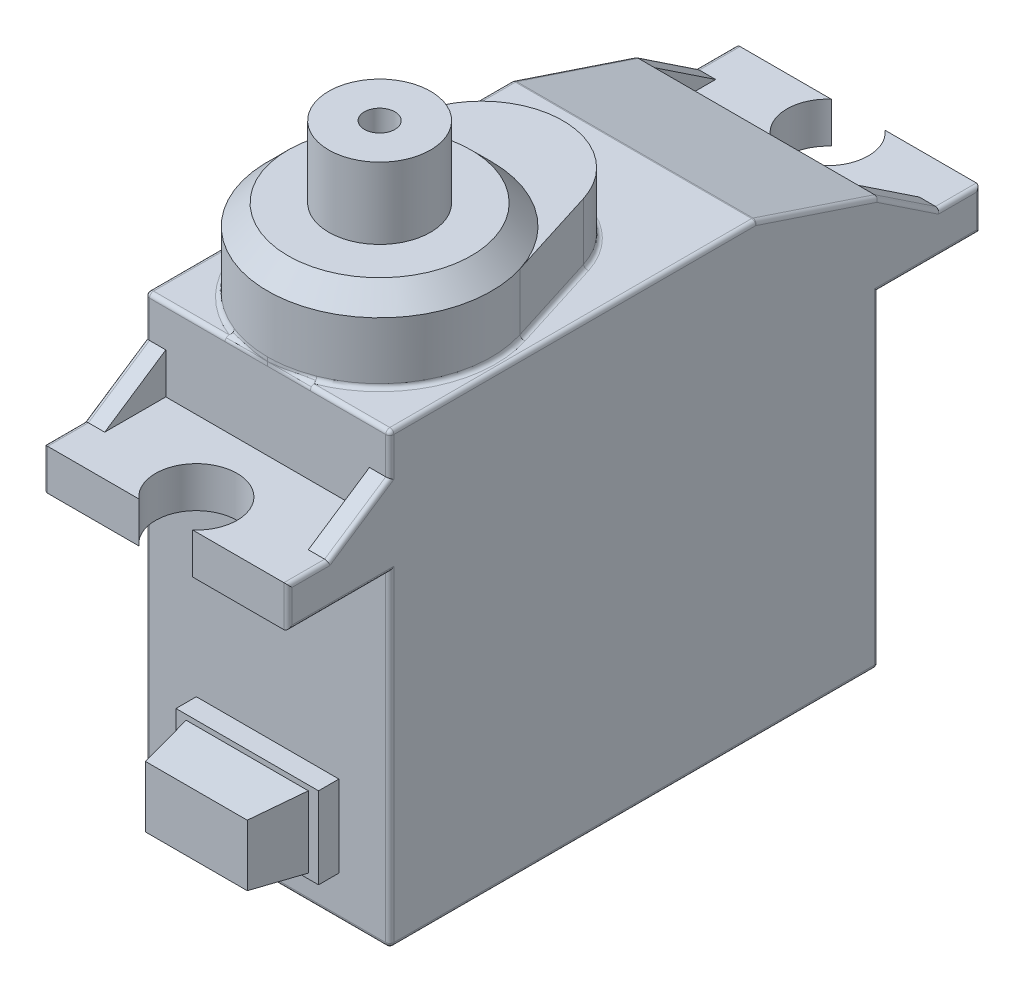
ISO-10303-21;
HEADER;
FILE_DESCRIPTION(('STEP AP214'),'2;1');
FILE_NAME('part.step','',(''),(''),'','','');
FILE_SCHEMA(('AUTOMOTIVE_DESIGN { 1 0 10303 214 1 1 1 1 }'));
ENDSEC;
DATA;
#1=APPLICATION_CONTEXT('core data for automotive mechanical design processes');
#2=APPLICATION_PROTOCOL_DEFINITION('international standard','automotive_design',2000,#1);
#3=PRODUCT_CONTEXT('',#1,'mechanical');
#4=PRODUCT('Part','Part','',(#3));
#5=PRODUCT_RELATED_PRODUCT_CATEGORY('part','',(#4));
#6=PRODUCT_DEFINITION_FORMATION('','',#4);
#7=PRODUCT_DEFINITION_CONTEXT('part definition',#1,'design');
#8=PRODUCT_DEFINITION('design','',#6,#7);
#9=PRODUCT_DEFINITION_SHAPE('','',#8);
#10=(LENGTH_UNIT() NAMED_UNIT(*) SI_UNIT(.MILLI.,.METRE.));
#11=(NAMED_UNIT(*) PLANE_ANGLE_UNIT() SI_UNIT($,.RADIAN.));
#12=(NAMED_UNIT(*) SI_UNIT($,.STERADIAN.) SOLID_ANGLE_UNIT());
#13=UNCERTAINTY_MEASURE_WITH_UNIT(LENGTH_MEASURE(1.E-05),#10,'distance_accuracy_value','');
#14=(GEOMETRIC_REPRESENTATION_CONTEXT(3) GLOBAL_UNCERTAINTY_ASSIGNED_CONTEXT((#13)) GLOBAL_UNIT_ASSIGNED_CONTEXT((#10,
#11,#12)) REPRESENTATION_CONTEXT('',''));
#15=CARTESIAN_POINT('',(0.,0.,0.));
#16=DIRECTION('',(0.,0.,1.));
#17=DIRECTION('',(1.,0.,0.));
#18=AXIS2_PLACEMENT_3D('',#15,#16,#17);
#19=CARTESIAN_POINT('',(6.,16.,12.));
#20=DIRECTION('',(0.,0.,-1.));
#21=DIRECTION('',(-1.,0.,0.));
#22=AXIS2_PLACEMENT_3D('',#19,#20,#21);
#23=PLANE('',#22);
#24=DIRECTION('',(1.,0.,0.));
#25=VECTOR('',#24,1.);
#26=CARTESIAN_POINT('',(6.,0.199999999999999,12.));
#27=LINE('',#26,#25);
#28=CARTESIAN_POINT('',(-5.8,0.199999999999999,12.));
#29=VERTEX_POINT('',#28);
#30=CARTESIAN_POINT('',(5.8,0.199999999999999,12.));
#31=VERTEX_POINT('',#30);
#32=EDGE_CURVE('E1165',#29,#31,#27,.T.);
#33=ORIENTED_EDGE('',*,*,#32,.T.);
#34=DIRECTION('',(0.,-1.,0.));
#35=VECTOR('',#34,1.);
#36=CARTESIAN_POINT('',(5.8,16.,12.));
#37=LINE('',#36,#35);
#38=CARTESIAN_POINT('',(5.8,16.,12.));
#39=VERTEX_POINT('',#38);
#40=EDGE_CURVE('E1167',#31,#39,#37,.F.);
#41=ORIENTED_EDGE('',*,*,#40,.T.);
#42=DIRECTION('',(1.,0.,0.));
#43=VECTOR('',#42,1.);
#44=CARTESIAN_POINT('',(6.,16.,12.));
#45=LINE('',#44,#43);
#46=CARTESIAN_POINT('',(-5.8,16.,12.));
#47=VERTEX_POINT('',#46);
#48=EDGE_CURVE('E1145',#47,#39,#45,.T.);
#49=ORIENTED_EDGE('',*,*,#48,.F.);
#50=DIRECTION('',(0.,-1.,0.));
#51=VECTOR('',#50,1.);
#52=CARTESIAN_POINT('',(-5.8,16.,12.));
#53=LINE('',#52,#51);
#54=EDGE_CURVE('E1163',#47,#29,#53,.T.);
#55=ORIENTED_EDGE('',*,*,#54,.T.);
#56=EDGE_LOOP('',(#33,#41,#49,#55));
#57=FACE_BOUND('',#56,.T.);
#58=DIRECTION('',(1.,0.,0.));
#59=VECTOR('',#58,1.);
#60=CARTESIAN_POINT('',(3.5,2.,12.));
#61=LINE('',#60,#59);
#62=CARTESIAN_POINT('',(-3.5,2.,12.));
#63=VERTEX_POINT('',#62);
#64=CARTESIAN_POINT('',(3.5,2.,12.));
#65=VERTEX_POINT('',#64);
#66=EDGE_CURVE('E1443',#63,#65,#61,.T.);
#67=ORIENTED_EDGE('',*,*,#66,.F.);
#68=DIRECTION('',(0.,-1.,0.));
#69=VECTOR('',#68,1.);
#70=CARTESIAN_POINT('',(-3.5,2.,12.));
#71=LINE('',#70,#69);
#72=CARTESIAN_POINT('',(-3.5,6.,12.));
#73=VERTEX_POINT('',#72);
#74=EDGE_CURVE('E2098',#73,#63,#71,.T.);
#75=ORIENTED_EDGE('',*,*,#74,.F.);
#76=DIRECTION('',(-1.,0.,0.));
#77=VECTOR('',#76,1.);
#78=CARTESIAN_POINT('',(3.5,6.,12.));
#79=LINE('',#78,#77);
#80=CARTESIAN_POINT('',(3.5,6.,12.));
#81=VERTEX_POINT('',#80);
#82=EDGE_CURVE('E2128',#81,#73,#79,.T.);
#83=ORIENTED_EDGE('',*,*,#82,.F.);
#84=DIRECTION('',(0.,1.,0.));
#85=VECTOR('',#84,1.);
#86=CARTESIAN_POINT('',(3.5,2.,12.));
#87=LINE('',#86,#85);
#88=EDGE_CURVE('E2131',#65,#81,#87,.T.);
#89=ORIENTED_EDGE('',*,*,#88,.F.);
#90=EDGE_LOOP('',(#67,#75,#83,#89));
#91=FACE_BOUND('',#90,.T.);
#92=ADVANCED_FACE('F45',(#57,#91),#23,.F.);
#93=CARTESIAN_POINT('',(0.,26.,6.5));
#94=DIRECTION('',(0.,1.,0.));
#95=DIRECTION('',(0.,0.,1.));
#96=AXIS2_PLACEMENT_3D('',#93,#94,#95);
#97=PLANE('',#96);
#98=CARTESIAN_POINT('',(0.,26.,6.5));
#99=DIRECTION('',(0.,1.,0.));
#100=DIRECTION('',(0.,0.,1.));
#101=AXIS2_PLACEMENT_3D('',#98,#99,#100);
#102=CIRCLE('',#101,4.5);
#103=CARTESIAN_POINT('',(0.,26.,11.));
#104=VERTEX_POINT('',#103);
#105=EDGE_CURVE('E1429',#104,#104,#102,.T.);
#106=ORIENTED_EDGE('',*,*,#105,.T.);
#107=EDGE_LOOP('',(#106));
#108=FACE_BOUND('',#107,.T.);
#109=CARTESIAN_POINT('',(0.,26.,6.5));
#110=DIRECTION('',(0.,1.,0.));
#111=DIRECTION('',(0.,0.,1.));
#112=AXIS2_PLACEMENT_3D('',#109,#110,#111);
#113=CIRCLE('',#112,2.5);
#114=CARTESIAN_POINT('',(0.,26.,9.));
#115=VERTEX_POINT('',#114);
#116=EDGE_CURVE('E1408',#115,#115,#113,.T.);
#117=ORIENTED_EDGE('',*,*,#116,.F.);
#118=EDGE_LOOP('',(#117));
#119=FACE_BOUND('',#118,.T.);
#120=ADVANCED_FACE('F1015',(#108,#119),#97,.T.);
#121=CARTESIAN_POINT('',(-6.,18.,-12.));
#122=DIRECTION('',(0.,1.,0.));
#123=DIRECTION('',(0.,0.,1.));
#124=AXIS2_PLACEMENT_3D('',#121,#122,#123);
#125=PLANE('',#124);
#126=DIRECTION('',(1.,0.,0.));
#127=VECTOR('',#126,1.);
#128=CARTESIAN_POINT('',(5.,18.,-15.));
#129=LINE('',#128,#127);
#130=CARTESIAN_POINT('',(5.,18.,-15.));
#131=VERTEX_POINT('',#130);
#132=CARTESIAN_POINT('',(5.8,18.,-15.));
#133=VERTEX_POINT('',#132);
#134=EDGE_CURVE('E1359',#131,#133,#129,.T.);
#135=ORIENTED_EDGE('',*,*,#134,.T.);
#136=DIRECTION('',(0.,0.,1.));
#137=VECTOR('',#136,1.);
#138=CARTESIAN_POINT('',(5.8,18.,-17.));
#139=LINE('',#138,#137);
#140=CARTESIAN_POINT('',(5.8,18.,-17.));
#141=VERTEX_POINT('',#140);
#142=EDGE_CURVE('E1136',#133,#141,#139,.F.);
#143=ORIENTED_EDGE('',*,*,#142,.T.);
#144=DIRECTION('',(1.,0.,0.));
#145=VECTOR('',#144,1.);
#146=CARTESIAN_POINT('',(-6.,18.,-17.));
#147=LINE('',#146,#145);
#148=CARTESIAN_POINT('',(1.32287565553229,18.,-17.));
#149=VERTEX_POINT('',#148);
#150=EDGE_CURVE('E1321',#149,#141,#147,.T.);
#151=ORIENTED_EDGE('',*,*,#150,.F.);
#152=CARTESIAN_POINT('',(0.,18.,-15.5));
#153=DIRECTION('',(0.,-1.,0.));
#154=DIRECTION('',(0.,0.,-1.));
#155=AXIS2_PLACEMENT_3D('',#152,#153,#154);
#156=CIRCLE('',#155,2.);
#157=CARTESIAN_POINT('',(-1.32287565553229,18.,-17.));
#158=VERTEX_POINT('',#157);
#159=EDGE_CURVE('E1319',#149,#158,#156,.T.);
#160=ORIENTED_EDGE('',*,*,#159,.T.);
#161=CARTESIAN_POINT('',(-5.8,18.,-17.));
#162=VERTEX_POINT('',#161);
#163=EDGE_CURVE('E1313',#162,#158,#147,.T.);
#164=ORIENTED_EDGE('',*,*,#163,.F.);
#165=DIRECTION('',(0.,0.,1.));
#166=VECTOR('',#165,1.);
#167=CARTESIAN_POINT('',(-5.8,18.,-15.));
#168=LINE('',#167,#166);
#169=CARTESIAN_POINT('',(-5.8,18.,-15.));
#170=VERTEX_POINT('',#169);
#171=EDGE_CURVE('E1134',#162,#170,#168,.T.);
#172=ORIENTED_EDGE('',*,*,#171,.T.);
#173=DIRECTION('',(-1.,0.,0.));
#174=VECTOR('',#173,1.);
#175=CARTESIAN_POINT('',(-5.,18.,-15.));
#176=LINE('',#175,#174);
#177=CARTESIAN_POINT('',(-5.,18.,-15.));
#178=VERTEX_POINT('',#177);
#179=EDGE_CURVE('E1371',#178,#170,#176,.T.);
#180=ORIENTED_EDGE('',*,*,#179,.F.);
#181=DIRECTION('',(0.,0.,1.));
#182=VECTOR('',#181,1.);
#183=CARTESIAN_POINT('',(-5.,18.,-12.));
#184=LINE('',#183,#182);
#185=CARTESIAN_POINT('',(-5.,18.,-12.));
#186=VERTEX_POINT('',#185);
#187=EDGE_CURVE('E1373',#178,#186,#184,.T.);
#188=ORIENTED_EDGE('',*,*,#187,.T.);
#189=DIRECTION('',(1.,0.,0.));
#190=VECTOR('',#189,1.);
#191=CARTESIAN_POINT('',(-6.,18.,-12.));
#192=LINE('',#191,#190);
#193=CARTESIAN_POINT('',(5.,18.,-12.));
#194=VERTEX_POINT('',#193);
#195=EDGE_CURVE('E1320',#186,#194,#192,.T.);
#196=ORIENTED_EDGE('',*,*,#195,.T.);
#197=DIRECTION('',(0.,0.,1.));
#198=VECTOR('',#197,1.);
#199=CARTESIAN_POINT('',(5.,18.,-12.));
#200=LINE('',#199,#198);
#201=EDGE_CURVE('E1365',#131,#194,#200,.T.);
#202=ORIENTED_EDGE('',*,*,#201,.F.);
#203=EDGE_LOOP('',(#135,#143,#151,#160,#164,#172,#180,#188,#196,#202));
#204=FACE_BOUND('',#203,.T.);
#205=ADVANCED_FACE('F1011',(#204),#125,.T.);
#206=CARTESIAN_POINT('',(-6.,16.,12.));
#207=DIRECTION('',(0.,-1.,0.));
#208=DIRECTION('',(0.,0.,-1.));
#209=AXIS2_PLACEMENT_3D('',#206,#207,#208);
#210=PLANE('',#209);
#211=DIRECTION('',(1.,0.,0.));
#212=VECTOR('',#211,1.);
#213=CARTESIAN_POINT('',(-6.,16.,-17.));
#214=LINE('',#213,#212);
#215=CARTESIAN_POINT('',(1.3228756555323,16.,-17.));
#216=VERTEX_POINT('',#215);
#217=CARTESIAN_POINT('',(5.8,16.,-17.));
#218=VERTEX_POINT('',#217);
#219=EDGE_CURVE('E1337',#216,#218,#214,.T.);
#220=ORIENTED_EDGE('',*,*,#219,.T.);
#221=DIRECTION('',(0.,0.,-1.));
#222=VECTOR('',#221,1.);
#223=CARTESIAN_POINT('',(5.8,16.,-12.));
#224=LINE('',#223,#222);
#225=CARTESIAN_POINT('',(5.8,16.,-12.));
#226=VERTEX_POINT('',#225);
#227=EDGE_CURVE('E1223',#218,#226,#224,.F.);
#228=ORIENTED_EDGE('',*,*,#227,.T.);
#229=DIRECTION('',(-1.,0.,0.));
#230=VECTOR('',#229,1.);
#231=CARTESIAN_POINT('',(6.,16.,-12.));
#232=LINE('',#231,#230);
#233=CARTESIAN_POINT('',(-5.8,16.,-12.));
#234=VERTEX_POINT('',#233);
#235=EDGE_CURVE('E1141',#226,#234,#232,.T.);
#236=ORIENTED_EDGE('',*,*,#235,.T.);
#237=DIRECTION('',(0.,0.,-1.));
#238=VECTOR('',#237,1.);
#239=CARTESIAN_POINT('',(-5.8,16.,-17.));
#240=LINE('',#239,#238);
#241=CARTESIAN_POINT('',(-5.8,16.,-17.));
#242=VERTEX_POINT('',#241);
#243=EDGE_CURVE('E1140',#234,#242,#240,.T.);
#244=ORIENTED_EDGE('',*,*,#243,.T.);
#245=CARTESIAN_POINT('',(-1.32287565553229,16.,-17.));
#246=VERTEX_POINT('',#245);
#247=EDGE_CURVE('E1151',#242,#246,#214,.T.);
#248=ORIENTED_EDGE('',*,*,#247,.T.);
#249=CARTESIAN_POINT('',(0.,16.,-15.5));
#250=DIRECTION('',(0.,-1.,0.));
#251=DIRECTION('',(0.,0.,-1.));
#252=AXIS2_PLACEMENT_3D('',#249,#250,#251);
#253=CIRCLE('',#252,2.);
#254=EDGE_CURVE('E1386',#246,#216,#253,.F.);
#255=ORIENTED_EDGE('',*,*,#254,.T.);
#256=EDGE_LOOP('',(#220,#228,#236,#244,#248,#255));
#257=FACE_BOUND('',#256,.T.);
#258=ADVANCED_FACE('F1014',(#257),#210,.T.);
#259=CARTESIAN_POINT('',(-6.,18.,-17.));
#260=DIRECTION('',(0.,0.,-1.));
#261=DIRECTION('',(-1.,0.,0.));
#262=AXIS2_PLACEMENT_3D('',#259,#260,#261);
#263=PLANE('',#262);
#264=ORIENTED_EDGE('',*,*,#247,.F.);
#265=DIRECTION('',(0.,1.,0.));
#266=VECTOR('',#265,1.);
#267=CARTESIAN_POINT('',(-5.8,18.,-17.));
#268=LINE('',#267,#266);
#269=EDGE_CURVE('E487',#242,#162,#268,.T.);
#270=ORIENTED_EDGE('',*,*,#269,.T.);
#271=ORIENTED_EDGE('',*,*,#163,.T.);
#272=DIRECTION('',(0.,1.,0.));
#273=VECTOR('',#272,1.);
#274=CARTESIAN_POINT('',(-1.32287565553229,-2.50000000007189E-05,-17.));
#275=LINE('',#274,#273);
#276=EDGE_CURVE('E1413',#158,#246,#275,.F.);
#277=ORIENTED_EDGE('',*,*,#276,.T.);
#278=EDGE_LOOP('',(#264,#270,#271,#277));
#279=FACE_BOUND('',#278,.T.);
#280=ADVANCED_FACE('F1017',(#279),#263,.T.);
#281=ORIENTED_EDGE('',*,*,#150,.T.);
#282=DIRECTION('',(0.,1.,0.));
#283=VECTOR('',#282,1.);
#284=CARTESIAN_POINT('',(5.8,16.,-17.));
#285=LINE('',#284,#283);
#286=EDGE_CURVE('E1138',#141,#218,#285,.F.);
#287=ORIENTED_EDGE('',*,*,#286,.T.);
#288=ORIENTED_EDGE('',*,*,#219,.F.);
#289=DIRECTION('',(0.,1.,0.));
#290=VECTOR('',#289,1.);
#291=CARTESIAN_POINT('',(1.3228756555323,-2.50000000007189E-05,-17.));
#292=LINE('',#291,#290);
#293=EDGE_CURVE('E1586',#216,#149,#292,.T.);
#294=ORIENTED_EDGE('',*,*,#293,.T.);
#295=EDGE_LOOP('',(#281,#287,#288,#294));
#296=FACE_BOUND('',#295,.T.);
#297=ADVANCED_FACE('F1020',(#296),#263,.T.);
#298=CARTESIAN_POINT('',(-6.,16.,17.));
#299=DIRECTION('',(0.,0.,1.));
#300=DIRECTION('',(1.,0.,0.));
#301=AXIS2_PLACEMENT_3D('',#298,#299,#300);
#302=PLANE('',#301);
#303=DIRECTION('',(1.,0.,0.));
#304=VECTOR('',#303,1.);
#305=CARTESIAN_POINT('',(-6.,16.,17.));
#306=LINE('',#305,#304);
#307=CARTESIAN_POINT('',(1.3228756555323,16.,17.));
#308=VERTEX_POINT('',#307);
#309=CARTESIAN_POINT('',(5.80000000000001,16.,17.));
#310=VERTEX_POINT('',#309);
#311=EDGE_CURVE('E1333',#308,#310,#306,.T.);
#312=ORIENTED_EDGE('',*,*,#311,.T.);
#313=DIRECTION('',(0.,-1.,0.));
#314=VECTOR('',#313,1.);
#315=CARTESIAN_POINT('',(5.8,18.,17.));
#316=LINE('',#315,#314);
#317=CARTESIAN_POINT('',(5.8,18.,17.));
#318=VERTEX_POINT('',#317);
#319=EDGE_CURVE('E1173',#310,#318,#316,.F.);
#320=ORIENTED_EDGE('',*,*,#319,.T.);
#321=DIRECTION('',(1.,0.,0.));
#322=VECTOR('',#321,1.);
#323=CARTESIAN_POINT('',(-6.,18.,17.));
#324=LINE('',#323,#322);
#325=CARTESIAN_POINT('',(1.3228756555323,18.,17.));
#326=VERTEX_POINT('',#325);
#327=EDGE_CURVE('E1330',#326,#318,#324,.T.);
#328=ORIENTED_EDGE('',*,*,#327,.F.);
#329=DIRECTION('',(0.,1.,0.));
#330=VECTOR('',#329,1.);
#331=CARTESIAN_POINT('',(1.3228756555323,-2.50000000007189E-05,17.));
#332=LINE('',#331,#330);
#333=EDGE_CURVE('E1562',#308,#326,#332,.T.);
#334=ORIENTED_EDGE('',*,*,#333,.F.);
#335=EDGE_LOOP('',(#312,#320,#328,#334));
#336=FACE_BOUND('',#335,.T.);
#337=ADVANCED_FACE('F1543',(#336),#302,.T.);
#338=CARTESIAN_POINT('',(-6.,18.,17.));
#339=DIRECTION('',(0.,1.,0.));
#340=DIRECTION('',(0.,0.,1.));
#341=AXIS2_PLACEMENT_3D('',#338,#339,#340);
#342=PLANE('',#341);
#343=ORIENTED_EDGE('',*,*,#327,.T.);
#344=DIRECTION('',(0.,0.,1.));
#345=VECTOR('',#344,1.);
#346=CARTESIAN_POINT('',(5.8,18.,15.));
#347=LINE('',#346,#345);
#348=CARTESIAN_POINT('',(5.8,18.,15.));
#349=VERTEX_POINT('',#348);
#350=EDGE_CURVE('E1177',#318,#349,#347,.F.);
#351=ORIENTED_EDGE('',*,*,#350,.T.);
#352=DIRECTION('',(1.,0.,0.));
#353=VECTOR('',#352,1.);
#354=CARTESIAN_POINT('',(5.,18.,15.));
#355=LINE('',#354,#353);
#356=CARTESIAN_POINT('',(5.,18.,15.));
#357=VERTEX_POINT('',#356);
#358=EDGE_CURVE('E1081',#357,#349,#355,.T.);
#359=ORIENTED_EDGE('',*,*,#358,.F.);
#360=DIRECTION('',(0.,0.,-1.));
#361=VECTOR('',#360,1.);
#362=CARTESIAN_POINT('',(5.,18.,12.));
#363=LINE('',#362,#361);
#364=CARTESIAN_POINT('',(5.,18.,12.));
#365=VERTEX_POINT('',#364);
#366=EDGE_CURVE('E1082',#357,#365,#363,.T.);
#367=ORIENTED_EDGE('',*,*,#366,.T.);
#368=DIRECTION('',(1.,0.,0.));
#369=VECTOR('',#368,1.);
#370=CARTESIAN_POINT('',(-6.,18.,12.));
#371=LINE('',#370,#369);
#372=CARTESIAN_POINT('',(-5.,18.,12.));
#373=VERTEX_POINT('',#372);
#374=EDGE_CURVE('E1328',#373,#365,#371,.T.);
#375=ORIENTED_EDGE('',*,*,#374,.F.);
#376=DIRECTION('',(0.,0.,-1.));
#377=VECTOR('',#376,1.);
#378=CARTESIAN_POINT('',(-5.,18.,12.));
#379=LINE('',#378,#377);
#380=CARTESIAN_POINT('',(-5.,18.,15.));
#381=VERTEX_POINT('',#380);
#382=EDGE_CURVE('E1352',#381,#373,#379,.T.);
#383=ORIENTED_EDGE('',*,*,#382,.F.);
#384=DIRECTION('',(-1.,0.,0.));
#385=VECTOR('',#384,1.);
#386=CARTESIAN_POINT('',(-5.,18.,15.));
#387=LINE('',#386,#385);
#388=CARTESIAN_POINT('',(-5.8,18.,15.));
#389=VERTEX_POINT('',#388);
#390=EDGE_CURVE('E1344',#381,#389,#387,.T.);
#391=ORIENTED_EDGE('',*,*,#390,.T.);
#392=DIRECTION('',(0.,0.,1.));
#393=VECTOR('',#392,1.);
#394=CARTESIAN_POINT('',(-5.8,18.,17.));
#395=LINE('',#394,#393);
#396=CARTESIAN_POINT('',(-5.8,18.,17.));
#397=VERTEX_POINT('',#396);
#398=EDGE_CURVE('E1175',#389,#397,#395,.T.);
#399=ORIENTED_EDGE('',*,*,#398,.T.);
#400=CARTESIAN_POINT('',(-1.32287565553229,18.,17.));
#401=VERTEX_POINT('',#400);
#402=EDGE_CURVE('E1331',#397,#401,#324,.T.);
#403=ORIENTED_EDGE('',*,*,#402,.T.);
#404=CARTESIAN_POINT('',(0.,18.,15.5));
#405=DIRECTION('',(0.,1.,0.));
#406=DIRECTION('',(0.,0.,1.));
#407=AXIS2_PLACEMENT_3D('',#404,#405,#406);
#408=CIRCLE('',#407,2.);
#409=EDGE_CURVE('E1383',#326,#401,#408,.T.);
#410=ORIENTED_EDGE('',*,*,#409,.F.);
#411=EDGE_LOOP('',(#343,#351,#359,#367,#375,#383,#391,#399,#403,#410));
#412=FACE_BOUND('',#411,.T.);
#413=ADVANCED_FACE('F994',(#412),#342,.T.);
#414=CARTESIAN_POINT('',(-6.,18.,12.));
#415=DIRECTION('',(0.,0.,1.));
#416=DIRECTION('',(1.,0.,0.));
#417=AXIS2_PLACEMENT_3D('',#414,#415,#416);
#418=PLANE('',#417);
#419=DIRECTION('',(1.,0.,0.));
#420=VECTOR('',#419,1.);
#421=CARTESIAN_POINT('',(5.,20.,12.));
#422=LINE('',#421,#420);
#423=CARTESIAN_POINT('',(5.,20.,12.));
#424=VERTEX_POINT('',#423);
#425=CARTESIAN_POINT('',(5.8,20.,12.));
#426=VERTEX_POINT('',#425);
#427=EDGE_CURVE('E1072',#424,#426,#422,.T.);
#428=ORIENTED_EDGE('',*,*,#427,.T.);
#429=DIRECTION('',(0.,-1.,0.));
#430=VECTOR('',#429,1.);
#431=CARTESIAN_POINT('',(5.8,22.,12.));
#432=LINE('',#431,#430);
#433=CARTESIAN_POINT('',(5.8,21.8,12.));
#434=VERTEX_POINT('',#433);
#435=EDGE_CURVE('E1075',#426,#434,#432,.F.);
#436=ORIENTED_EDGE('',*,*,#435,.T.);
#437=DIRECTION('',(1.,0.,0.));
#438=VECTOR('',#437,1.);
#439=CARTESIAN_POINT('',(-6.,21.8,12.));
#440=LINE('',#439,#438);
#441=CARTESIAN_POINT('',(2.097617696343,21.8,12.));
#442=VERTEX_POINT('',#441);
#443=EDGE_CURVE('E981',#434,#442,#440,.F.);
#444=ORIENTED_EDGE('',*,*,#443,.T.);
#445=CARTESIAN_POINT('',(1.8474805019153E-13,21.8,12.));
#446=CARTESIAN_POINT('',(0.174801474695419,21.8,12.));
#447=CARTESIAN_POINT('',(0.349602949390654,21.8,12.));
#448=CARTESIAN_POINT('',(0.699205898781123,21.8,12.));
#449=CARTESIAN_POINT('',(0.874007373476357,21.8,12.));
#450=CARTESIAN_POINT('',(1.39841179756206,21.8,12.));
#451=CARTESIAN_POINT('',(1.74801474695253,21.8,12.));
#452=CARTESIAN_POINT('',(2.097617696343,21.8,12.));
#453=B_SPLINE_CURVE_WITH_KNOTS('',3,(#445,#446,#447,#448,#449,#450,#451,#452),.UNSPECIFIED.,.F.,
.F.,(4,2,2,4),(0.,0.25,0.5,1.),.UNSPECIFIED.);
#454=CARTESIAN_POINT('',(1.8474805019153E-13,21.8,12.));
#455=VERTEX_POINT('',#454);
#456=EDGE_CURVE('E841',#455,#442,#453,.T.);
#457=ORIENTED_EDGE('',*,*,#456,.F.);
#458=CARTESIAN_POINT('',(-2.09761769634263,21.8,12.));
#459=CARTESIAN_POINT('',(-1.74801474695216,21.8,12.));
#460=CARTESIAN_POINT('',(-1.39841179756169,21.8,12.));
#461=CARTESIAN_POINT('',(-0.874007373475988,21.8,12.));
#462=CARTESIAN_POINT('',(-0.699205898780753,21.8,12.));
#463=CARTESIAN_POINT('',(-0.349602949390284,21.8,12.));
#464=CARTESIAN_POINT('',(-0.17480147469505,21.8,12.));
#465=CARTESIAN_POINT('',(1.8474805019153E-13,21.8,12.));
#466=B_SPLINE_CURVE_WITH_KNOTS('',3,(#458,#459,#460,#461,#462,#463,#464,#465),.UNSPECIFIED.,.F.,
.F.,(4,2,2,4),(0.,0.5,0.75,1.),.UNSPECIFIED.);
#467=CARTESIAN_POINT('',(-2.09761769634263,21.8,12.));
#468=VERTEX_POINT('',#467);
#469=EDGE_CURVE('E760',#468,#455,#466,.T.);
#470=ORIENTED_EDGE('',*,*,#469,.F.);
#471=DIRECTION('',(1.,0.,0.));
#472=VECTOR('',#471,1.);
#473=CARTESIAN_POINT('',(-6.,21.8,12.));
#474=LINE('',#473,#472);
#475=CARTESIAN_POINT('',(-5.8,21.8,12.));
#476=VERTEX_POINT('',#475);
#477=EDGE_CURVE('E962',#468,#476,#474,.F.);
#478=ORIENTED_EDGE('',*,*,#477,.T.);
#479=DIRECTION('',(0.,-1.,0.));
#480=VECTOR('',#479,1.);
#481=CARTESIAN_POINT('',(-5.8,20.,12.));
#482=LINE('',#481,#480);
#483=CARTESIAN_POINT('',(-5.8,20.,12.));
#484=VERTEX_POINT('',#483);
#485=EDGE_CURVE('E965',#476,#484,#482,.T.);
#486=ORIENTED_EDGE('',*,*,#485,.T.);
#487=DIRECTION('',(-1.,0.,0.));
#488=VECTOR('',#487,1.);
#489=CARTESIAN_POINT('',(-5.,20.,12.));
#490=LINE('',#489,#488);
#491=CARTESIAN_POINT('',(-5.,20.,12.));
#492=VERTEX_POINT('',#491);
#493=EDGE_CURVE('E1343',#492,#484,#490,.T.);
#494=ORIENTED_EDGE('',*,*,#493,.F.);
#495=DIRECTION('',(0.,1.,0.));
#496=VECTOR('',#495,1.);
#497=CARTESIAN_POINT('',(-5.,20.,12.));
#498=LINE('',#497,#496);
#499=EDGE_CURVE('E1355',#373,#492,#498,.T.);
#500=ORIENTED_EDGE('',*,*,#499,.F.);
#501=ORIENTED_EDGE('',*,*,#374,.T.);
#502=DIRECTION('',(0.,1.,0.));
#503=VECTOR('',#502,1.);
#504=CARTESIAN_POINT('',(5.,20.,12.));
#505=LINE('',#504,#503);
#506=EDGE_CURVE('E1078',#365,#424,#505,.T.);
#507=ORIENTED_EDGE('',*,*,#506,.T.);
#508=EDGE_LOOP('',(#428,#436,#444,#457,#470,#478,#486,#494,#500,#501,#507));
#509=FACE_BOUND('',#508,.T.);
#510=ADVANCED_FACE('F983',(#509),#418,.T.);
#511=CARTESIAN_POINT('',(6.,16.,-12.));
#512=DIRECTION('',(0.,0.,1.));
#513=DIRECTION('',(1.,0.,0.));
#514=AXIS2_PLACEMENT_3D('',#511,#512,#513);
#515=PLANE('',#514);
#516=ORIENTED_EDGE('',*,*,#235,.F.);
#517=DIRECTION('',(0.,-1.,0.));
#518=VECTOR('',#517,1.);
#519=CARTESIAN_POINT('',(5.8,16.,-12.));
#520=LINE('',#519,#518);
#521=CARTESIAN_POINT('',(5.8,0.199999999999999,-12.));
#522=VERTEX_POINT('',#521);
#523=EDGE_CURVE('E1161',#226,#522,#520,.T.);
#524=ORIENTED_EDGE('',*,*,#523,.T.);
#525=DIRECTION('',(-1.,0.,0.));
#526=VECTOR('',#525,1.);
#527=CARTESIAN_POINT('',(6.,0.199999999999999,-12.));
#528=LINE('',#527,#526);
#529=CARTESIAN_POINT('',(-5.8,0.199999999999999,-12.));
#530=VERTEX_POINT('',#529);
#531=EDGE_CURVE('E1228',#522,#530,#528,.T.);
#532=ORIENTED_EDGE('',*,*,#531,.T.);
#533=DIRECTION('',(0.,-1.,0.));
#534=VECTOR('',#533,1.);
#535=CARTESIAN_POINT('',(-5.8,16.,-12.));
#536=LINE('',#535,#534);
#537=EDGE_CURVE('E1224',#530,#234,#536,.F.);
#538=ORIENTED_EDGE('',*,*,#537,.T.);
#539=EDGE_LOOP('',(#516,#524,#532,#538));
#540=FACE_BOUND('',#539,.T.);
#541=ADVANCED_FACE('F993',(#540),#515,.F.);
#542=CARTESIAN_POINT('',(-6.,16.,-12.));
#543=DIRECTION('',(1.,0.,0.));
#544=DIRECTION('',(0.,0.,-1.));
#545=AXIS2_PLACEMENT_3D('',#542,#543,#544);
#546=PLANE('',#545);
#547=DIRECTION('',(0.,0.,-1.));
#548=VECTOR('',#547,1.);
#549=CARTESIAN_POINT('',(-6.,16.2,17.));
#550=LINE('',#549,#548);
#551=CARTESIAN_POINT('',(-6.,16.2,11.8));
#552=VERTEX_POINT('',#551);
#553=CARTESIAN_POINT('',(-6.,16.2,16.8));
#554=VERTEX_POINT('',#553);
#555=EDGE_CURVE('E67',#552,#554,#550,.F.);
#556=ORIENTED_EDGE('',*,*,#555,.T.);
#557=DIRECTION('',(0.,-1.,0.));
#558=VECTOR('',#557,1.);
#559=CARTESIAN_POINT('',(-6.,18.,16.8));
#560=LINE('',#559,#558);
#561=CARTESIAN_POINT('',(-6.,17.8,16.8));
#562=VERTEX_POINT('',#561);
#563=EDGE_CURVE('E482',#554,#562,#560,.F.);
#564=ORIENTED_EDGE('',*,*,#563,.T.);
#565=DIRECTION('',(0.,0.,1.));
#566=VECTOR('',#565,1.);
#567=CARTESIAN_POINT('',(-6.,17.8,15.));
#568=LINE('',#567,#566);
#569=CARTESIAN_POINT('',(-6.,17.8,14.9394448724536));
#570=VERTEX_POINT('',#569);
#571=EDGE_CURVE('E1191',#562,#570,#568,.F.);
#572=ORIENTED_EDGE('',*,*,#571,.T.);
#573=DIRECTION('',(0.,-0.554700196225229,0.832050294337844));
#574=VECTOR('',#573,1.);
#575=CARTESIAN_POINT('',(-6.,29.6797437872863,-2.88017080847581));
#576=LINE('',#575,#574);
#577=CARTESIAN_POINT('',(-6.,19.8929632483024,11.8));
#578=VERTEX_POINT('',#577);
#579=EDGE_CURVE('E1193',#570,#578,#576,.F.);
#580=ORIENTED_EDGE('',*,*,#579,.T.);
#581=DIRECTION('',(0.,-1.,0.));
#582=VECTOR('',#581,1.);
#583=CARTESIAN_POINT('',(-6.,22.,11.8));
#584=LINE('',#583,#582);
#585=CARTESIAN_POINT('',(-6.,21.8,11.8));
#586=VERTEX_POINT('',#585);
#587=EDGE_CURVE('E1195',#578,#586,#584,.F.);
#588=ORIENTED_EDGE('',*,*,#587,.T.);
#589=DIRECTION('',(0.,0.,1.));
#590=VECTOR('',#589,1.);
#591=CARTESIAN_POINT('',(-6.,21.8,-6.));
#592=LINE('',#591,#590);
#593=CARTESIAN_POINT('',(-6.,21.8,-5.96754446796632));
#594=VERTEX_POINT('',#593);
#595=EDGE_CURVE('E1197',#586,#594,#592,.F.);
#596=ORIENTED_EDGE('',*,*,#595,.T.);
#597=DIRECTION('',(0.,0.316227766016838,0.948683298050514));
#598=VECTOR('',#597,1.);
#599=CARTESIAN_POINT('',(-6.,19.8102633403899,-11.9367544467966));
#600=LINE('',#599,#598);
#601=CARTESIAN_POINT('',(-6.,19.8187330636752,-11.9113452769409));
#602=VERTEX_POINT('',#601);
#603=EDGE_CURVE('E1199',#594,#602,#600,.F.);
#604=ORIENTED_EDGE('',*,*,#603,.T.);
#605=DIRECTION('',(0.,-0.554700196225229,-0.832050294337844));
#606=VECTOR('',#605,1.);
#607=CARTESIAN_POINT('',(-6.,17.8335899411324,-14.889059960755));
#608=LINE('',#607,#606);
#609=CARTESIAN_POINT('',(-6.,17.8,-14.9394448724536));
#610=VERTEX_POINT('',#609);
#611=EDGE_CURVE('E1201',#602,#610,#608,.T.);
#612=ORIENTED_EDGE('',*,*,#611,.T.);
#613=DIRECTION('',(0.,0.,1.));
#614=VECTOR('',#613,1.);
#615=CARTESIAN_POINT('',(-6.,17.8,-17.));
#616=LINE('',#615,#614);
#617=CARTESIAN_POINT('',(-6.,17.8,-16.8));
#618=VERTEX_POINT('',#617);
#619=EDGE_CURVE('E1203',#610,#618,#616,.F.);
#620=ORIENTED_EDGE('',*,*,#619,.T.);
#621=DIRECTION('',(0.,1.,0.));
#622=VECTOR('',#621,1.);
#623=CARTESIAN_POINT('',(-6.,16.,-16.8));
#624=LINE('',#623,#622);
#625=CARTESIAN_POINT('',(-6.,16.2,-16.8));
#626=VERTEX_POINT('',#625);
#627=EDGE_CURVE('E1205',#618,#626,#624,.F.);
#628=ORIENTED_EDGE('',*,*,#627,.T.);
#629=DIRECTION('',(0.,0.,-1.));
#630=VECTOR('',#629,1.);
#631=CARTESIAN_POINT('',(-6.,16.2,-12.));
#632=LINE('',#631,#630);
#633=CARTESIAN_POINT('',(-6.,16.2,-11.8));
#634=VERTEX_POINT('',#633);
#635=EDGE_CURVE('E1207',#626,#634,#632,.F.);
#636=ORIENTED_EDGE('',*,*,#635,.T.);
#637=DIRECTION('',(0.,-1.,0.));
#638=VECTOR('',#637,1.);
#639=CARTESIAN_POINT('',(-6.,16.,-11.8));
#640=LINE('',#639,#638);
#641=CARTESIAN_POINT('',(-6.,0.199999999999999,-11.8));
#642=VERTEX_POINT('',#641);
#643=EDGE_CURVE('E453',#634,#642,#640,.T.);
#644=ORIENTED_EDGE('',*,*,#643,.T.);
#645=DIRECTION('',(0.,0.,1.));
#646=VECTOR('',#645,1.);
#647=CARTESIAN_POINT('',(-6.,0.199999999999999,-12.));
#648=LINE('',#647,#646);
#649=CARTESIAN_POINT('',(-6.,0.199999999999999,11.8));
#650=VERTEX_POINT('',#649);
#651=EDGE_CURVE('E446',#642,#650,#648,.T.);
#652=ORIENTED_EDGE('',*,*,#651,.T.);
#653=DIRECTION('',(0.,-1.,0.));
#654=VECTOR('',#653,1.);
#655=CARTESIAN_POINT('',(-6.,16.,11.8));
#656=LINE('',#655,#654);
#657=EDGE_CURVE('E450',#650,#552,#656,.F.);
#658=ORIENTED_EDGE('',*,*,#657,.T.);
#659=EDGE_LOOP('',(#556,#564,#572,#580,#588,#596,#604,#612,#620,#628,#636,#644,#652,#658));
#660=FACE_BOUND('',#659,.T.);
#661=ADVANCED_FACE('F448',(#660),#546,.F.);
#662=CARTESIAN_POINT('',(6.,16.,-12.));
#663=DIRECTION('',(-1.,0.,0.));
#664=DIRECTION('',(0.,0.,1.));
#665=AXIS2_PLACEMENT_3D('',#662,#663,#664);
#666=PLANE('',#665);
#667=DIRECTION('',(0.,-1.,0.));
#668=VECTOR('',#667,1.);
#669=CARTESIAN_POINT('',(6.,16.,16.8));
#670=LINE('',#669,#668);
#671=CARTESIAN_POINT('',(6.,17.8,16.8));
#672=VERTEX_POINT('',#671);
#673=CARTESIAN_POINT('',(6.,16.2,16.8));
#674=VERTEX_POINT('',#673);
#675=EDGE_CURVE('E1130',#672,#674,#670,.T.);
#676=ORIENTED_EDGE('',*,*,#675,.T.);
#677=DIRECTION('',(0.,0.,-1.));
#678=VECTOR('',#677,1.);
#679=CARTESIAN_POINT('',(6.,16.2,12.));
#680=LINE('',#679,#678);
#681=CARTESIAN_POINT('',(6.,16.2,11.8));
#682=VERTEX_POINT('',#681);
#683=EDGE_CURVE('E1132',#674,#682,#680,.T.);
#684=ORIENTED_EDGE('',*,*,#683,.T.);
#685=DIRECTION('',(0.,-1.,0.));
#686=VECTOR('',#685,1.);
#687=CARTESIAN_POINT('',(6.,16.,11.8));
#688=LINE('',#687,#686);
#689=CARTESIAN_POINT('',(6.,0.199999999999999,11.8));
#690=VERTEX_POINT('',#689);
#691=EDGE_CURVE('E1108',#682,#690,#688,.T.);
#692=ORIENTED_EDGE('',*,*,#691,.T.);
#693=DIRECTION('',(0.,0.,-1.));
#694=VECTOR('',#693,1.);
#695=CARTESIAN_POINT('',(6.,0.199999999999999,-12.));
#696=LINE('',#695,#694);
#697=CARTESIAN_POINT('',(6.,0.199999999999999,-11.8));
#698=VERTEX_POINT('',#697);
#699=EDGE_CURVE('E1106',#690,#698,#696,.T.);
#700=ORIENTED_EDGE('',*,*,#699,.T.);
#701=DIRECTION('',(0.,-1.,0.));
#702=VECTOR('',#701,1.);
#703=CARTESIAN_POINT('',(6.,16.,-11.8));
#704=LINE('',#703,#702);
#705=CARTESIAN_POINT('',(6.,16.2,-11.8));
#706=VERTEX_POINT('',#705);
#707=EDGE_CURVE('E1110',#698,#706,#704,.F.);
#708=ORIENTED_EDGE('',*,*,#707,.T.);
#709=DIRECTION('',(0.,0.,-1.));
#710=VECTOR('',#709,1.);
#711=CARTESIAN_POINT('',(6.,16.2,-17.));
#712=LINE('',#711,#710);
#713=CARTESIAN_POINT('',(6.,16.2,-16.8));
#714=VERTEX_POINT('',#713);
#715=EDGE_CURVE('E1112',#706,#714,#712,.T.);
#716=ORIENTED_EDGE('',*,*,#715,.T.);
#717=DIRECTION('',(0.,1.,0.));
#718=VECTOR('',#717,1.);
#719=CARTESIAN_POINT('',(6.,18.,-16.8));
#720=LINE('',#719,#718);
#721=CARTESIAN_POINT('',(6.,17.8,-16.8));
#722=VERTEX_POINT('',#721);
#723=EDGE_CURVE('E1114',#714,#722,#720,.T.);
#724=ORIENTED_EDGE('',*,*,#723,.T.);
#725=DIRECTION('',(0.,0.,1.));
#726=VECTOR('',#725,1.);
#727=CARTESIAN_POINT('',(6.,17.8,-15.));
#728=LINE('',#727,#726);
#729=CARTESIAN_POINT('',(6.,17.8,-14.9394448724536));
#730=VERTEX_POINT('',#729);
#731=EDGE_CURVE('E1116',#722,#730,#728,.T.);
#732=ORIENTED_EDGE('',*,*,#731,.T.);
#733=DIRECTION('',(0.,-0.554700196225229,-0.832050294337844));
#734=VECTOR('',#733,1.);
#735=CARTESIAN_POINT('',(6.,18.6028207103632,-13.7352138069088));
#736=LINE('',#735,#734);
#737=CARTESIAN_POINT('',(6.,19.8187330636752,-11.9113452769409));
#738=VERTEX_POINT('',#737);
#739=EDGE_CURVE('E1119',#730,#738,#736,.F.);
#740=ORIENTED_EDGE('',*,*,#739,.T.);
#741=DIRECTION('',(0.,0.316227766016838,0.948683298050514));
#742=VECTOR('',#741,1.);
#743=CARTESIAN_POINT('',(6.,21.8102633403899,-5.93675444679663));
#744=LINE('',#743,#742);
#745=CARTESIAN_POINT('',(6.,21.8,-5.96754446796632));
#746=VERTEX_POINT('',#745);
#747=EDGE_CURVE('E1121',#738,#746,#744,.T.);
#748=ORIENTED_EDGE('',*,*,#747,.T.);
#749=DIRECTION('',(0.,0.,1.));
#750=VECTOR('',#749,1.);
#751=CARTESIAN_POINT('',(6.,21.8,12.));
#752=LINE('',#751,#750);
#753=CARTESIAN_POINT('',(6.,21.8,11.8));
#754=VERTEX_POINT('',#753);
#755=EDGE_CURVE('E1123',#746,#754,#752,.T.);
#756=ORIENTED_EDGE('',*,*,#755,.T.);
#757=DIRECTION('',(0.,-1.,0.));
#758=VECTOR('',#757,1.);
#759=CARTESIAN_POINT('',(6.,20.,11.8));
#760=LINE('',#759,#758);
#761=CARTESIAN_POINT('',(6.,19.8929632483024,11.8));
#762=VERTEX_POINT('',#761);
#763=EDGE_CURVE('E1125',#754,#762,#760,.T.);
#764=ORIENTED_EDGE('',*,*,#763,.T.);
#765=DIRECTION('',(0.,-0.554700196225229,0.832050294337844));
#766=VECTOR('',#765,1.);
#767=CARTESIAN_POINT('',(6.,17.8335899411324,14.889059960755));
#768=LINE('',#767,#766);
#769=CARTESIAN_POINT('',(6.,17.8,14.9394448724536));
#770=VERTEX_POINT('',#769);
#771=EDGE_CURVE('E1089',#762,#770,#768,.T.);
#772=ORIENTED_EDGE('',*,*,#771,.T.);
#773=DIRECTION('',(0.,0.,1.));
#774=VECTOR('',#773,1.);
#775=CARTESIAN_POINT('',(6.,17.8,17.));
#776=LINE('',#775,#774);
#777=EDGE_CURVE('E1128',#770,#672,#776,.T.);
#778=ORIENTED_EDGE('',*,*,#777,.T.);
#779=EDGE_LOOP('',(#676,#684,#692,#700,#708,#716,#724,#732,#740,#748,#756,#764,#772,#778));
#780=FACE_BOUND('',#779,.T.);
#781=ADVANCED_FACE('F1026',(#780),#666,.F.);
#782=CARTESIAN_POINT('',(0.,0.,0.));
#783=DIRECTION('',(0.,1.,0.));
#784=DIRECTION('',(0.,0.,1.));
#785=AXIS2_PLACEMENT_3D('',#782,#783,#784);
#786=PLANE('',#785);
#787=DIRECTION('',(0.,0.,-1.));
#788=VECTOR('',#787,1.);
#789=CARTESIAN_POINT('',(5.8,0.,0.));
#790=LINE('',#789,#788);
#791=CARTESIAN_POINT('',(5.8,0.,-11.8));
#792=VERTEX_POINT('',#791);
#793=CARTESIAN_POINT('',(5.8,0.,11.8));
#794=VERTEX_POINT('',#793);
#795=EDGE_CURVE('E1185',#792,#794,#790,.F.);
#796=ORIENTED_EDGE('',*,*,#795,.T.);
#797=DIRECTION('',(1.,0.,0.));
#798=VECTOR('',#797,1.);
#799=CARTESIAN_POINT('',(0.,0.,11.8));
#800=LINE('',#799,#798);
#801=CARTESIAN_POINT('',(-5.8,0.,11.8));
#802=VERTEX_POINT('',#801);
#803=EDGE_CURVE('E1187',#794,#802,#800,.F.);
#804=ORIENTED_EDGE('',*,*,#803,.T.);
#805=DIRECTION('',(0.,0.,1.));
#806=VECTOR('',#805,1.);
#807=CARTESIAN_POINT('',(-5.8,0.,0.));
#808=LINE('',#807,#806);
#809=CARTESIAN_POINT('',(-5.8,0.,-11.8));
#810=VERTEX_POINT('',#809);
#811=EDGE_CURVE('E462',#802,#810,#808,.F.);
#812=ORIENTED_EDGE('',*,*,#811,.T.);
#813=DIRECTION('',(-1.,0.,0.));
#814=VECTOR('',#813,1.);
#815=CARTESIAN_POINT('',(0.,0.,-11.8));
#816=LINE('',#815,#814);
#817=EDGE_CURVE('E1183',#810,#792,#816,.F.);
#818=ORIENTED_EDGE('',*,*,#817,.T.);
#819=EDGE_LOOP('',(#796,#804,#812,#818));
#820=FACE_BOUND('',#819,.T.);
#821=ADVANCED_FACE('F1022',(#820),#786,.F.);
#822=ORIENTED_EDGE('',*,*,#48,.T.);
#823=DIRECTION('',(0.,0.,-1.));
#824=VECTOR('',#823,1.);
#825=CARTESIAN_POINT('',(5.8,16.,17.));
#826=LINE('',#825,#824);
#827=EDGE_CURVE('E1171',#39,#310,#826,.F.);
#828=ORIENTED_EDGE('',*,*,#827,.T.);
#829=ORIENTED_EDGE('',*,*,#311,.F.);
#830=CARTESIAN_POINT('',(0.,16.,15.5));
#831=DIRECTION('',(0.,-1.,0.));
#832=DIRECTION('',(0.,0.,-1.));
#833=AXIS2_PLACEMENT_3D('',#830,#831,#832);
#834=CIRCLE('',#833,2.);
#835=CARTESIAN_POINT('',(-1.32287565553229,16.,17.));
#836=VERTEX_POINT('',#835);
#837=EDGE_CURVE('E1381',#836,#308,#834,.T.);
#838=ORIENTED_EDGE('',*,*,#837,.F.);
#839=CARTESIAN_POINT('',(-5.8,16.,17.));
#840=VERTEX_POINT('',#839);
#841=EDGE_CURVE('E1146',#840,#836,#306,.T.);
#842=ORIENTED_EDGE('',*,*,#841,.F.);
#843=DIRECTION('',(0.,0.,-1.));
#844=VECTOR('',#843,1.);
#845=CARTESIAN_POINT('',(-5.8,16.,12.));
#846=LINE('',#845,#844);
#847=EDGE_CURVE('E1169',#840,#47,#846,.T.);
#848=ORIENTED_EDGE('',*,*,#847,.T.);
#849=EDGE_LOOP('',(#822,#828,#829,#838,#842,#848));
#850=FACE_BOUND('',#849,.T.);
#851=ADVANCED_FACE('F1025',(#850),#210,.T.);
#852=ORIENTED_EDGE('',*,*,#402,.F.);
#853=DIRECTION('',(0.,-1.,0.));
#854=VECTOR('',#853,1.);
#855=CARTESIAN_POINT('',(-5.8,16.,17.));
#856=LINE('',#855,#854);
#857=EDGE_CURVE('E1189',#397,#840,#856,.T.);
#858=ORIENTED_EDGE('',*,*,#857,.T.);
#859=ORIENTED_EDGE('',*,*,#841,.T.);
#860=DIRECTION('',(0.,1.,0.));
#861=VECTOR('',#860,1.);
#862=CARTESIAN_POINT('',(-1.32287565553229,-2.50000000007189E-05,17.));
#863=LINE('',#862,#861);
#864=EDGE_CURVE('E1155',#401,#836,#863,.F.);
#865=ORIENTED_EDGE('',*,*,#864,.F.);
#866=EDGE_LOOP('',(#852,#858,#859,#865));
#867=FACE_BOUND('',#866,.T.);
#868=ADVANCED_FACE('F1001',(#867),#302,.T.);
#869=CARTESIAN_POINT('',(-6.,22.,12.));
#870=DIRECTION('',(0.,1.,0.));
#871=DIRECTION('',(0.,0.,1.));
#872=AXIS2_PLACEMENT_3D('',#869,#870,#871);
#873=PLANE('',#872);
#874=CARTESIAN_POINT('',(0.,22.,6.5));
#875=DIRECTION('',(0.,1.,0.));
#876=DIRECTION('',(0.,0.,1.));
#877=AXIS2_PLACEMENT_3D('',#874,#875,#876);
#878=CIRCLE('',#877,5.7);
#879=CARTESIAN_POINT('',(5.43745344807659,22.,4.79));
#880=VERTEX_POINT('',#879);
#881=CARTESIAN_POINT('',(2.09761769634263,22.,11.7999999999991));
#882=VERTEX_POINT('',#881);
#883=EDGE_CURVE('E1474',#880,#882,#878,.F.);
#884=ORIENTED_EDGE('',*,*,#883,.T.);
#885=DIRECTION('',(1.,0.,0.));
#886=VECTOR('',#885,1.);
#887=CARTESIAN_POINT('',(-6.,22.,11.8));
#888=LINE('',#887,#886);
#889=CARTESIAN_POINT('',(5.8,22.,11.8));
#890=VERTEX_POINT('',#889);
#891=EDGE_CURVE('E730',#882,#890,#888,.T.);
#892=ORIENTED_EDGE('',*,*,#891,.T.);
#893=DIRECTION('',(0.,0.,1.));
#894=VECTOR('',#893,1.);
#895=CARTESIAN_POINT('',(5.8,22.,-6.));
#896=LINE('',#895,#894);
#897=CARTESIAN_POINT('',(5.8,22.,-5.96754446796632));
#898=VERTEX_POINT('',#897);
#899=EDGE_CURVE('E1470',#890,#898,#896,.F.);
#900=ORIENTED_EDGE('',*,*,#899,.T.);
#901=DIRECTION('',(1.,0.,0.));
#902=VECTOR('',#901,1.);
#903=CARTESIAN_POINT('',(-6.,22.,-5.96754446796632));
#904=LINE('',#903,#902);
#905=CARTESIAN_POINT('',(-5.8,22.,-5.96754446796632));
#906=VERTEX_POINT('',#905);
#907=EDGE_CURVE('E1463',#898,#906,#904,.F.);
#908=ORIENTED_EDGE('',*,*,#907,.T.);
#909=DIRECTION('',(0.,0.,1.));
#910=VECTOR('',#909,1.);
#911=CARTESIAN_POINT('',(-5.8,22.,12.));
#912=LINE('',#911,#910);
#913=CARTESIAN_POINT('',(-5.8,22.,11.8));
#914=VERTEX_POINT('',#913);
#915=EDGE_CURVE('E1290',#906,#914,#912,.T.);
#916=ORIENTED_EDGE('',*,*,#915,.T.);
#917=DIRECTION('',(1.,0.,0.));
#918=VECTOR('',#917,1.);
#919=CARTESIAN_POINT('',(-6.,22.,11.8));
#920=LINE('',#919,#918);
#921=CARTESIAN_POINT('',(-2.09761769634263,22.,11.8));
#922=VERTEX_POINT('',#921);
#923=EDGE_CURVE('E1465',#914,#922,#920,.T.);
#924=ORIENTED_EDGE('',*,*,#923,.T.);
#925=CARTESIAN_POINT('',(0.,22.,6.5));
#926=DIRECTION('',(0.,1.,0.));
#927=DIRECTION('',(0.,0.,1.));
#928=AXIS2_PLACEMENT_3D('',#925,#926,#927);
#929=CIRCLE('',#928,5.7);
#930=CARTESIAN_POINT('',(-5.43745344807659,22.,4.79));
#931=VERTEX_POINT('',#930);
#932=EDGE_CURVE('E910',#922,#931,#929,.F.);
#933=ORIENTED_EDGE('',*,*,#932,.T.);
#934=DIRECTION('',(-0.3,0.,0.953939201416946));
#935=VECTOR('',#934,1.);
#936=CARTESIAN_POINT('',(-7.55145313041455,22.,11.5120905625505));
#937=LINE('',#936,#935);
#938=CARTESIAN_POINT('',(-4.00654464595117,22.,0.240000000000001));
#939=VERTEX_POINT('',#938);
#940=EDGE_CURVE('E1060',#931,#939,#937,.F.);
#941=ORIENTED_EDGE('',*,*,#940,.T.);
#942=CARTESIAN_POINT('',(0.,22.,1.5));
#943=DIRECTION('',(0.,1.,0.));
#944=DIRECTION('',(0.,0.,1.));
#945=AXIS2_PLACEMENT_3D('',#942,#943,#944);
#946=CIRCLE('',#945,4.2);
#947=CARTESIAN_POINT('',(4.00654464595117,22.,0.24));
#948=VERTEX_POINT('',#947);
#949=EDGE_CURVE('E1467',#939,#948,#946,.F.);
#950=ORIENTED_EDGE('',*,*,#949,.T.);
#951=DIRECTION('',(-0.3,0.,-0.953939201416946));
#952=VECTOR('',#951,1.);
#953=CARTESIAN_POINT('',(6.47145313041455,22.,8.0779094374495));
#954=LINE('',#953,#952);
#955=EDGE_CURVE('E1472',#948,#880,#954,.F.);
#956=ORIENTED_EDGE('',*,*,#955,.T.);
#957=EDGE_LOOP('',(#884,#892,#900,#908,#916,#924,#933,#941,#950,#956));
#958=FACE_BOUND('',#957,.T.);
#959=ADVANCED_FACE('F996',(#958),#873,.T.);
#960=CARTESIAN_POINT('',(-6.,22.,-6.));
#961=DIRECTION('',(0.,0.948683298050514,-0.316227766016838));
#962=DIRECTION('',(0.,0.316227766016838,0.948683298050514));
#963=AXIS2_PLACEMENT_3D('',#960,#961,#962);
#964=PLANE('',#963);
#965=DIRECTION('',(1.,0.,0.));
#966=VECTOR('',#965,1.);
#967=CARTESIAN_POINT('',(-6.,21.9897366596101,-6.03079002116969));
#968=LINE('',#967,#966);
#969=CARTESIAN_POINT('',(-5.8,21.9897366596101,-6.03079002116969));
#970=VERTEX_POINT('',#969);
#971=CARTESIAN_POINT('',(5.8,21.9897366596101,-6.03079002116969));
#972=VERTEX_POINT('',#971);
#973=EDGE_CURVE('E1096',#970,#972,#968,.T.);
#974=ORIENTED_EDGE('',*,*,#973,.T.);
#975=DIRECTION('',(0.,0.316227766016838,0.948683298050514));
#976=VECTOR('',#975,1.);
#977=CARTESIAN_POINT('',(5.8,20.,-12.));
#978=LINE('',#977,#976);
#979=CARTESIAN_POINT('',(5.8,20.,-12.));
#980=VERTEX_POINT('',#979);
#981=EDGE_CURVE('E1102',#972,#980,#978,.F.);
#982=ORIENTED_EDGE('',*,*,#981,.T.);
#983=DIRECTION('',(1.,0.,0.));
#984=VECTOR('',#983,1.);
#985=CARTESIAN_POINT('',(5.,20.,-12.));
#986=LINE('',#985,#984);
#987=CARTESIAN_POINT('',(5.,20.,-12.));
#988=VERTEX_POINT('',#987);
#989=EDGE_CURVE('E1358',#988,#980,#986,.T.);
#990=ORIENTED_EDGE('',*,*,#989,.F.);
#991=DIRECTION('',(1.,0.,0.));
#992=VECTOR('',#991,1.);
#993=CARTESIAN_POINT('',(-6.,20.,-12.));
#994=LINE('',#993,#992);
#995=CARTESIAN_POINT('',(-5.,20.,-12.));
#996=VERTEX_POINT('',#995);
#997=EDGE_CURVE('E1322',#996,#988,#994,.T.);
#998=ORIENTED_EDGE('',*,*,#997,.F.);
#999=CARTESIAN_POINT('',(-5.8,20.,-12.));
#1000=VERTEX_POINT('',#999);
#1001=EDGE_CURVE('E1326',#1000,#996,#994,.T.);
#1002=ORIENTED_EDGE('',*,*,#1001,.F.);
#1003=DIRECTION('',(0.,0.316227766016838,0.948683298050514));
#1004=VECTOR('',#1003,1.);
#1005=CARTESIAN_POINT('',(-5.8,22.,-6.));
#1006=LINE('',#1005,#1004);
#1007=EDGE_CURVE('E1094',#1000,#970,#1006,.T.);
#1008=ORIENTED_EDGE('',*,*,#1007,.T.);
#1009=EDGE_LOOP('',(#974,#982,#990,#998,#1002,#1008));
#1010=FACE_BOUND('',#1009,.T.);
#1011=ADVANCED_FACE('F1000',(#1010),#964,.T.);
#1012=CARTESIAN_POINT('',(-6.,20.,-12.));
#1013=DIRECTION('',(0.,0.,-1.));
#1014=DIRECTION('',(-1.,0.,0.));
#1015=AXIS2_PLACEMENT_3D('',#1012,#1013,#1014);
#1016=PLANE('',#1015);
#1017=DIRECTION('',(0.,1.,0.));
#1018=VECTOR('',#1017,1.);
#1019=CARTESIAN_POINT('',(-5.,20.,-12.));
#1020=LINE('',#1019,#1018);
#1021=EDGE_CURVE('E1378',#186,#996,#1020,.T.);
#1022=ORIENTED_EDGE('',*,*,#1021,.T.);
#1023=ORIENTED_EDGE('',*,*,#997,.T.);
#1024=DIRECTION('',(0.,1.,0.));
#1025=VECTOR('',#1024,1.);
#1026=CARTESIAN_POINT('',(5.,20.,-12.));
#1027=LINE('',#1026,#1025);
#1028=EDGE_CURVE('E1368',#194,#988,#1027,.T.);
#1029=ORIENTED_EDGE('',*,*,#1028,.F.);
#1030=ORIENTED_EDGE('',*,*,#195,.F.);
#1031=EDGE_LOOP('',(#1022,#1023,#1029,#1030));
#1032=FACE_BOUND('',#1031,.T.);
#1033=ADVANCED_FACE('F1005',(#1032),#1016,.T.);
#1034=CARTESIAN_POINT('',(5.,18.,15.));
#1035=DIRECTION('',(0.,0.832050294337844,0.554700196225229));
#1036=DIRECTION('',(0.,-0.554700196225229,0.832050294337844));
#1037=AXIS2_PLACEMENT_3D('',#1034,#1035,#1036);
#1038=PLANE('',#1037);
#1039=ORIENTED_EDGE('',*,*,#358,.T.);
#1040=DIRECTION('',(0.,-0.554700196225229,0.832050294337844));
#1041=VECTOR('',#1040,1.);
#1042=CARTESIAN_POINT('',(5.8,20.,12.));
#1043=LINE('',#1042,#1041);
#1044=EDGE_CURVE('E1088',#349,#426,#1043,.F.);
#1045=ORIENTED_EDGE('',*,*,#1044,.T.);
#1046=ORIENTED_EDGE('',*,*,#427,.F.);
#1047=DIRECTION('',(0.,-0.554700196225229,0.832050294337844));
#1048=VECTOR('',#1047,1.);
#1049=CARTESIAN_POINT('',(5.,18.,15.));
#1050=LINE('',#1049,#1048);
#1051=EDGE_CURVE('E1340',#424,#357,#1050,.T.);
#1052=ORIENTED_EDGE('',*,*,#1051,.T.);
#1053=EDGE_LOOP('',(#1039,#1045,#1046,#1052));
#1054=FACE_BOUND('',#1053,.T.);
#1055=ADVANCED_FACE('F1009',(#1054),#1038,.T.);
#1056=CARTESIAN_POINT('',(5.,0.,0.));
#1057=DIRECTION('',(-1.,0.,0.));
#1058=DIRECTION('',(0.,0.,1.));
#1059=AXIS2_PLACEMENT_3D('',#1056,#1057,#1058);
#1060=PLANE('',#1059);
#1061=ORIENTED_EDGE('',*,*,#506,.F.);
#1062=ORIENTED_EDGE('',*,*,#366,.F.);
#1063=ORIENTED_EDGE('',*,*,#1051,.F.);
#1064=EDGE_LOOP('',(#1061,#1062,#1063));
#1065=FACE_BOUND('',#1064,.T.);
#1066=ADVANCED_FACE('F1532',(#1065),#1060,.T.);
#1067=CARTESIAN_POINT('',(-5.,18.,15.));
#1068=DIRECTION('',(0.,-0.832050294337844,-0.554700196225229));
#1069=DIRECTION('',(0.,0.554700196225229,-0.832050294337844));
#1070=AXIS2_PLACEMENT_3D('',#1067,#1068,#1069);
#1071=PLANE('',#1070);
#1072=ORIENTED_EDGE('',*,*,#493,.T.);
#1073=DIRECTION('',(0.,-0.554700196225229,0.832050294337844));
#1074=VECTOR('',#1073,1.);
#1075=CARTESIAN_POINT('',(-5.8,18.,15.));
#1076=LINE('',#1075,#1074);
#1077=EDGE_CURVE('E12',#484,#389,#1076,.T.);
#1078=ORIENTED_EDGE('',*,*,#1077,.T.);
#1079=ORIENTED_EDGE('',*,*,#390,.F.);
#1080=DIRECTION('',(0.,-0.554700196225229,0.832050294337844));
#1081=VECTOR('',#1080,1.);
#1082=CARTESIAN_POINT('',(-5.,18.,15.));
#1083=LINE('',#1082,#1081);
#1084=EDGE_CURVE('E1347',#492,#381,#1083,.T.);
#1085=ORIENTED_EDGE('',*,*,#1084,.F.);
#1086=EDGE_LOOP('',(#1072,#1078,#1079,#1085));
#1087=FACE_BOUND('',#1086,.T.);
#1088=ADVANCED_FACE('F1528',(#1087),#1071,.F.);
#1089=CARTESIAN_POINT('',(-5.,0.,0.));
#1090=DIRECTION('',(1.,0.,0.));
#1091=DIRECTION('',(0.,0.,1.));
#1092=AXIS2_PLACEMENT_3D('',#1089,#1090,#1091);
#1093=PLANE('',#1092);
#1094=ORIENTED_EDGE('',*,*,#499,.T.);
#1095=ORIENTED_EDGE('',*,*,#1084,.T.);
#1096=ORIENTED_EDGE('',*,*,#382,.T.);
#1097=EDGE_LOOP('',(#1094,#1095,#1096));
#1098=FACE_BOUND('',#1097,.T.);
#1099=ADVANCED_FACE('F1524',(#1098),#1093,.T.);
#1100=CARTESIAN_POINT('',(5.,18.,-15.));
#1101=DIRECTION('',(0.,-0.832050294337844,0.554700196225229));
#1102=DIRECTION('',(0.,-0.554700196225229,-0.832050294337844));
#1103=AXIS2_PLACEMENT_3D('',#1100,#1101,#1102);
#1104=PLANE('',#1103);
#1105=ORIENTED_EDGE('',*,*,#989,.T.);
#1106=DIRECTION('',(0.,-0.554700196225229,-0.832050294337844));
#1107=VECTOR('',#1106,1.);
#1108=CARTESIAN_POINT('',(5.8,18.,-15.));
#1109=LINE('',#1108,#1107);
#1110=EDGE_CURVE('E1180',#980,#133,#1109,.T.);
#1111=ORIENTED_EDGE('',*,*,#1110,.T.);
#1112=ORIENTED_EDGE('',*,*,#134,.F.);
#1113=DIRECTION('',(0.,-0.554700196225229,-0.832050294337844));
#1114=VECTOR('',#1113,1.);
#1115=CARTESIAN_POINT('',(5.,18.,-15.));
#1116=LINE('',#1115,#1114);
#1117=EDGE_CURVE('E1361',#988,#131,#1116,.T.);
#1118=ORIENTED_EDGE('',*,*,#1117,.F.);
#1119=EDGE_LOOP('',(#1105,#1111,#1112,#1118));
#1120=FACE_BOUND('',#1119,.T.);
#1121=ADVANCED_FACE('F1520',(#1120),#1104,.F.);
#1122=CARTESIAN_POINT('',(5.,0.,0.));
#1123=DIRECTION('',(-1.,0.,0.));
#1124=DIRECTION('',(0.,0.,-1.));
#1125=AXIS2_PLACEMENT_3D('',#1122,#1123,#1124);
#1126=PLANE('',#1125);
#1127=ORIENTED_EDGE('',*,*,#1028,.T.);
#1128=ORIENTED_EDGE('',*,*,#1117,.T.);
#1129=ORIENTED_EDGE('',*,*,#201,.T.);
#1130=EDGE_LOOP('',(#1127,#1128,#1129));
#1131=FACE_BOUND('',#1130,.T.);
#1132=ADVANCED_FACE('F1516',(#1131),#1126,.T.);
#1133=CARTESIAN_POINT('',(-5.,18.,-15.));
#1134=DIRECTION('',(0.,0.832050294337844,-0.554700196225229));
#1135=DIRECTION('',(0.,0.554700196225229,0.832050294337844));
#1136=AXIS2_PLACEMENT_3D('',#1133,#1134,#1135);
#1137=PLANE('',#1136);
#1138=ORIENTED_EDGE('',*,*,#179,.T.);
#1139=DIRECTION('',(0.,-0.554700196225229,-0.832050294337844));
#1140=VECTOR('',#1139,1.);
#1141=CARTESIAN_POINT('',(-5.8,20.,-12.));
#1142=LINE('',#1141,#1140);
#1143=EDGE_CURVE('E58',#170,#1000,#1142,.F.);
#1144=ORIENTED_EDGE('',*,*,#1143,.T.);
#1145=ORIENTED_EDGE('',*,*,#1001,.T.);
#1146=DIRECTION('',(0.,-0.554700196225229,-0.832050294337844));
#1147=VECTOR('',#1146,1.);
#1148=CARTESIAN_POINT('',(-5.,18.,-15.));
#1149=LINE('',#1148,#1147);
#1150=EDGE_CURVE('E1375',#996,#178,#1149,.T.);
#1151=ORIENTED_EDGE('',*,*,#1150,.T.);
#1152=EDGE_LOOP('',(#1138,#1144,#1145,#1151));
#1153=FACE_BOUND('',#1152,.T.);
#1154=ADVANCED_FACE('F1512',(#1153),#1137,.T.);
#1155=CARTESIAN_POINT('',(-5.,0.,0.));
#1156=DIRECTION('',(1.,0.,0.));
#1157=DIRECTION('',(0.,0.,-1.));
#1158=AXIS2_PLACEMENT_3D('',#1155,#1156,#1157);
#1159=PLANE('',#1158);
#1160=ORIENTED_EDGE('',*,*,#1021,.F.);
#1161=ORIENTED_EDGE('',*,*,#187,.F.);
#1162=ORIENTED_EDGE('',*,*,#1150,.F.);
#1163=EDGE_LOOP('',(#1160,#1161,#1162));
#1164=FACE_BOUND('',#1163,.T.);
#1165=ADVANCED_FACE('F1508',(#1164),#1159,.T.);
#1166=CARTESIAN_POINT('',(0.,-2.50000000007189E-05,15.5));
#1167=DIRECTION('',(0.,1.,0.));
#1168=DIRECTION('',(0.,0.,1.));
#1169=AXIS2_PLACEMENT_3D('',#1166,#1167,#1168);
#1170=CYLINDRICAL_SURFACE('',#1169,2.);
#1171=ORIENTED_EDGE('',*,*,#333,.T.);
#1172=ORIENTED_EDGE('',*,*,#409,.T.);
#1173=ORIENTED_EDGE('',*,*,#864,.T.);
#1174=ORIENTED_EDGE('',*,*,#837,.T.);
#1175=EDGE_LOOP('',(#1171,#1172,#1173,#1174));
#1176=FACE_BOUND('',#1175,.T.);
#1177=ADVANCED_FACE('F1504',(#1176),#1170,.F.);
#1178=CARTESIAN_POINT('',(0.,-2.50000000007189E-05,-15.5));
#1179=DIRECTION('',(0.,1.,0.));
#1180=DIRECTION('',(0.,0.,1.));
#1181=AXIS2_PLACEMENT_3D('',#1178,#1179,#1180);
#1182=CYLINDRICAL_SURFACE('',#1181,2.);
#1183=ORIENTED_EDGE('',*,*,#159,.F.);
#1184=ORIENTED_EDGE('',*,*,#293,.F.);
#1185=ORIENTED_EDGE('',*,*,#254,.F.);
#1186=ORIENTED_EDGE('',*,*,#276,.F.);
#1187=EDGE_LOOP('',(#1183,#1184,#1185,#1186));
#1188=FACE_BOUND('',#1187,.T.);
#1189=ADVANCED_FACE('F1500',(#1188),#1182,.F.);
#1190=CARTESIAN_POINT('',(0.,25.,1.5));
#1191=DIRECTION('',(0.,-1.,0.));
#1192=DIRECTION('',(0.,0.,-1.));
#1193=AXIS2_PLACEMENT_3D('',#1190,#1191,#1192);
#1194=CYLINDRICAL_SURFACE('',#1193,4.);
#1195=DIRECTION('',(0.,-1.,0.));
#1196=VECTOR('',#1195,1.);
#1197=CARTESIAN_POINT('',(3.81575680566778,25.,0.3));
#1198=LINE('',#1197,#1196);
#1199=CARTESIAN_POINT('',(3.81575680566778,25.,0.3));
#1200=VERTEX_POINT('',#1199);
#1201=CARTESIAN_POINT('',(3.81575680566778,22.2,0.3));
#1202=VERTEX_POINT('',#1201);
#1203=EDGE_CURVE('E1394',#1200,#1202,#1198,.T.);
#1204=ORIENTED_EDGE('',*,*,#1203,.T.);
#1205=CARTESIAN_POINT('',(0.,22.2,1.5));
#1206=DIRECTION('',(0.,1.,0.));
#1207=DIRECTION('',(0.,0.,1.));
#1208=AXIS2_PLACEMENT_3D('',#1205,#1206,#1207);
#1209=CIRCLE('',#1208,4.);
#1210=CARTESIAN_POINT('',(-3.81575680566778,22.2,0.300000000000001));
#1211=VERTEX_POINT('',#1210);
#1212=EDGE_CURVE('E1439',#1202,#1211,#1209,.T.);
#1213=ORIENTED_EDGE('',*,*,#1212,.T.);
#1214=DIRECTION('',(0.,-1.,0.));
#1215=VECTOR('',#1214,1.);
#1216=CARTESIAN_POINT('',(-3.81575680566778,25.,0.300000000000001));
#1217=LINE('',#1216,#1215);
#1218=CARTESIAN_POINT('',(-3.81575680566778,25.,0.300000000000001));
#1219=VERTEX_POINT('',#1218);
#1220=EDGE_CURVE('E1390',#1219,#1211,#1217,.T.);
#1221=ORIENTED_EDGE('',*,*,#1220,.F.);
#1222=CARTESIAN_POINT('',(0.,25.,1.5));
#1223=DIRECTION('',(0.,1.,0.));
#1224=DIRECTION('',(0.,0.,1.));
#1225=AXIS2_PLACEMENT_3D('',#1222,#1223,#1224);
#1226=CIRCLE('',#1225,4.);
#1227=EDGE_CURVE('E1399',#1200,#1219,#1226,.T.);
#1228=ORIENTED_EDGE('',*,*,#1227,.F.);
#1229=EDGE_LOOP('',(#1204,#1213,#1221,#1228));
#1230=FACE_BOUND('',#1229,.T.);
#1231=ADVANCED_FACE('F1496',(#1230),#1194,.T.);
#1232=CARTESIAN_POINT('',(-3.81575680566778,25.,0.300000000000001));
#1233=DIRECTION('',(0.953939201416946,0.,0.3));
#1234=DIRECTION('',(0.3,0.,-0.953939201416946));
#1235=AXIS2_PLACEMENT_3D('',#1232,#1233,#1234);
#1236=PLANE('',#1235);
#1237=ORIENTED_EDGE('',*,*,#1220,.T.);
#1238=DIRECTION('',(-0.3,0.,0.953939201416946));
#1239=VECTOR('',#1238,1.);
#1240=CARTESIAN_POINT('',(-3.81575680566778,22.2,0.300000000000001));
#1241=LINE('',#1240,#1239);
#1242=CARTESIAN_POINT('',(-5.2466656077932,22.2,4.85));
#1243=VERTEX_POINT('',#1242);
#1244=EDGE_CURVE('E1058',#1211,#1243,#1241,.T.);
#1245=ORIENTED_EDGE('',*,*,#1244,.T.);
#1246=DIRECTION('',(0.,-1.,0.));
#1247=VECTOR('',#1246,1.);
#1248=CARTESIAN_POINT('',(-5.2466656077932,25.,4.85));
#1249=LINE('',#1248,#1247);
#1250=CARTESIAN_POINT('',(-5.2466656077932,25.,4.85));
#1251=VERTEX_POINT('',#1250);
#1252=EDGE_CURVE('E1393',#1251,#1243,#1249,.T.);
#1253=ORIENTED_EDGE('',*,*,#1252,.F.);
#1254=DIRECTION('',(-0.3,0.,0.953939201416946));
#1255=VECTOR('',#1254,1.);
#1256=CARTESIAN_POINT('',(-3.81575680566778,25.,0.300000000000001));
#1257=LINE('',#1256,#1255);
#1258=EDGE_CURVE('E1402',#1219,#1251,#1257,.T.);
#1259=ORIENTED_EDGE('',*,*,#1258,.F.);
#1260=EDGE_LOOP('',(#1237,#1245,#1253,#1259));
#1261=FACE_BOUND('',#1260,.T.);
#1262=ADVANCED_FACE('F1491',(#1261),#1236,.F.);
#1263=CARTESIAN_POINT('',(0.,25.,6.5));
#1264=DIRECTION('',(0.,-1.,0.));
#1265=DIRECTION('',(0.,0.,-1.));
#1266=AXIS2_PLACEMENT_3D('',#1263,#1264,#1265);
#1267=CYLINDRICAL_SURFACE('',#1266,5.5);
#1268=ORIENTED_EDGE('',*,*,#1252,.T.);
#1269=CARTESIAN_POINT('',(0.,22.2,6.5));
#1270=DIRECTION('',(0.,1.,0.));
#1271=DIRECTION('',(0.,0.,1.));
#1272=AXIS2_PLACEMENT_3D('',#1269,#1270,#1271);
#1273=CIRCLE('',#1272,5.5);
#1274=CARTESIAN_POINT('',(-2.02401707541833,22.2,11.6140350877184));
#1275=VERTEX_POINT('',#1274);
#1276=EDGE_CURVE('E967',#1243,#1275,#1273,.T.);
#1277=ORIENTED_EDGE('',*,*,#1276,.T.);
#1278=CARTESIAN_POINT('',(0.,22.2,12.));
#1279=CARTESIAN_POINT('',(-0.170618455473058,22.2,12.));
#1280=CARTESIAN_POINT('',(-0.341237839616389,22.2,11.9920672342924));
#1281=CARTESIAN_POINT('',(-0.681783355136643,22.2,11.9602579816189));
#1282=CARTESIAN_POINT('',(-0.851711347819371,22.2,11.9363812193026));
#1283=CARTESIAN_POINT('',(-1.19012692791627,22.2,11.8724529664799));
#1284=CARTESIAN_POINT('',(-1.35861638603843,22.2,11.8324009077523));
#1285=CARTESIAN_POINT('',(-1.69329602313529,22.2,11.7357508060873));
#1286=CARTESIAN_POINT('',(-1.8594880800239,22.2,11.6791518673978));
#1287=CARTESIAN_POINT('',(-2.02401707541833,22.2,11.6140350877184));
#1288=B_SPLINE_CURVE_WITH_KNOTS('',3,(#1278,#1279,#1280,#1281,#1282,#1283,#1284,#1285,#1286,
#1287),.UNSPECIFIED.,.F.,.F.,(4,2,2,2,4),(0.,0.25,0.5,0.75,1.),.UNSPECIFIED.);
#1289=CARTESIAN_POINT('',(0.,22.2,12.));
#1290=VERTEX_POINT('',#1289);
#1291=EDGE_CURVE('E634',#1290,#1275,#1288,.T.);
#1292=ORIENTED_EDGE('',*,*,#1291,.F.);
#1293=CARTESIAN_POINT('',(2.02401707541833,22.2,11.6140350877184));
#1294=CARTESIAN_POINT('',(1.85948808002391,22.2,11.6791518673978));
#1295=CARTESIAN_POINT('',(1.69329602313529,22.2,11.7357508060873));
#1296=CARTESIAN_POINT('',(1.35861638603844,22.2,11.8324009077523));
#1297=CARTESIAN_POINT('',(1.19012692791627,22.2,11.8724529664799));
#1298=CARTESIAN_POINT('',(0.851711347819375,22.2,11.9363812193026));
#1299=CARTESIAN_POINT('',(0.68178335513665,22.2,11.9602579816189));
#1300=CARTESIAN_POINT('',(0.341237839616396,22.2,11.9920672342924));
#1301=CARTESIAN_POINT('',(0.17061845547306,22.2,12.));
#1302=CARTESIAN_POINT('',(0.,22.2,12.));
#1303=B_SPLINE_CURVE_WITH_KNOTS('',3,(#1293,#1294,#1295,#1296,#1297,#1298,#1299,#1300,#1301,
#1302),.UNSPECIFIED.,.F.,.F.,(4,2,2,2,4),(0.,0.25,0.5,0.75,1.),.UNSPECIFIED.);
#1304=CARTESIAN_POINT('',(2.02401707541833,22.2,11.6140350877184));
#1305=VERTEX_POINT('',#1304);
#1306=EDGE_CURVE('E914',#1305,#1290,#1303,.T.);
#1307=ORIENTED_EDGE('',*,*,#1306,.F.);
#1308=CARTESIAN_POINT('',(0.,22.2,6.5));
#1309=DIRECTION('',(0.,1.,0.));
#1310=DIRECTION('',(0.,0.,1.));
#1311=AXIS2_PLACEMENT_3D('',#1308,#1309,#1310);
#1312=CIRCLE('',#1311,5.5);
#1313=CARTESIAN_POINT('',(5.2466656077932,22.2,4.85));
#1314=VERTEX_POINT('',#1313);
#1315=EDGE_CURVE('E919',#1305,#1314,#1312,.T.);
#1316=ORIENTED_EDGE('',*,*,#1315,.T.);
#1317=DIRECTION('',(0.,-1.,0.));
#1318=VECTOR('',#1317,1.);
#1319=CARTESIAN_POINT('',(5.2466656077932,25.,4.85));
#1320=LINE('',#1319,#1318);
#1321=CARTESIAN_POINT('',(5.2466656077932,25.,4.85));
#1322=VERTEX_POINT('',#1321);
#1323=EDGE_CURVE('E1397',#1322,#1314,#1320,.T.);
#1324=ORIENTED_EDGE('',*,*,#1323,.F.);
#1325=CARTESIAN_POINT('',(0.,25.,6.5));
#1326=DIRECTION('',(0.,1.,0.));
#1327=DIRECTION('',(0.,0.,1.));
#1328=AXIS2_PLACEMENT_3D('',#1325,#1326,#1327);
#1329=CIRCLE('',#1328,5.5);
#1330=EDGE_CURVE('E1432',#1322,#1251,#1329,.F.);
#1331=ORIENTED_EDGE('',*,*,#1330,.T.);
#1332=EDGE_LOOP('',(#1268,#1277,#1292,#1307,#1316,#1324,#1331));
#1333=FACE_BOUND('',#1332,.T.);
#1334=ADVANCED_FACE('F1480',(#1333),#1267,.T.);
#1335=CARTESIAN_POINT('',(3.81575680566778,25.,0.3));
#1336=DIRECTION('',(-0.953939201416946,0.,0.3));
#1337=DIRECTION('',(0.3,0.,0.953939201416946));
#1338=AXIS2_PLACEMENT_3D('',#1335,#1336,#1337);
#1339=PLANE('',#1338);
#1340=ORIENTED_EDGE('',*,*,#1323,.T.);
#1341=DIRECTION('',(-0.3,0.,-0.953939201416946));
#1342=VECTOR('',#1341,1.);
#1343=CARTESIAN_POINT('',(3.81575680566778,22.2,0.3));
#1344=LINE('',#1343,#1342);
#1345=EDGE_CURVE('E1104',#1314,#1202,#1344,.T.);
#1346=ORIENTED_EDGE('',*,*,#1345,.T.);
#1347=ORIENTED_EDGE('',*,*,#1203,.F.);
#1348=DIRECTION('',(-0.3,0.,-0.953939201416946));
#1349=VECTOR('',#1348,1.);
#1350=CARTESIAN_POINT('',(3.81575680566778,25.,0.3));
#1351=LINE('',#1350,#1349);
#1352=EDGE_CURVE('E1398',#1322,#1200,#1351,.T.);
#1353=ORIENTED_EDGE('',*,*,#1352,.F.);
#1354=EDGE_LOOP('',(#1340,#1346,#1347,#1353));
#1355=FACE_BOUND('',#1354,.T.);
#1356=ADVANCED_FACE('F1490',(#1355),#1339,.F.);
#1357=CARTESIAN_POINT('',(0.,25.,1.5));
#1358=DIRECTION('',(0.,1.,0.));
#1359=DIRECTION('',(0.,0.,1.));
#1360=AXIS2_PLACEMENT_3D('',#1357,#1358,#1359);
#1361=PLANE('',#1360);
#1362=CARTESIAN_POINT('',(0.,25.,6.5));
#1363=DIRECTION('',(0.,1.,0.));
#1364=DIRECTION('',(0.,0.,1.));
#1365=AXIS2_PLACEMENT_3D('',#1362,#1363,#1364);
#1366=CIRCLE('',#1365,5.5);
#1367=EDGE_CURVE('E1403',#1322,#1251,#1366,.T.);
#1368=ORIENTED_EDGE('',*,*,#1367,.F.);
#1369=ORIENTED_EDGE('',*,*,#1352,.T.);
#1370=ORIENTED_EDGE('',*,*,#1227,.T.);
#1371=ORIENTED_EDGE('',*,*,#1258,.T.);
#1372=EDGE_LOOP('',(#1368,#1369,#1370,#1371));
#1373=FACE_BOUND('',#1372,.T.);
#1374=ADVANCED_FACE('F1043',(#1373),#1361,.T.);
#1375=CARTESIAN_POINT('',(0.,26.,6.5));
#1376=DIRECTION('',(0.,-1.,0.));
#1377=DIRECTION('',(0.,0.,-1.));
#1378=AXIS2_PLACEMENT_3D('',#1375,#1376,#1377);
#1379=CONICAL_SURFACE('',#1378,4.5,0.785398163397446);
#1380=ORIENTED_EDGE('',*,*,#1330,.F.);
#1381=ORIENTED_EDGE('',*,*,#1367,.T.);
#1382=EDGE_LOOP('',(#1380,#1381));
#1383=FACE_BOUND('',#1382,.T.);
#1384=ORIENTED_EDGE('',*,*,#105,.F.);
#1385=EDGE_LOOP('',(#1384));
#1386=FACE_BOUND('',#1385,.T.);
#1387=ADVANCED_FACE('F1039',(#1383,#1386),#1379,.T.);
#1388=CARTESIAN_POINT('',(0.,29.5,6.5));
#1389=DIRECTION('',(0.,1.,0.));
#1390=DIRECTION('',(0.,0.,1.));
#1391=AXIS2_PLACEMENT_3D('',#1388,#1389,#1390);
#1392=PLANE('',#1391);
#1393=CARTESIAN_POINT('',(0.,29.5,6.5));
#1394=DIRECTION('',(0.,1.,0.));
#1395=DIRECTION('',(0.,0.,1.));
#1396=AXIS2_PLACEMENT_3D('',#1393,#1394,#1395);
#1397=CIRCLE('',#1396,2.5);
#1398=CARTESIAN_POINT('',(0.,29.5,9.));
#1399=VERTEX_POINT('',#1398);
#1400=EDGE_CURVE('E1407',#1399,#1399,#1397,.T.);
#1401=ORIENTED_EDGE('',*,*,#1400,.T.);
#1402=EDGE_LOOP('',(#1401));
#1403=FACE_BOUND('',#1402,.T.);
#1404=CARTESIAN_POINT('',(0.,29.5,6.5));
#1405=DIRECTION('',(0.,1.,0.));
#1406=DIRECTION('',(0.,0.,1.));
#1407=AXIS2_PLACEMENT_3D('',#1404,#1405,#1406);
#1408=CIRCLE('',#1407,0.75);
#1409=CARTESIAN_POINT('',(0.,29.5,7.25));
#1410=VERTEX_POINT('',#1409);
#1411=EDGE_CURVE('E2104',#1410,#1410,#1408,.T.);
#1412=ORIENTED_EDGE('',*,*,#1411,.F.);
#1413=EDGE_LOOP('',(#1412));
#1414=FACE_BOUND('',#1413,.T.);
#1415=ADVANCED_FACE('F1042',(#1403,#1414),#1392,.T.);
#1416=CARTESIAN_POINT('',(0.,29.5,6.5));
#1417=DIRECTION('',(0.,-1.,0.));
#1418=DIRECTION('',(0.,0.,-1.));
#1419=AXIS2_PLACEMENT_3D('',#1416,#1417,#1418);
#1420=CYLINDRICAL_SURFACE('',#1419,2.5);
#1421=ORIENTED_EDGE('',*,*,#1400,.F.);
#1422=EDGE_LOOP('',(#1421));
#1423=FACE_BOUND('',#1422,.T.);
#1424=ORIENTED_EDGE('',*,*,#116,.T.);
#1425=EDGE_LOOP('',(#1424));
#1426=FACE_BOUND('',#1425,.T.);
#1427=ADVANCED_FACE('F1771',(#1423,#1426),#1420,.T.);
#1428=CARTESIAN_POINT('',(0.,29.5,6.5));
#1429=DIRECTION('',(0.,-1.,0.));
#1430=DIRECTION('',(0.,0.,-1.));
#1431=AXIS2_PLACEMENT_3D('',#1428,#1429,#1430);
#1432=CYLINDRICAL_SURFACE('',#1431,0.75);
#1433=ORIENTED_EDGE('',*,*,#1411,.T.);
#1434=EDGE_LOOP('',(#1433));
#1435=FACE_BOUND('',#1434,.T.);
#1436=CARTESIAN_POINT('',(0.,26.,6.5));
#1437=DIRECTION('',(0.,1.,0.));
#1438=DIRECTION('',(0.,0.,1.));
#1439=AXIS2_PLACEMENT_3D('',#1436,#1437,#1438);
#1440=CIRCLE('',#1439,0.75);
#1441=CARTESIAN_POINT('',(0.,26.,7.25));
#1442=VERTEX_POINT('',#1441);
#1443=EDGE_CURVE('E1434',#1442,#1442,#1440,.F.);
#1444=ORIENTED_EDGE('',*,*,#1443,.T.);
#1445=EDGE_LOOP('',(#1444));
#1446=FACE_BOUND('',#1445,.T.);
#1447=ADVANCED_FACE('F1763',(#1435,#1446),#1432,.F.);
#1448=ORIENTED_EDGE('',*,*,#1443,.F.);
#1449=EDGE_LOOP('',(#1448));
#1450=FACE_BOUND('',#1449,.T.);
#1451=ADVANCED_FACE('F1755',(#1450),#97,.T.);
#1452=CARTESIAN_POINT('',(3.5,2.,13.));
#1453=DIRECTION('',(0.,1.,0.));
#1454=DIRECTION('',(-1.,0.,0.));
#1455=AXIS2_PLACEMENT_3D('',#1452,#1453,#1454);
#1456=PLANE('',#1455);
#1457=ORIENTED_EDGE('',*,*,#66,.T.);
#1458=DIRECTION('',(0.,0.,-1.));
#1459=VECTOR('',#1458,1.);
#1460=CARTESIAN_POINT('',(3.5,2.,13.));
#1461=LINE('',#1460,#1459);
#1462=CARTESIAN_POINT('',(3.5,2.,13.));
#1463=VERTEX_POINT('',#1462);
#1464=EDGE_CURVE('E2102',#1463,#65,#1461,.T.);
#1465=ORIENTED_EDGE('',*,*,#1464,.F.);
#1466=DIRECTION('',(1.,0.,0.));
#1467=VECTOR('',#1466,1.);
#1468=CARTESIAN_POINT('',(3.5,2.,13.));
#1469=LINE('',#1468,#1467);
#1470=CARTESIAN_POINT('',(-3.5,2.,13.));
#1471=VERTEX_POINT('',#1470);
#1472=EDGE_CURVE('E2090',#1471,#1463,#1469,.T.);
#1473=ORIENTED_EDGE('',*,*,#1472,.F.);
#1474=DIRECTION('',(0.,0.,-1.));
#1475=VECTOR('',#1474,1.);
#1476=CARTESIAN_POINT('',(-3.5,2.,13.));
#1477=LINE('',#1476,#1475);
#1478=EDGE_CURVE('E2124',#1471,#63,#1477,.T.);
#1479=ORIENTED_EDGE('',*,*,#1478,.T.);
#1480=EDGE_LOOP('',(#1457,#1465,#1473,#1479));
#1481=FACE_BOUND('',#1480,.T.);
#1482=ADVANCED_FACE('F1747',(#1481),#1456,.F.);
#1483=CARTESIAN_POINT('',(3.5,2.,13.));
#1484=DIRECTION('',(-1.,0.,0.));
#1485=DIRECTION('',(0.,0.,1.));
#1486=AXIS2_PLACEMENT_3D('',#1483,#1484,#1485);
#1487=PLANE('',#1486);
#1488=ORIENTED_EDGE('',*,*,#88,.T.);
#1489=DIRECTION('',(0.,0.,-1.));
#1490=VECTOR('',#1489,1.);
#1491=CARTESIAN_POINT('',(3.5,6.,13.));
#1492=LINE('',#1491,#1490);
#1493=CARTESIAN_POINT('',(3.5,6.,13.));
#1494=VERTEX_POINT('',#1493);
#1495=EDGE_CURVE('E2105',#1494,#81,#1492,.T.);
#1496=ORIENTED_EDGE('',*,*,#1495,.F.);
#1497=DIRECTION('',(0.,1.,0.));
#1498=VECTOR('',#1497,1.);
#1499=CARTESIAN_POINT('',(3.5,2.,13.));
#1500=LINE('',#1499,#1498);
#1501=EDGE_CURVE('E2092',#1463,#1494,#1500,.T.);
#1502=ORIENTED_EDGE('',*,*,#1501,.F.);
#1503=ORIENTED_EDGE('',*,*,#1464,.T.);
#1504=EDGE_LOOP('',(#1488,#1496,#1502,#1503));
#1505=FACE_BOUND('',#1504,.T.);
#1506=ADVANCED_FACE('F1739',(#1505),#1487,.F.);
#1507=CARTESIAN_POINT('',(3.5,6.,13.));
#1508=DIRECTION('',(0.,-1.,0.));
#1509=DIRECTION('',(1.,0.,0.));
#1510=AXIS2_PLACEMENT_3D('',#1507,#1508,#1509);
#1511=PLANE('',#1510);
#1512=ORIENTED_EDGE('',*,*,#82,.T.);
#1513=DIRECTION('',(0.,0.,-1.));
#1514=VECTOR('',#1513,1.);
#1515=CARTESIAN_POINT('',(-3.5,6.,13.));
#1516=LINE('',#1515,#1514);
#1517=CARTESIAN_POINT('',(-3.5,6.,13.));
#1518=VERTEX_POINT('',#1517);
#1519=EDGE_CURVE('E2110',#1518,#73,#1516,.T.);
#1520=ORIENTED_EDGE('',*,*,#1519,.F.);
#1521=DIRECTION('',(-1.,0.,0.));
#1522=VECTOR('',#1521,1.);
#1523=CARTESIAN_POINT('',(3.5,6.,13.));
#1524=LINE('',#1523,#1522);
#1525=EDGE_CURVE('E2135',#1494,#1518,#1524,.T.);
#1526=ORIENTED_EDGE('',*,*,#1525,.F.);
#1527=ORIENTED_EDGE('',*,*,#1495,.T.);
#1528=EDGE_LOOP('',(#1512,#1520,#1526,#1527));
#1529=FACE_BOUND('',#1528,.T.);
#1530=ADVANCED_FACE('F1731',(#1529),#1511,.F.);
#1531=CARTESIAN_POINT('',(-3.5,2.,13.));
#1532=DIRECTION('',(1.,0.,0.));
#1533=DIRECTION('',(0.,0.,-1.));
#1534=AXIS2_PLACEMENT_3D('',#1531,#1532,#1533);
#1535=PLANE('',#1534);
#1536=ORIENTED_EDGE('',*,*,#74,.T.);
#1537=ORIENTED_EDGE('',*,*,#1478,.F.);
#1538=DIRECTION('',(0.,-1.,0.));
#1539=VECTOR('',#1538,1.);
#1540=CARTESIAN_POINT('',(-3.5,2.,13.));
#1541=LINE('',#1540,#1539);
#1542=EDGE_CURVE('E2095',#1518,#1471,#1541,.T.);
#1543=ORIENTED_EDGE('',*,*,#1542,.F.);
#1544=ORIENTED_EDGE('',*,*,#1519,.T.);
#1545=EDGE_LOOP('',(#1536,#1537,#1543,#1544));
#1546=FACE_BOUND('',#1545,.T.);
#1547=ADVANCED_FACE('F1723',(#1546),#1535,.F.);
#1548=CARTESIAN_POINT('',(0.,0.,13.));
#1549=DIRECTION('',(0.,0.,-1.));
#1550=DIRECTION('',(-1.,0.,0.));
#1551=AXIS2_PLACEMENT_3D('',#1548,#1549,#1550);
#1552=PLANE('',#1551);
#1553=DIRECTION('',(0.,1.,0.));
#1554=VECTOR('',#1553,1.);
#1555=CARTESIAN_POINT('',(3.,2.25,13.));
#1556=LINE('',#1555,#1554);
#1557=CARTESIAN_POINT('',(3.,2.25,13.));
#1558=VERTEX_POINT('',#1557);
#1559=CARTESIAN_POINT('',(3.,5.75,13.));
#1560=VERTEX_POINT('',#1559);
#1561=EDGE_CURVE('E1440',#1558,#1560,#1556,.T.);
#1562=ORIENTED_EDGE('',*,*,#1561,.F.);
#1563=DIRECTION('',(1.,0.,0.));
#1564=VECTOR('',#1563,1.);
#1565=CARTESIAN_POINT('',(3.,2.25,13.));
#1566=LINE('',#1565,#1564);
#1567=CARTESIAN_POINT('',(-3.,2.25,13.));
#1568=VERTEX_POINT('',#1567);
#1569=EDGE_CURVE('E1454',#1568,#1558,#1566,.T.);
#1570=ORIENTED_EDGE('',*,*,#1569,.F.);
#1571=DIRECTION('',(0.,-1.,0.));
#1572=VECTOR('',#1571,1.);
#1573=CARTESIAN_POINT('',(-3.,2.25,13.));
#1574=LINE('',#1573,#1572);
#1575=CARTESIAN_POINT('',(-3.,5.75,13.));
#1576=VERTEX_POINT('',#1575);
#1577=EDGE_CURVE('E1449',#1576,#1568,#1574,.T.);
#1578=ORIENTED_EDGE('',*,*,#1577,.F.);
#1579=DIRECTION('',(-1.,0.,0.));
#1580=VECTOR('',#1579,1.);
#1581=CARTESIAN_POINT('',(3.,5.75,13.));
#1582=LINE('',#1581,#1580);
#1583=EDGE_CURVE('E1444',#1560,#1576,#1582,.T.);
#1584=ORIENTED_EDGE('',*,*,#1583,.F.);
#1585=EDGE_LOOP('',(#1562,#1570,#1578,#1584));
#1586=FACE_BOUND('',#1585,.T.);
#1587=ORIENTED_EDGE('',*,*,#1472,.T.);
#1588=ORIENTED_EDGE('',*,*,#1501,.T.);
#1589=ORIENTED_EDGE('',*,*,#1525,.T.);
#1590=ORIENTED_EDGE('',*,*,#1542,.T.);
#1591=EDGE_LOOP('',(#1587,#1588,#1589,#1590));
#1592=FACE_BOUND('',#1591,.T.);
#1593=ADVANCED_FACE('F1715',(#1586,#1592),#1552,.F.);
#1594=CARTESIAN_POINT('',(0.,0.,15.5));
#1595=DIRECTION('',(0.,0.,-1.));
#1596=DIRECTION('',(-1.,0.,0.));
#1597=AXIS2_PLACEMENT_3D('',#1594,#1595,#1596);
#1598=PLANE('',#1597);
#1599=DIRECTION('',(1.,0.,0.));
#1600=VECTOR('',#1599,1.);
#1601=CARTESIAN_POINT('',(2.5,2.5,15.5));
#1602=LINE('',#1601,#1600);
#1603=CARTESIAN_POINT('',(-2.5,2.5,15.5));
#1604=VERTEX_POINT('',#1603);
#1605=CARTESIAN_POINT('',(2.5,2.5,15.5));
#1606=VERTEX_POINT('',#1605);
#1607=EDGE_CURVE('E804',#1604,#1606,#1602,.T.);
#1608=ORIENTED_EDGE('',*,*,#1607,.T.);
#1609=DIRECTION('',(0.,1.,0.));
#1610=VECTOR('',#1609,1.);
#1611=CARTESIAN_POINT('',(2.5,2.5,15.5));
#1612=LINE('',#1611,#1610);
#1613=CARTESIAN_POINT('',(2.5,5.5,15.5));
#1614=VERTEX_POINT('',#1613);
#1615=EDGE_CURVE('E2024',#1606,#1614,#1612,.T.);
#1616=ORIENTED_EDGE('',*,*,#1615,.T.);
#1617=DIRECTION('',(-1.,0.,0.));
#1618=VECTOR('',#1617,1.);
#1619=CARTESIAN_POINT('',(2.5,5.5,15.5));
#1620=LINE('',#1619,#1618);
#1621=CARTESIAN_POINT('',(-2.5,5.5,15.5));
#1622=VERTEX_POINT('',#1621);
#1623=EDGE_CURVE('E2021',#1614,#1622,#1620,.T.);
#1624=ORIENTED_EDGE('',*,*,#1623,.T.);
#1625=DIRECTION('',(0.,-1.,0.));
#1626=VECTOR('',#1625,1.);
#1627=CARTESIAN_POINT('',(-2.5,2.5,15.5));
#1628=LINE('',#1627,#1626);
#1629=EDGE_CURVE('E2014',#1622,#1604,#1628,.T.);
#1630=ORIENTED_EDGE('',*,*,#1629,.T.);
#1631=EDGE_LOOP('',(#1608,#1616,#1624,#1630));
#1632=FACE_BOUND('',#1631,.T.);
#1633=ADVANCED_FACE('F1708',(#1632),#1598,.F.);
#1634=CARTESIAN_POINT('',(0.,0.940594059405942,-0.0940594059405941));
#1635=DIRECTION('',(0.,0.995037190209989,-0.0995037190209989));
#1636=DIRECTION('',(0.,0.0995037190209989,0.995037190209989));
#1637=AXIS2_PLACEMENT_3D('',#1634,#1635,#1636);
#1638=PLANE('',#1637);
#1639=DIRECTION('',(-0.195180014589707,0.0975900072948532,0.975900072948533));
#1640=VECTOR('',#1639,1.);
#1641=CARTESIAN_POINT('',(3.,2.25,13.));
#1642=LINE('',#1641,#1640);
#1643=EDGE_CURVE('E102',#1558,#1606,#1642,.T.);
#1644=ORIENTED_EDGE('',*,*,#1643,.T.);
#1645=ORIENTED_EDGE('',*,*,#1607,.F.);
#1646=DIRECTION('',(0.195180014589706,0.0975900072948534,0.975900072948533));
#1647=VECTOR('',#1646,1.);
#1648=CARTESIAN_POINT('',(-3.,2.25,13.));
#1649=LINE('',#1648,#1647);
#1650=EDGE_CURVE('E1458',#1568,#1604,#1649,.T.);
#1651=ORIENTED_EDGE('',*,*,#1650,.F.);
#1652=ORIENTED_EDGE('',*,*,#1569,.T.);
#1653=EDGE_LOOP('',(#1644,#1645,#1651,#1652));
#1654=FACE_BOUND('',#1653,.T.);
#1655=ADVANCED_FACE('F1700',(#1654),#1638,.F.);
#1656=CARTESIAN_POINT('',(-5.38461538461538,0.,1.07692307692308));
#1657=DIRECTION('',(0.98058067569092,0.,-0.196116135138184));
#1658=DIRECTION('',(-0.196116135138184,0.,-0.98058067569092));
#1659=AXIS2_PLACEMENT_3D('',#1656,#1657,#1658);
#1660=PLANE('',#1659);
#1661=ORIENTED_EDGE('',*,*,#1650,.T.);
#1662=ORIENTED_EDGE('',*,*,#1629,.F.);
#1663=DIRECTION('',(0.195180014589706,-0.097590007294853,0.975900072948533));
#1664=VECTOR('',#1663,1.);
#1665=CARTESIAN_POINT('',(-3.,5.75,13.));
#1666=LINE('',#1665,#1664);
#1667=EDGE_CURVE('E2028',#1576,#1622,#1666,.T.);
#1668=ORIENTED_EDGE('',*,*,#1667,.F.);
#1669=ORIENTED_EDGE('',*,*,#1577,.T.);
#1670=EDGE_LOOP('',(#1661,#1662,#1668,#1669));
#1671=FACE_BOUND('',#1670,.T.);
#1672=ADVANCED_FACE('F1692',(#1671),#1660,.F.);
#1673=CARTESIAN_POINT('',(5.38461538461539,0.,1.07692307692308));
#1674=DIRECTION('',(-0.98058067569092,0.,-0.196116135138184));
#1675=DIRECTION('',(-0.196116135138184,0.,0.98058067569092));
#1676=AXIS2_PLACEMENT_3D('',#1673,#1674,#1675);
#1677=PLANE('',#1676);
#1678=DIRECTION('',(-0.195180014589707,-0.097590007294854,0.975900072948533));
#1679=VECTOR('',#1678,1.);
#1680=CARTESIAN_POINT('',(3.,5.75,13.));
#1681=LINE('',#1680,#1679);
#1682=EDGE_CURVE('E2044',#1560,#1614,#1681,.T.);
#1683=ORIENTED_EDGE('',*,*,#1682,.T.);
#1684=ORIENTED_EDGE('',*,*,#1615,.F.);
#1685=ORIENTED_EDGE('',*,*,#1643,.F.);
#1686=ORIENTED_EDGE('',*,*,#1561,.T.);
#1687=EDGE_LOOP('',(#1683,#1684,#1685,#1686));
#1688=FACE_BOUND('',#1687,.T.);
#1689=ADVANCED_FACE('F1683',(#1688),#1677,.F.);
#1690=CARTESIAN_POINT('',(0.,6.98019801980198,0.698019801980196));
#1691=DIRECTION('',(0.,-0.995037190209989,-0.0995037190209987));
#1692=DIRECTION('',(0.,0.0995037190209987,-0.995037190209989));
#1693=AXIS2_PLACEMENT_3D('',#1690,#1691,#1692);
#1694=PLANE('',#1693);
#1695=ORIENTED_EDGE('',*,*,#1667,.T.);
#1696=ORIENTED_EDGE('',*,*,#1623,.F.);
#1697=ORIENTED_EDGE('',*,*,#1682,.F.);
#1698=ORIENTED_EDGE('',*,*,#1583,.T.);
#1699=EDGE_LOOP('',(#1695,#1696,#1697,#1698));
#1700=FACE_BOUND('',#1699,.T.);
#1701=ADVANCED_FACE('F776',(#1700),#1694,.F.);
#1702=CARTESIAN_POINT('',(0.,22.0014009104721,11.9990963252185));
#1703=CARTESIAN_POINT('',(1.07706143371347E-13,21.9686188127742,11.9990682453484));
#1704=CARTESIAN_POINT('',(1.25932694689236E-13,21.9334375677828,11.9993192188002));
#1705=CARTESIAN_POINT('',(1.57450705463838E-13,21.8605735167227,12.0032867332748));
#1706=CARTESIAN_POINT('',(1.69079510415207E-13,21.8342323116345,12.));
#1707=CARTESIAN_POINT('',(1.8474805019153E-13,21.8,12.));
#1708=CARTESIAN_POINT('',(-0.173357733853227,21.9932053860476,11.999089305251));
#1709=CARTESIAN_POINT('',(-0.135528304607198,21.9651083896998,11.9991120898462));
#1710=CARTESIAN_POINT('',(-0.127712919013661,21.9335653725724,11.9993084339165));
#1711=CARTESIAN_POINT('',(-0.139173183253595,21.8605342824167,12.0032926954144));
#1712=CARTESIAN_POINT('',(-0.158448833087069,21.8342323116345,12.));
#1713=CARTESIAN_POINT('',(-0.17480147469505,21.8,12.));
#1714=CARTESIAN_POINT('',(-0.346468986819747,21.9871706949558,11.9922059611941));
#1715=CARTESIAN_POINT('',(-0.281403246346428,21.9619349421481,11.9972217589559));
#1716=CARTESIAN_POINT('',(-0.26988932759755,21.9324770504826,11.9991091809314));
#1717=CARTESIAN_POINT('',(-0.291691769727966,21.8600860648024,12.0038390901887));
#1718=CARTESIAN_POINT('',(-0.325008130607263,21.8335524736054,12.));
#1719=CARTESIAN_POINT('',(-0.349602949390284,21.8,12.));
#1720=CARTESIAN_POINT('',(-0.693904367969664,21.9756996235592,11.975031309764));
#1721=CARTESIAN_POINT('',(-0.599284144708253,21.9542436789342,11.9877899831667));
#1722=CARTESIAN_POINT('',(-0.585163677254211,21.9275095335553,11.9939452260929));
#1723=CARTESIAN_POINT('',(-0.619678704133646,21.8582014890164,12.0027489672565));
#1724=CARTESIAN_POINT('',(-0.668314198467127,21.8313422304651,12.));
#1725=CARTESIAN_POINT('',(-0.699205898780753,21.8,12.));
#1726=CARTESIAN_POINT('',(-0.868228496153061,21.9702632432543,11.9647400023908));
#1727=CARTESIAN_POINT('',(-0.771242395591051,21.9492501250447,11.9806047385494));
#1728=CARTESIAN_POINT('',(-0.758213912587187,21.9231546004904,11.9893367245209));
#1729=CARTESIAN_POINT('',(-0.795123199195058,21.8565272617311,12.0012905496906));
#1730=CARTESIAN_POINT('',(-0.845060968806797,21.8298118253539,12.));
#1731=CARTESIAN_POINT('',(-0.874007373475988,21.8,12.));
#1732=CARTESIAN_POINT('',(-1.39557894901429,21.9492665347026,11.9442711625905));
#1733=CARTESIAN_POINT('',(-1.33506397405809,21.9283182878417,11.9647807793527));
#1734=CARTESIAN_POINT('',(-1.32733243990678,21.9044584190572,11.9786628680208));
#1735=CARTESIAN_POINT('',(-1.35056660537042,21.8493135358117,11.9971865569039));
#1736=CARTESIAN_POINT('',(-1.38153230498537,21.8247084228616,12.));
#1737=CARTESIAN_POINT('',(-1.39841179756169,21.8,12.));
#1738=CARTESIAN_POINT('',(-1.73891963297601,21.9415243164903,11.9413183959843));
#1739=CARTESIAN_POINT('',(-1.70262871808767,21.9193757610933,11.9635001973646));
#1740=CARTESIAN_POINT('',(-1.70463907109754,21.8943063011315,11.9781705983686));
#1741=CARTESIAN_POINT('',(-1.72706866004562,21.8449300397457,11.9964204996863));
#1742=CARTESIAN_POINT('',(-1.74748789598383,21.8206232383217,12.));
#1743=CARTESIAN_POINT('',(-1.74801474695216,21.8,12.));
#1744=CARTESIAN_POINT('',(-2.08684295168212,21.9414213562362,11.9414213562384));
#1745=CARTESIAN_POINT('',(-2.0895724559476,21.9185887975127,11.9642539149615));
#1746=CARTESIAN_POINT('',(-2.09226614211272,21.8921792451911,11.9788985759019));
#1747=CARTESIAN_POINT('',(-2.09628876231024,21.8418306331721,11.9967716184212));
#1748=CARTESIAN_POINT('',(-2.09761769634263,21.8178915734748,12.));
#1749=CARTESIAN_POINT('',(-2.09761769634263,21.8,12.));
#1750=B_SPLINE_SURFACE_WITH_KNOTS('',3,3,((#1702,#1703,#1704,#1705,#1706,#1707),(#1708,#1709,
#1710,#1711,#1712,#1713),(#1714,#1715,#1716,#1717,#1718,#1719),(#1720,#1721,#1722,#1723,#1724,
#1725),(#1726,#1727,#1728,#1729,#1730,#1731),(#1732,#1733,#1734,#1735,#1736,#1737),(#1738,#1739,
#1740,#1741,#1742,#1743),(#1744,#1745,#1746,#1747,#1748,#1749)),.UNSPECIFIED.,.F.,.F.,.F.,(4,2,
2,4),(4,2,4),(0.,0.25,0.5,1.),(0.,0.5,1.),.UNSPECIFIED.);
#1751=CARTESIAN_POINT('',(0.,22.0014009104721,11.9990963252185));
#1752=CARTESIAN_POINT('',(-0.173357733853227,21.9932053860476,11.999089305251));
#1753=CARTESIAN_POINT('',(-0.346468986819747,21.9871706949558,11.9922059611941));
#1754=CARTESIAN_POINT('',(-0.693904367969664,21.9756996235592,11.975031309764));
#1755=CARTESIAN_POINT('',(-0.868228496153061,21.9702632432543,11.9647400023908));
#1756=CARTESIAN_POINT('',(-1.39557894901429,21.9492665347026,11.9442711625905));
#1757=CARTESIAN_POINT('',(-1.73891963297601,21.9415243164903,11.9413183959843));
#1758=CARTESIAN_POINT('',(-2.08684295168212,21.9414213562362,11.9414213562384));
#1759=B_SPLINE_CURVE_WITH_KNOTS('',3,(#1751,#1752,#1753,#1754,#1755,#1756,#1757,#1758),
.UNSPECIFIED.,.F.,.F.,(4,2,2,4),(0.,0.25,0.5,1.),.UNSPECIFIED.);
#1760=CARTESIAN_POINT('',(-2.08684295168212,21.9414213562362,11.9414213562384));
#1761=VERTEX_POINT('',#1760);
#1762=CARTESIAN_POINT('',(0.,22.0014009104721,11.9990963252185));
#1763=VERTEX_POINT('',#1762);
#1764=EDGE_CURVE('E93',#1761,#1763,#1759,.F.);
#1765=CARTESIAN_POINT('',(-2.08684295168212,21.9414213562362,11.9414213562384));
#1766=CARTESIAN_POINT('',(-2.0895724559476,21.9185887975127,11.9642539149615));
#1767=CARTESIAN_POINT('',(-2.09226614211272,21.8921792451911,11.9788985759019));
#1768=CARTESIAN_POINT('',(-2.09628876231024,21.8418306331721,11.9967716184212));
#1769=CARTESIAN_POINT('',(-2.09761769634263,21.8178915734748,12.));
#1770=CARTESIAN_POINT('',(-2.09761769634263,21.8,12.));
#1771=B_SPLINE_CURVE_WITH_KNOTS('',3,(#1765,#1766,#1767,#1768,#1769,#1770),.UNSPECIFIED.,.F.,
.F.,(4,2,4),(0.,0.5,1.),.UNSPECIFIED.);
#1772=EDGE_CURVE('E795',#1761,#468,#1771,.T.);
#1773=CARTESIAN_POINT('',(0.,22.0014009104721,11.9990963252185));
#1774=CARTESIAN_POINT('',(1.07706143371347E-13,21.9686188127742,11.9990682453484));
#1775=CARTESIAN_POINT('',(1.25932694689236E-13,21.9334375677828,11.9993192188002));
#1776=CARTESIAN_POINT('',(1.57450705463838E-13,21.8605735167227,12.0032867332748));
#1777=CARTESIAN_POINT('',(1.69079510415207E-13,21.8342323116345,12.));
#1778=CARTESIAN_POINT('',(1.8474805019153E-13,21.8,12.));
#1779=B_SPLINE_CURVE_WITH_KNOTS('',3,(#1773,#1774,#1775,#1776,#1777,#1778),.UNSPECIFIED.,.F.,
.F.,(4,2,4),(0.,0.5,1.),.UNSPECIFIED.);
#1780=EDGE_CURVE('E805',#455,#1763,#1779,.F.);
#1781=ORIENTED_EDGE('',*,*,#1764,.F.);
#1782=ORIENTED_EDGE('',*,*,#1772,.T.);
#1783=ORIENTED_EDGE('',*,*,#469,.T.);
#1784=ORIENTED_EDGE('',*,*,#1780,.T.);
#1785=EDGE_LOOP('',(#1781,#1782,#1783,#1784));
#1786=FACE_BOUND('',#1785,.T.);
#1787=ADVANCED_FACE('F764',(#1786),#1750,.T.);
#1788=CARTESIAN_POINT('',(0.,22.0014009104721,11.9990963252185));
#1789=CARTESIAN_POINT('',(0.17335773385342,21.9932053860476,11.999089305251));
#1790=CARTESIAN_POINT('',(0.346468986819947,21.9871706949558,11.9922059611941));
#1791=CARTESIAN_POINT('',(0.693904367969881,21.9756996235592,11.9750313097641));
#1792=CARTESIAN_POINT('',(0.868228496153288,21.9702632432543,11.9647400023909));
#1793=CARTESIAN_POINT('',(1.39557894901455,21.9492665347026,11.9442711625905));
#1794=CARTESIAN_POINT('',(1.73891963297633,21.9415243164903,11.9413183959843));
#1795=CARTESIAN_POINT('',(2.08684295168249,21.9414213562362,11.9414213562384));
#1796=CARTESIAN_POINT('',(1.07706143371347E-13,21.9686188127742,11.9990682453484));
#1797=CARTESIAN_POINT('',(0.135528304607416,21.9651083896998,11.9991120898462));
#1798=CARTESIAN_POINT('',(0.281403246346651,21.9619349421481,11.9972217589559));
#1799=CARTESIAN_POINT('',(0.599284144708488,21.9542436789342,11.9877899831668));
#1800=CARTESIAN_POINT('',(0.771242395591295,21.9492501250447,11.9806047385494));
#1801=CARTESIAN_POINT('',(1.33506397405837,21.9283182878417,11.9647807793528));
#1802=CARTESIAN_POINT('',(1.70262871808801,21.9193757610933,11.9635001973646));
#1803=CARTESIAN_POINT('',(2.08957245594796,21.9185887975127,11.9642539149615));
#1804=CARTESIAN_POINT('',(1.25932694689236E-13,21.9334375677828,11.9993192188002));
#1805=CARTESIAN_POINT('',(0.127712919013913,21.9335653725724,11.9993084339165));
#1806=CARTESIAN_POINT('',(0.269889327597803,21.9324770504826,11.9991091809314));
#1807=CARTESIAN_POINT('',(0.585163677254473,21.9275095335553,11.9939452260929));
#1808=CARTESIAN_POINT('',(0.758213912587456,21.9231546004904,11.989336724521));
#1809=CARTESIAN_POINT('',(1.32733243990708,21.9044584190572,11.9786628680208));
#1810=CARTESIAN_POINT('',(1.70463907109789,21.8943063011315,11.9781705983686));
#1811=CARTESIAN_POINT('',(2.09226614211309,21.8921792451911,11.9788985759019));
#1812=CARTESIAN_POINT('',(1.57450705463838E-13,21.8605735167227,12.0032867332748));
#1813=CARTESIAN_POINT('',(0.13917318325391,21.8605342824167,12.0032926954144));
#1814=CARTESIAN_POINT('',(0.291691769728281,21.8600860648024,12.0038390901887));
#1815=CARTESIAN_POINT('',(0.619678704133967,21.8582014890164,12.0027489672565));
#1816=CARTESIAN_POINT('',(0.795123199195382,21.8565272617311,12.0012905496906));
#1817=CARTESIAN_POINT('',(1.35056660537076,21.8493135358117,11.9971865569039));
#1818=CARTESIAN_POINT('',(1.72706866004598,21.8449300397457,11.9964204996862));
#1819=CARTESIAN_POINT('',(2.09628876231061,21.8418306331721,11.9967716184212));
#1820=CARTESIAN_POINT('',(1.69079510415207E-13,21.8342323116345,12.));
#1821=CARTESIAN_POINT('',(0.158448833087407,21.8342323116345,12.));
#1822=CARTESIAN_POINT('',(0.325008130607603,21.8335524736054,12.));
#1823=CARTESIAN_POINT('',(0.66831419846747,21.8313422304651,12.));
#1824=CARTESIAN_POINT('',(0.845060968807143,21.8298118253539,12.));
#1825=CARTESIAN_POINT('',(1.38153230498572,21.8247084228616,12.));
#1826=CARTESIAN_POINT('',(1.74748789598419,21.8206232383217,12.));
#1827=CARTESIAN_POINT('',(2.097617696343,21.8178915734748,12.));
#1828=CARTESIAN_POINT('',(1.8474805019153E-13,21.8,12.));
#1829=CARTESIAN_POINT('',(0.174801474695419,21.8,12.));
#1830=CARTESIAN_POINT('',(0.349602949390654,21.8,12.));
#1831=CARTESIAN_POINT('',(0.699205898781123,21.8,12.));
#1832=CARTESIAN_POINT('',(0.874007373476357,21.8,12.));
#1833=CARTESIAN_POINT('',(1.39841179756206,21.8,12.));
#1834=CARTESIAN_POINT('',(1.74801474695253,21.8,12.));
#1835=CARTESIAN_POINT('',(2.097617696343,21.8,12.));
#1836=B_SPLINE_SURFACE_WITH_KNOTS('',3,3,((#1788,#1789,#1790,#1791,#1792,#1793,#1794,#1795),
(#1796,#1797,#1798,#1799,#1800,#1801,#1802,#1803),(#1804,#1805,#1806,#1807,#1808,#1809,#1810,
#1811),(#1812,#1813,#1814,#1815,#1816,#1817,#1818,#1819),(#1820,#1821,#1822,#1823,#1824,#1825,
#1826,#1827),(#1828,#1829,#1830,#1831,#1832,#1833,#1834,#1835)),.UNSPECIFIED.,.F.,.F.,.F.,(4,2,
4),(4,2,2,4),(0.,0.5,1.),(0.,0.25,0.5,1.),.UNSPECIFIED.);
#1837=CARTESIAN_POINT('',(2.097617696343,21.8,12.));
#1838=CARTESIAN_POINT('',(2.097617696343,21.8178915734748,12.));
#1839=CARTESIAN_POINT('',(2.09628876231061,21.8418306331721,11.9967716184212));
#1840=CARTESIAN_POINT('',(2.09226614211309,21.8921792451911,11.9788985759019));
#1841=CARTESIAN_POINT('',(2.08957245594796,21.9185887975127,11.9642539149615));
#1842=CARTESIAN_POINT('',(2.08684295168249,21.9414213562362,11.9414213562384));
#1843=B_SPLINE_CURVE_WITH_KNOTS('',3,(#1837,#1838,#1839,#1840,#1841,#1842),.UNSPECIFIED.,.F.,
.F.,(4,2,4),(0.,0.5,1.),.UNSPECIFIED.);
#1844=CARTESIAN_POINT('',(2.08684295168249,21.9414213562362,11.9414213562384));
#1845=VERTEX_POINT('',#1844);
#1846=EDGE_CURVE('E819',#442,#1845,#1843,.T.);
#1847=CARTESIAN_POINT('',(0.,22.0014009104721,11.9990963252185));
#1848=CARTESIAN_POINT('',(0.17335773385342,21.9932053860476,11.999089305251));
#1849=CARTESIAN_POINT('',(0.346468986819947,21.9871706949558,11.9922059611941));
#1850=CARTESIAN_POINT('',(0.693904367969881,21.9756996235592,11.9750313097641));
#1851=CARTESIAN_POINT('',(0.868228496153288,21.9702632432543,11.9647400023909));
#1852=CARTESIAN_POINT('',(1.39557894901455,21.9492665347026,11.9442711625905));
#1853=CARTESIAN_POINT('',(1.73891963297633,21.9415243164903,11.9413183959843));
#1854=CARTESIAN_POINT('',(2.08684295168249,21.9414213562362,11.9414213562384));
#1855=B_SPLINE_CURVE_WITH_KNOTS('',3,(#1847,#1848,#1849,#1850,#1851,#1852,#1853,#1854),
.UNSPECIFIED.,.F.,.F.,(4,2,2,4),(0.,0.25,0.5,1.),.UNSPECIFIED.);
#1856=EDGE_CURVE('E87',#1845,#1763,#1855,.F.);
#1857=ORIENTED_EDGE('',*,*,#1780,.F.);
#1858=ORIENTED_EDGE('',*,*,#456,.T.);
#1859=ORIENTED_EDGE('',*,*,#1846,.T.);
#1860=ORIENTED_EDGE('',*,*,#1856,.T.);
#1861=EDGE_LOOP('',(#1857,#1858,#1859,#1860));
#1862=FACE_BOUND('',#1861,.T.);
#1863=ADVANCED_FACE('F775',(#1862),#1836,.T.);
#1864=CARTESIAN_POINT('',(0.,22.0014009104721,11.9990963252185));
#1865=CARTESIAN_POINT('',(0.173357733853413,22.0095964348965,11.999103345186));
#1866=CARTESIAN_POINT('',(0.345497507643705,22.0213410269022,11.9922352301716));
#1867=CARTESIAN_POINT('',(0.687351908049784,22.046791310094,11.963210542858));
#1868=CARTESIAN_POINT('',(0.85706653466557,22.0604970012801,11.9410539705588));
#1869=CARTESIAN_POINT('',(1.3625888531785,22.0968501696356,11.8493442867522));
#1870=CARTESIAN_POINT('',(1.70296505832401,22.0913847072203,11.7681036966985));
#1871=CARTESIAN_POINT('',(2.03580177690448,22.0585736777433,11.6723653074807));
#1872=CARTESIAN_POINT('',(0.17335773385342,21.9932053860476,11.999089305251));
#1873=CARTESIAN_POINT('',(0.308016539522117,22.0027365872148,11.994488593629));
#1874=CARTESIAN_POINT('',(0.450368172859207,22.0142159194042,11.985852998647));
#1875=CARTESIAN_POINT('',(0.748874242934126,22.0381723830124,11.9561669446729));
#1876=CARTESIAN_POINT('',(0.905040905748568,22.0506609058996,11.9351267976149));
#1877=CARTESIAN_POINT('',(1.39180133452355,22.0852686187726,11.8457014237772));
#1878=CARTESIAN_POINT('',(1.72069875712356,22.0781581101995,11.7695570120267));
#1879=CARTESIAN_POINT('',(2.03874470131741,22.0471577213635,11.683476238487));
#1880=CARTESIAN_POINT('',(0.346468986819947,21.9871706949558,11.9922059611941));
#1881=CARTESIAN_POINT('',(0.451489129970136,21.99742882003,11.9864369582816));
#1882=CARTESIAN_POINT('',(0.570969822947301,22.0081981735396,11.9774864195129));
#1883=CARTESIAN_POINT('',(0.834257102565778,22.0297405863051,11.9484479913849));
#1884=CARTESIAN_POINT('',(0.978082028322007,22.0405307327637,11.9283755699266));
#1885=CARTESIAN_POINT('',(1.43904860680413,22.0713683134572,11.8425433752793));
#1886=CARTESIAN_POINT('',(1.75113996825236,22.0634589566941,11.7713640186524));
#1887=CARTESIAN_POINT('',(2.042420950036,22.0369530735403,11.6964743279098));
#1888=CARTESIAN_POINT('',(0.693904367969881,21.9756996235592,11.9750313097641));
#1889=CARTESIAN_POINT('',(0.755911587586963,21.9869543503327,11.9674045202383));
#1890=CARTESIAN_POINT('',(0.840151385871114,21.9964595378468,11.9576626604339));
#1891=CARTESIAN_POINT('',(1.04343259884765,22.0136878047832,11.9297279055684));
#1892=CARTESIAN_POINT('',(1.16249693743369,22.0214322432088,11.9115543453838));
#1893=CARTESIAN_POINT('',(1.55726677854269,22.0445549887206,11.8358414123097));
#1894=CARTESIAN_POINT('',(1.82391630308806,22.0366431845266,11.7766365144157));
#1895=CARTESIAN_POINT('',(2.05098592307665,22.0200426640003,11.723539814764));
#1896=CARTESIAN_POINT('',(0.868228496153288,21.9702632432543,11.9647400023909));
#1897=CARTESIAN_POINT('',(0.916828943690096,21.9815174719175,11.9564676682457));
#1898=CARTESIAN_POINT('',(0.988682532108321,21.9903333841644,11.946271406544));
#1899=CARTESIAN_POINT('',(1.16716427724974,22.0055602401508,11.9188091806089));
#1900=CARTESIAN_POINT('',(1.27381382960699,22.0119911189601,11.9015612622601));
#1901=CARTESIAN_POINT('',(1.62820516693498,22.0313717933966,11.8323414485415));
#1902=CARTESIAN_POINT('',(1.86625142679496,22.0245265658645,11.7801020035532));
#1903=CARTESIAN_POINT('',(2.05587464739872,22.0133369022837,11.7376072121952));
#1904=CARTESIAN_POINT('',(1.39557894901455,21.9492665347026,11.9442711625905));
#1905=CARTESIAN_POINT('',(1.42585033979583,21.9603908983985,11.9334388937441));
#1906=CARTESIAN_POINT('',(1.47143608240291,21.9686490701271,11.9211668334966));
#1907=CARTESIAN_POINT('',(1.58252991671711,21.9819556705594,11.8937174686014));
#1908=CARTESIAN_POINT('',(1.64805023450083,21.9870154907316,11.8785504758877));
#1909=CARTESIAN_POINT('',(1.85836569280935,22.0011574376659,11.8274881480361));
#1910=CARTESIAN_POINT('',(1.99081599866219,22.000341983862,11.7944128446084));
#1911=CARTESIAN_POINT('',(2.07197827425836,22.0000823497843,11.7773558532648));
#1912=CARTESIAN_POINT('',(1.73891963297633,21.9415243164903,11.9413183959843));
#1913=CARTESIAN_POINT('',(1.75706509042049,21.9525985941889,11.9302274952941));
#1914=CARTESIAN_POINT('',(1.78578976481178,21.9617904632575,11.9164530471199));
#1915=CARTESIAN_POINT('',(1.85251903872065,21.9769075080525,11.8873052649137));
#1916=CARTESIAN_POINT('',(1.89052363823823,21.9828326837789,11.8719319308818));
#1917=CARTESIAN_POINT('',(2.00063956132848,21.9964553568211,11.8290659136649));
#1918=CARTESIAN_POINT('',(2.06885300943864,22.,11.8048272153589));
#1919=CARTESIAN_POINT('',(2.08435525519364,22.,11.7999999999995));
#1920=CARTESIAN_POINT('',(2.08684295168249,21.9414213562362,11.9414213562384));
#1921=CARTESIAN_POINT('',(2.08547819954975,21.9528376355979,11.9300050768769));
#1922=CARTESIAN_POINT('',(2.08392768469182,21.962206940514,11.9160682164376));
#1923=CARTESIAN_POINT('',(2.08158226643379,21.9774715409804,11.8867958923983));
#1924=CARTESIAN_POINT('',(2.08078736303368,21.9833668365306,11.8714604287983));
#1925=CARTESIAN_POINT('',(2.08122677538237,21.9967716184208,11.8288199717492));
#1926=CARTESIAN_POINT('',(2.08528521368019,22.,11.804880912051));
#1927=CARTESIAN_POINT('',(2.09761769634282,22.,11.7999999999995));
#1928=B_SPLINE_SURFACE_WITH_KNOTS('',3,3,((#1864,#1865,#1866,#1867,#1868,#1869,#1870,#1871),
(#1872,#1873,#1874,#1875,#1876,#1877,#1878,#1879),(#1880,#1881,#1882,#1883,#1884,#1885,#1886,
#1887),(#1888,#1889,#1890,#1891,#1892,#1893,#1894,#1895),(#1896,#1897,#1898,#1899,#1900,#1901,
#1902,#1903),(#1904,#1905,#1906,#1907,#1908,#1909,#1910,#1911),(#1912,#1913,#1914,#1915,#1916,
#1917,#1918,#1919),(#1920,#1921,#1922,#1923,#1924,#1925,#1926,#1927)),.UNSPECIFIED.,.F.,.F.,.F.,
(4,2,2,4),(4,2,2,4),(0.,0.25,0.5,1.),(0.,0.25,0.5,1.),.UNSPECIFIED.);
#1929=CARTESIAN_POINT('',(2.08684295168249,21.9414213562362,11.9414213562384));
#1930=CARTESIAN_POINT('',(2.08547819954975,21.9528376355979,11.9300050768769));
#1931=CARTESIAN_POINT('',(2.08392768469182,21.962206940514,11.9160682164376));
#1932=CARTESIAN_POINT('',(2.08158226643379,21.9774715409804,11.8867958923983));
#1933=CARTESIAN_POINT('',(2.08078736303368,21.9833668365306,11.8714604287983));
#1934=CARTESIAN_POINT('',(2.08122677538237,21.9967716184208,11.8288199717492));
#1935=CARTESIAN_POINT('',(2.08528521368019,22.,11.804880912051));
#1936=CARTESIAN_POINT('',(2.09761769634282,22.,11.7999999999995));
#1937=B_SPLINE_CURVE_WITH_KNOTS('',3,(#1929,#1930,#1931,#1932,#1933,#1934,#1935,#1936),
.UNSPECIFIED.,.F.,.F.,(4,2,2,4),(0.,0.25,0.5,1.),.UNSPECIFIED.);
#1938=EDGE_CURVE('E504',#1845,#882,#1937,.T.);
#1939=CARTESIAN_POINT('',(2.09761769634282,22.,11.7999999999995));
#1940=CARTESIAN_POINT('',(2.08435525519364,22.,11.7999999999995));
#1941=CARTESIAN_POINT('',(2.07197827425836,22.0000823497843,11.7773558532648));
#1942=CARTESIAN_POINT('',(2.05587464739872,22.0133369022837,11.7376072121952));
#1943=CARTESIAN_POINT('',(2.05098592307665,22.0200426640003,11.723539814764));
#1944=CARTESIAN_POINT('',(2.042420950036,22.0369530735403,11.6964743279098));
#1945=CARTESIAN_POINT('',(2.03874470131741,22.0471577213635,11.683476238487));
#1946=CARTESIAN_POINT('',(2.03580177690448,22.0585736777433,11.6723653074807));
#1947=B_SPLINE_CURVE_WITH_KNOTS('',3,(#1939,#1940,#1941,#1942,#1943,#1944,#1945,#1946),
.UNSPECIFIED.,.F.,.F.,(4,2,2,4),(0.,0.5,0.75,1.),.UNSPECIFIED.);
#1948=CARTESIAN_POINT('',(2.03580177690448,22.0585736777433,11.6723653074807));
#1949=VERTEX_POINT('',#1948);
#1950=EDGE_CURVE('E864',#1949,#882,#1947,.F.);
#1951=CARTESIAN_POINT('',(0.,22.0014009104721,11.9990963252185));
#1952=CARTESIAN_POINT('',(0.173357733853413,22.0095964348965,11.999103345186));
#1953=CARTESIAN_POINT('',(0.345497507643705,22.0213410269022,11.9922352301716));
#1954=CARTESIAN_POINT('',(0.687351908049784,22.046791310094,11.963210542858));
#1955=CARTESIAN_POINT('',(0.85706653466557,22.0604970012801,11.9410539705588));
#1956=CARTESIAN_POINT('',(1.19408141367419,22.0847324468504,11.8799141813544));
#1957=CARTESIAN_POINT('',(1.36342918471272,22.0894249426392,11.8443190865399));
#1958=CARTESIAN_POINT('',(1.70108018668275,22.0845483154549,11.7644792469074));
#1959=CARTESIAN_POINT('',(1.86938341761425,22.0749791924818,11.7202345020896));
#1960=CARTESIAN_POINT('',(2.03580177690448,22.0585736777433,11.6723653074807));
#1961=B_SPLINE_CURVE_WITH_KNOTS('',3,(#1951,#1952,#1953,#1954,#1955,#1956,#1957,#1958,#1959,
#1960),.UNSPECIFIED.,.F.,.F.,(4,2,2,2,4),(0.,0.25,0.5,0.75,1.),.UNSPECIFIED.);
#1962=EDGE_CURVE('E621',#1949,#1763,#1961,.F.);
#1963=ORIENTED_EDGE('',*,*,#1856,.F.);
#1964=ORIENTED_EDGE('',*,*,#1938,.T.);
#1965=ORIENTED_EDGE('',*,*,#1950,.F.);
#1966=ORIENTED_EDGE('',*,*,#1962,.T.);
#1967=EDGE_LOOP('',(#1963,#1964,#1965,#1966));
#1968=FACE_BOUND('',#1967,.T.);
#1969=ADVANCED_FACE('F869',(#1968),#1928,.T.);
#1970=CARTESIAN_POINT('',(0.,22.0014009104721,11.9990963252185));
#1971=CARTESIAN_POINT('',(0.,22.0341830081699,11.9991244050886));
#1972=CARTESIAN_POINT('',(0.,22.0689493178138,11.9994352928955));
#1973=CARTESIAN_POINT('',(0.,22.1402158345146,11.9964963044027));
#1974=CARTESIAN_POINT('',(0.,22.1661005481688,12.));
#1975=CARTESIAN_POINT('',(0.,22.2,12.));
#1976=CARTESIAN_POINT('',(0.173357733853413,22.0095964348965,11.999103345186));
#1977=CARTESIAN_POINT('',(0.133789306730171,22.0376044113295,11.9991741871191));
#1978=CARTESIAN_POINT('',(0.12507928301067,22.0688340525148,11.999442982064));
#1979=CARTESIAN_POINT('',(0.135468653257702,22.1402624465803,11.9964914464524));
#1980=CARTESIAN_POINT('',(0.154568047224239,22.1661005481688,12.));
#1981=CARTESIAN_POINT('',(0.17061845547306,22.2,12.));
#1982=CARTESIAN_POINT('',(0.345497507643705,22.0213410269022,11.9922352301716));
#1983=CARTESIAN_POINT('',(0.278806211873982,22.0457817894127,11.9954493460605));
#1984=CARTESIAN_POINT('',(0.266068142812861,22.0741146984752,11.9964706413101));
#1985=CARTESIAN_POINT('',(0.285464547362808,22.1425508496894,11.9923465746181));
#1986=CARTESIAN_POINT('',(0.317586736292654,22.1673431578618,11.9934608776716));
#1987=CARTESIAN_POINT('',(0.341237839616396,22.2,11.9920672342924));
#1988=CARTESIAN_POINT('',(0.687351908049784,22.046791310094,11.963210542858));
#1989=CARTESIAN_POINT('',(0.592463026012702,22.0670574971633,11.9723002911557));
#1990=CARTESIAN_POINT('',(0.577421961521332,22.0906470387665,11.9744621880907));
#1991=CARTESIAN_POINT('',(0.607930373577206,22.1496347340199,11.967732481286));
#1992=CARTESIAN_POINT('',(0.653431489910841,22.1709498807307,11.9637217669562));
#1993=CARTESIAN_POINT('',(0.68178335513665,22.2,11.9602579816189));
#1994=CARTESIAN_POINT('',(0.85706653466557,22.0604970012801,11.9410539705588));
#1995=CARTESIAN_POINT('',(0.761128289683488,22.0801789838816,11.9529054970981));
#1996=CARTESIAN_POINT('',(0.747793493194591,22.1019218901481,11.9554530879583));
#1997=CARTESIAN_POINT('',(0.780375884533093,22.1544417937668,11.9472730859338));
#1998=CARTESIAN_POINT('',(0.826220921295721,22.1733139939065,11.9405168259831));
#1999=CARTESIAN_POINT('',(0.851711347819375,22.2,11.9363812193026));
#2000=CARTESIAN_POINT('',(1.19408141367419,22.0847324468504,11.8799141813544));
#2001=CARTESIAN_POINT('',(1.12315776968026,22.1067432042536,11.8887184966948));
#2002=CARTESIAN_POINT('',(1.11498300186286,22.1256131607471,11.8909440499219));
#2003=CARTESIAN_POINT('',(1.1403120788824,22.1645821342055,11.883622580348));
#2004=CARTESIAN_POINT('',(1.17369774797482,22.1778000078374,11.8762361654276));
#2005=CARTESIAN_POINT('',(1.19012692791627,22.2,11.8724529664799));
#2006=CARTESIAN_POINT('',(1.36342918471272,22.0894249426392,11.8443190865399));
#2007=CARTESIAN_POINT('',(1.30449642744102,22.1128374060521,11.8498147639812));
#2008=CARTESIAN_POINT('',(1.29924497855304,22.1321403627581,11.8504892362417));
#2009=CARTESIAN_POINT('',(1.32124144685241,22.1677004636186,11.8425358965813));
#2010=CARTESIAN_POINT('',(1.34834895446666,22.1799219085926,11.8351675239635));
#2011=CARTESIAN_POINT('',(1.35861638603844,22.2,11.8324009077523));
#2012=CARTESIAN_POINT('',(1.70108018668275,22.0845483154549,11.7644792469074));
#2013=CARTESIAN_POINT('',(1.66727093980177,22.1092766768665,11.7592906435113));
#2014=CARTESIAN_POINT('',(1.66547379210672,22.1315233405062,11.7538344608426));
#2015=CARTESIAN_POINT('',(1.67792101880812,22.1682343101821,11.7423944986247));
#2016=CARTESIAN_POINT('',(1.6919951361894,22.1825597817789,11.7363249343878));
#2017=CARTESIAN_POINT('',(1.69329602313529,22.2,11.7357508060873));
#2018=CARTESIAN_POINT('',(1.86938341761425,22.0749791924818,11.7202345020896));
#2019=CARTESIAN_POINT('',(1.84870679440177,22.0996217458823,11.707670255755));
#2020=CARTESIAN_POINT('',(1.84742352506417,22.1243791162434,11.6976445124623));
#2021=CARTESIAN_POINT('',(1.85363748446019,22.1656498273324,11.683359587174));
#2022=CARTESIAN_POINT('',(1.86095684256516,22.18307575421,11.6785705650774));
#2023=CARTESIAN_POINT('',(1.85948808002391,22.2,11.6791518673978));
#2024=CARTESIAN_POINT('',(2.03580177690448,22.0585736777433,11.6723653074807));
#2025=CARTESIAN_POINT('',(2.02991592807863,22.0814055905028,11.650143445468));
#2026=CARTESIAN_POINT('',(2.02676519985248,22.1088818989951,11.6344226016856));
#2027=CARTESIAN_POINT('',(2.0239015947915,22.1593143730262,11.6166289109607));
#2028=CARTESIAN_POINT('',(2.02401707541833,22.1821069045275,11.6140350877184));
#2029=CARTESIAN_POINT('',(2.02401707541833,22.2,11.6140350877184));
#2030=B_SPLINE_SURFACE_WITH_KNOTS('',3,3,((#1970,#1971,#1972,#1973,#1974,#1975),(#1976,#1977,
#1978,#1979,#1980,#1981),(#1982,#1983,#1984,#1985,#1986,#1987),(#1988,#1989,#1990,#1991,#1992,
#1993),(#1994,#1995,#1996,#1997,#1998,#1999),(#2000,#2001,#2002,#2003,#2004,#2005),(#2006,#2007,
#2008,#2009,#2010,#2011),(#2012,#2013,#2014,#2015,#2016,#2017),(#2018,#2019,#2020,#2021,#2022,
#2023),(#2024,#2025,#2026,#2027,#2028,#2029)),.UNSPECIFIED.,.F.,.F.,.F.,(4,2,2,2,4),(4,2,4),(0.,
0.25,0.5,0.75,1.),(0.,0.5,1.),.UNSPECIFIED.);
#2031=CARTESIAN_POINT('',(2.03580177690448,22.0585736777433,11.6723653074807));
#2032=CARTESIAN_POINT('',(2.02991592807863,22.0814055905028,11.650143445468));
#2033=CARTESIAN_POINT('',(2.02676519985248,22.1088818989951,11.6344226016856));
#2034=CARTESIAN_POINT('',(2.0239015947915,22.1593143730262,11.6166289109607));
#2035=CARTESIAN_POINT('',(2.02401707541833,22.1821069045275,11.6140350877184));
#2036=CARTESIAN_POINT('',(2.02401707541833,22.2,11.6140350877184));
#2037=B_SPLINE_CURVE_WITH_KNOTS('',3,(#2031,#2032,#2033,#2034,#2035,#2036),.UNSPECIFIED.,.F.,
.F.,(4,2,4),(0.,0.5,1.),.UNSPECIFIED.);
#2038=EDGE_CURVE('E904',#1305,#1949,#2037,.F.);
#2039=CARTESIAN_POINT('',(0.,22.0014009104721,11.9990963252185));
#2040=CARTESIAN_POINT('',(0.,22.0341830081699,11.9991244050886));
#2041=CARTESIAN_POINT('',(0.,22.0689493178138,11.9994352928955));
#2042=CARTESIAN_POINT('',(0.,22.1402158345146,11.9964963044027));
#2043=CARTESIAN_POINT('',(0.,22.1661005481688,12.));
#2044=CARTESIAN_POINT('',(0.,22.2,12.));
#2045=B_SPLINE_CURVE_WITH_KNOTS('',3,(#2039,#2040,#2041,#2042,#2043,#2044),.UNSPECIFIED.,.F.,
.F.,(4,2,4),(0.,0.5,1.),.UNSPECIFIED.);
#2046=EDGE_CURVE('E618',#1290,#1763,#2045,.F.);
#2047=ORIENTED_EDGE('',*,*,#1962,.F.);
#2048=ORIENTED_EDGE('',*,*,#2038,.F.);
#2049=ORIENTED_EDGE('',*,*,#1306,.T.);
#2050=ORIENTED_EDGE('',*,*,#2046,.T.);
#2051=EDGE_LOOP('',(#2047,#2048,#2049,#2050));
#2052=FACE_BOUND('',#2051,.T.);
#2053=ADVANCED_FACE('F654',(#2052),#2030,.T.);
#2054=CARTESIAN_POINT('',(0.,22.0014009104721,11.9990963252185));
#2055=CARTESIAN_POINT('',(-0.173357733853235,22.0095964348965,11.999103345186));
#2056=CARTESIAN_POINT('',(-0.345497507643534,22.0213410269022,11.9922352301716));
#2057=CARTESIAN_POINT('',(-0.687351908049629,22.046791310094,11.963210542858));
#2058=CARTESIAN_POINT('',(-0.857066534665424,22.0604970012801,11.9410539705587));
#2059=CARTESIAN_POINT('',(-1.19408141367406,22.0847324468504,11.8799141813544));
#2060=CARTESIAN_POINT('',(-1.36342918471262,22.0894249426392,11.8443190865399));
#2061=CARTESIAN_POINT('',(-1.7010801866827,22.0845483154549,11.7644792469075));
#2062=CARTESIAN_POINT('',(-1.86938341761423,22.0749791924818,11.7202345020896));
#2063=CARTESIAN_POINT('',(-2.03580177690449,22.0585736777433,11.6723653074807));
#2064=CARTESIAN_POINT('',(0.,22.0341830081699,11.9991244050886));
#2065=CARTESIAN_POINT('',(-0.133789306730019,22.0376044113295,11.9991741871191));
#2066=CARTESIAN_POINT('',(-0.278806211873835,22.0457817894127,11.9954493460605));
#2067=CARTESIAN_POINT('',(-0.592463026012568,22.0670574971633,11.9723002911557));
#2068=CARTESIAN_POINT('',(-0.761128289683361,22.0801789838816,11.952905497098));
#2069=CARTESIAN_POINT('',(-1.12315776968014,22.1067432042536,11.8887184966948));
#2070=CARTESIAN_POINT('',(-1.30449642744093,22.1128374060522,11.8498147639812));
#2071=CARTESIAN_POINT('',(-1.66727093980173,22.1092766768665,11.7592906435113));
#2072=CARTESIAN_POINT('',(-1.84870679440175,22.0996217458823,11.707670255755));
#2073=CARTESIAN_POINT('',(-2.02991592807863,22.0814055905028,11.650143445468));
#2074=CARTESIAN_POINT('',(0.,22.0689493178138,11.9994352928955));
#2075=CARTESIAN_POINT('',(-0.125079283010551,22.0688340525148,11.999442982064));
#2076=CARTESIAN_POINT('',(-0.266068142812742,22.0741146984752,11.9964706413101));
#2077=CARTESIAN_POINT('',(-0.577421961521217,22.0906470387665,11.9744621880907));
#2078=CARTESIAN_POINT('',(-0.747793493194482,22.1019218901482,11.9554530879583));
#2079=CARTESIAN_POINT('',(-1.11498300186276,22.1256131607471,11.8909440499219));
#2080=CARTESIAN_POINT('',(-1.29924497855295,22.1321403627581,11.8504892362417));
#2081=CARTESIAN_POINT('',(-1.66547379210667,22.1315233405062,11.7538344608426));
#2082=CARTESIAN_POINT('',(-1.84742352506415,22.1243791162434,11.6976445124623));
#2083=CARTESIAN_POINT('',(-2.02676519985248,22.1088818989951,11.6344226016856));
#2084=CARTESIAN_POINT('',(0.,22.1402158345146,11.9964963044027));
#2085=CARTESIAN_POINT('',(-0.135468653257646,22.1402624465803,11.9964914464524));
#2086=CARTESIAN_POINT('',(-0.285464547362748,22.1425508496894,11.9923465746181));
#2087=CARTESIAN_POINT('',(-0.607930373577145,22.1496347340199,11.967732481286));
#2088=CARTESIAN_POINT('',(-0.780375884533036,22.1544417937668,11.9472730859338));
#2089=CARTESIAN_POINT('',(-1.14031207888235,22.1645821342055,11.883622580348));
#2090=CARTESIAN_POINT('',(-1.32124144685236,22.1677004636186,11.8425358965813));
#2091=CARTESIAN_POINT('',(-1.67792101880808,22.1682343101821,11.7423944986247));
#2092=CARTESIAN_POINT('',(-1.85363748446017,22.1656498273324,11.683359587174));
#2093=CARTESIAN_POINT('',(-2.02390159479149,22.1593143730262,11.6166289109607));
#2094=CARTESIAN_POINT('',(0.,22.1661005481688,12.));
#2095=CARTESIAN_POINT('',(-0.154568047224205,22.1661005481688,12.));
#2096=CARTESIAN_POINT('',(-0.317586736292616,22.1673431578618,11.9934608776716));
#2097=CARTESIAN_POINT('',(-0.653431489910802,22.1709498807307,11.9637217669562));
#2098=CARTESIAN_POINT('',(-0.826220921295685,22.1733139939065,11.9405168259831));
#2099=CARTESIAN_POINT('',(-1.17369774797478,22.1778000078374,11.8762361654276));
#2100=CARTESIAN_POINT('',(-1.34834895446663,22.1799219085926,11.8351675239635));
#2101=CARTESIAN_POINT('',(-1.69199513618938,22.1825597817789,11.7363249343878));
#2102=CARTESIAN_POINT('',(-1.86095684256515,22.18307575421,11.6785705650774));
#2103=CARTESIAN_POINT('',(-2.02401707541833,22.1821069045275,11.6140350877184));
#2104=CARTESIAN_POINT('',(0.,22.2,12.));
#2105=CARTESIAN_POINT('',(-0.170618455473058,22.2,12.));
#2106=CARTESIAN_POINT('',(-0.341237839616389,22.2,11.9920672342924));
#2107=CARTESIAN_POINT('',(-0.681783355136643,22.2,11.9602579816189));
#2108=CARTESIAN_POINT('',(-0.851711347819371,22.2,11.9363812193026));
#2109=CARTESIAN_POINT('',(-1.19012692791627,22.2,11.8724529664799));
#2110=CARTESIAN_POINT('',(-1.35861638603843,22.2,11.8324009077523));
#2111=CARTESIAN_POINT('',(-1.69329602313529,22.2,11.7357508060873));
#2112=CARTESIAN_POINT('',(-1.8594880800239,22.2,11.6791518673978));
#2113=CARTESIAN_POINT('',(-2.02401707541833,22.2,11.6140350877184));
#2114=B_SPLINE_SURFACE_WITH_KNOTS('',3,3,((#2054,#2055,#2056,#2057,#2058,#2059,#2060,#2061,
#2062,#2063),(#2064,#2065,#2066,#2067,#2068,#2069,#2070,#2071,#2072,#2073),(#2074,#2075,#2076,
#2077,#2078,#2079,#2080,#2081,#2082,#2083),(#2084,#2085,#2086,#2087,#2088,#2089,#2090,#2091,
#2092,#2093),(#2094,#2095,#2096,#2097,#2098,#2099,#2100,#2101,#2102,#2103),(#2104,#2105,#2106,
#2107,#2108,#2109,#2110,#2111,#2112,#2113)),.UNSPECIFIED.,.F.,.F.,.F.,(4,2,4),(4,2,2,2,4),(0.,
0.5,1.),(0.,0.25,0.5,0.75,1.),.UNSPECIFIED.);
#2115=CARTESIAN_POINT('',(-2.02401707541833,22.2,11.6140350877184));
#2116=CARTESIAN_POINT('',(-2.02401707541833,22.1821069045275,11.6140350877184));
#2117=CARTESIAN_POINT('',(-2.02390159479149,22.1593143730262,11.6166289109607));
#2118=CARTESIAN_POINT('',(-2.02676519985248,22.1088818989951,11.6344226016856));
#2119=CARTESIAN_POINT('',(-2.02991592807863,22.0814055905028,11.650143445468));
#2120=CARTESIAN_POINT('',(-2.03580177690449,22.0585736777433,11.6723653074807));
#2121=B_SPLINE_CURVE_WITH_KNOTS('',3,(#2115,#2116,#2117,#2118,#2119,#2120),.UNSPECIFIED.,.F.,
.F.,(4,2,4),(0.,0.5,1.),.UNSPECIFIED.);
#2122=CARTESIAN_POINT('',(-2.03580177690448,22.0585736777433,11.6723653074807));
#2123=VERTEX_POINT('',#2122);
#2124=EDGE_CURVE('E678',#2123,#1275,#2121,.F.);
#2125=CARTESIAN_POINT('',(0.,22.0014009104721,11.9990963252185));
#2126=CARTESIAN_POINT('',(-0.173357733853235,22.0095964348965,11.999103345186));
#2127=CARTESIAN_POINT('',(-0.345497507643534,22.0213410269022,11.9922352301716));
#2128=CARTESIAN_POINT('',(-0.687351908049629,22.046791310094,11.963210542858));
#2129=CARTESIAN_POINT('',(-0.857066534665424,22.0604970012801,11.9410539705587));
#2130=CARTESIAN_POINT('',(-1.19408141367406,22.0847324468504,11.8799141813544));
#2131=CARTESIAN_POINT('',(-1.36342918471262,22.0894249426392,11.8443190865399));
#2132=CARTESIAN_POINT('',(-1.7010801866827,22.0845483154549,11.7644792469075));
#2133=CARTESIAN_POINT('',(-1.86938341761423,22.0749791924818,11.7202345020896));
#2134=CARTESIAN_POINT('',(-2.03580177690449,22.0585736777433,11.6723653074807));
#2135=B_SPLINE_CURVE_WITH_KNOTS('',3,(#2125,#2126,#2127,#2128,#2129,#2130,#2131,#2132,#2133,
#2134),.UNSPECIFIED.,.F.,.F.,(4,2,2,2,4),(0.,0.25,0.5,0.75,1.),.UNSPECIFIED.);
#2136=EDGE_CURVE('E617',#2123,#1763,#2135,.F.);
#2137=ORIENTED_EDGE('',*,*,#2046,.F.);
#2138=ORIENTED_EDGE('',*,*,#1291,.T.);
#2139=ORIENTED_EDGE('',*,*,#2124,.F.);
#2140=ORIENTED_EDGE('',*,*,#2136,.T.);
#2141=EDGE_LOOP('',(#2137,#2138,#2139,#2140));
#2142=FACE_BOUND('',#2141,.T.);
#2143=ADVANCED_FACE('F641',(#2142),#2114,.T.);
#2144=CARTESIAN_POINT('',(6.,0.199999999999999,-11.8));
#2145=DIRECTION('',(-1.,0.,0.));
#2146=DIRECTION('',(0.,0.,1.));
#2147=AXIS2_PLACEMENT_3D('',#2144,#2145,#2146);
#2148=CYLINDRICAL_SURFACE('',#2147,0.2);
#2149=CARTESIAN_POINT('',(5.8,0.2,-11.8));
#2150=DIRECTION('',(1.,0.,0.));
#2151=DIRECTION('',(0.,0.,-1.));
#2152=AXIS2_PLACEMENT_3D('',#2149,#2150,#2151);
#2153=CIRCLE('',#2152,0.2);
#2154=EDGE_CURVE('E614',#792,#522,#2153,.T.);
#2155=ORIENTED_EDGE('',*,*,#2154,.F.);
#2156=ORIENTED_EDGE('',*,*,#817,.F.);
#2157=CARTESIAN_POINT('',(-5.8,0.199999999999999,-11.8));
#2158=DIRECTION('',(-1.,0.,0.));
#2159=DIRECTION('',(0.,0.,1.));
#2160=AXIS2_PLACEMENT_3D('',#2157,#2158,#2159);
#2161=CIRCLE('',#2160,0.2);
#2162=EDGE_CURVE('E611',#530,#810,#2161,.T.);
#2163=ORIENTED_EDGE('',*,*,#2162,.F.);
#2164=ORIENTED_EDGE('',*,*,#531,.F.);
#2165=EDGE_LOOP('',(#2155,#2156,#2163,#2164));
#2166=FACE_BOUND('',#2165,.T.);
#2167=ADVANCED_FACE('F653',(#2166),#2148,.T.);
#2168=CARTESIAN_POINT('',(5.8,0.2,-11.8));
#2169=DIRECTION('',(0.,0.,1.));
#2170=DIRECTION('',(1.,0.,0.));
#2171=AXIS2_PLACEMENT_3D('',#2168,#2169,#2170);
#2172=SPHERICAL_SURFACE('',#2171,0.2);
#2173=CARTESIAN_POINT('',(5.8,0.199999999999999,-11.8));
#2174=DIRECTION('',(0.,0.,-1.));
#2175=DIRECTION('',(-1.,0.,0.));
#2176=AXIS2_PLACEMENT_3D('',#2173,#2174,#2175);
#2177=CIRCLE('',#2176,0.2);
#2178=EDGE_CURVE('E605',#792,#698,#2177,.F.);
#2179=ORIENTED_EDGE('',*,*,#2178,.F.);
#2180=ORIENTED_EDGE('',*,*,#2154,.T.);
#2181=CARTESIAN_POINT('',(5.8,0.199999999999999,-11.8));
#2182=DIRECTION('',(0.,-1.,0.));
#2183=DIRECTION('',(0.,0.,-1.));
#2184=AXIS2_PLACEMENT_3D('',#2181,#2182,#2183);
#2185=CIRCLE('',#2184,0.2);
#2186=EDGE_CURVE('E608',#698,#522,#2185,.F.);
#2187=ORIENTED_EDGE('',*,*,#2186,.F.);
#2188=EDGE_LOOP('',(#2179,#2180,#2187));
#2189=FACE_BOUND('',#2188,.T.);
#2190=ADVANCED_FACE('F1241',(#2189),#2172,.T.);
#2191=CARTESIAN_POINT('',(-5.8,0.2,-11.8));
#2192=DIRECTION('',(0.,0.,1.));
#2193=DIRECTION('',(1.,0.,0.));
#2194=AXIS2_PLACEMENT_3D('',#2191,#2192,#2193);
#2195=SPHERICAL_SURFACE('',#2194,0.2);
#2196=CARTESIAN_POINT('',(-5.8,0.199999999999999,-11.8));
#2197=DIRECTION('',(0.,-1.,0.));
#2198=DIRECTION('',(0.,0.,-1.));
#2199=AXIS2_PLACEMENT_3D('',#2196,#2197,#2198);
#2200=CIRCLE('',#2199,0.2);
#2201=EDGE_CURVE('E601',#530,#642,#2200,.F.);
#2202=ORIENTED_EDGE('',*,*,#2201,.F.);
#2203=ORIENTED_EDGE('',*,*,#2162,.T.);
#2204=CARTESIAN_POINT('',(-5.8,0.2,-11.8));
#2205=DIRECTION('',(0.,0.,-1.));
#2206=DIRECTION('',(-1.,0.,0.));
#2207=AXIS2_PLACEMENT_3D('',#2204,#2205,#2206);
#2208=CIRCLE('',#2207,0.2);
#2209=EDGE_CURVE('E603',#642,#810,#2208,.F.);
#2210=ORIENTED_EDGE('',*,*,#2209,.F.);
#2211=EDGE_LOOP('',(#2202,#2203,#2210));
#2212=FACE_BOUND('',#2211,.T.);
#2213=ADVANCED_FACE('F1645',(#2212),#2195,.T.);
#2214=CARTESIAN_POINT('',(5.8,16.,-11.8));
#2215=DIRECTION('',(0.,-1.,0.));
#2216=DIRECTION('',(0.,0.,-1.));
#2217=AXIS2_PLACEMENT_3D('',#2214,#2215,#2216);
#2218=CYLINDRICAL_SURFACE('',#2217,0.2);
#2219=ORIENTED_EDGE('',*,*,#2186,.T.);
#2220=ORIENTED_EDGE('',*,*,#523,.F.);
#2221=CARTESIAN_POINT('',(5.8,16.2,-11.8));
#2222=DIRECTION('',(0.,-0.707106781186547,0.707106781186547));
#2223=DIRECTION('',(0.,0.707106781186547,0.707106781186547));
#2224=AXIS2_PLACEMENT_3D('',#2221,#2222,#2223);
#2225=ELLIPSE('',#2224,0.282842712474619,0.2);
#2226=EDGE_CURVE('E598',#706,#226,#2225,.F.);
#2227=ORIENTED_EDGE('',*,*,#2226,.F.);
#2228=ORIENTED_EDGE('',*,*,#707,.F.);
#2229=EDGE_LOOP('',(#2219,#2220,#2227,#2228));
#2230=FACE_BOUND('',#2229,.T.);
#2231=ADVANCED_FACE('F1244',(#2230),#2218,.T.);
#2232=CARTESIAN_POINT('',(5.8,0.199999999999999,-12.));
#2233=DIRECTION('',(0.,0.,-1.));
#2234=DIRECTION('',(-1.,0.,0.));
#2235=AXIS2_PLACEMENT_3D('',#2232,#2233,#2234);
#2236=CYLINDRICAL_SURFACE('',#2235,0.2);
#2237=ORIENTED_EDGE('',*,*,#2178,.T.);
#2238=ORIENTED_EDGE('',*,*,#699,.F.);
#2239=CARTESIAN_POINT('',(5.8,0.2,11.8));
#2240=DIRECTION('',(0.,0.,1.));
#2241=DIRECTION('',(1.,0.,0.));
#2242=AXIS2_PLACEMENT_3D('',#2239,#2240,#2241);
#2243=CIRCLE('',#2242,0.2);
#2244=EDGE_CURVE('E595',#794,#690,#2243,.T.);
#2245=ORIENTED_EDGE('',*,*,#2244,.F.);
#2246=ORIENTED_EDGE('',*,*,#795,.F.);
#2247=EDGE_LOOP('',(#2237,#2238,#2245,#2246));
#2248=FACE_BOUND('',#2247,.T.);
#2249=ADVANCED_FACE('F1251',(#2248),#2236,.T.);
#2250=CARTESIAN_POINT('',(6.,0.199999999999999,11.8));
#2251=DIRECTION('',(1.,0.,0.));
#2252=DIRECTION('',(0.,0.,-1.));
#2253=AXIS2_PLACEMENT_3D('',#2250,#2251,#2252);
#2254=CYLINDRICAL_SURFACE('',#2253,0.2);
#2255=CARTESIAN_POINT('',(-5.8,0.2,11.8));
#2256=DIRECTION('',(-1.,0.,0.));
#2257=DIRECTION('',(0.,0.,1.));
#2258=AXIS2_PLACEMENT_3D('',#2255,#2256,#2257);
#2259=CIRCLE('',#2258,0.2);
#2260=EDGE_CURVE('E467',#802,#29,#2259,.T.);
#2261=ORIENTED_EDGE('',*,*,#2260,.F.);
#2262=ORIENTED_EDGE('',*,*,#803,.F.);
#2263=CARTESIAN_POINT('',(5.8,0.199999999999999,11.8));
#2264=DIRECTION('',(1.,0.,0.));
#2265=DIRECTION('',(0.,0.,-1.));
#2266=AXIS2_PLACEMENT_3D('',#2263,#2264,#2265);
#2267=CIRCLE('',#2266,0.2);
#2268=EDGE_CURVE('E592',#31,#794,#2267,.T.);
#2269=ORIENTED_EDGE('',*,*,#2268,.F.);
#2270=ORIENTED_EDGE('',*,*,#32,.F.);
#2271=EDGE_LOOP('',(#2261,#2262,#2269,#2270));
#2272=FACE_BOUND('',#2271,.T.);
#2273=ADVANCED_FACE('F1255',(#2272),#2254,.T.);
#2274=CARTESIAN_POINT('',(-5.8,0.199999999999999,-12.));
#2275=DIRECTION('',(0.,0.,1.));
#2276=DIRECTION('',(1.,0.,0.));
#2277=AXIS2_PLACEMENT_3D('',#2274,#2275,#2276);
#2278=CYLINDRICAL_SURFACE('',#2277,0.2);
#2279=ORIENTED_EDGE('',*,*,#2209,.T.);
#2280=ORIENTED_EDGE('',*,*,#811,.F.);
#2281=CARTESIAN_POINT('',(-5.8,0.199999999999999,11.8));
#2282=DIRECTION('',(0.,0.,1.));
#2283=DIRECTION('',(1.,0.,0.));
#2284=AXIS2_PLACEMENT_3D('',#2281,#2282,#2283);
#2285=CIRCLE('',#2284,0.2);
#2286=EDGE_CURVE('E459',#650,#802,#2285,.T.);
#2287=ORIENTED_EDGE('',*,*,#2286,.F.);
#2288=ORIENTED_EDGE('',*,*,#651,.F.);
#2289=EDGE_LOOP('',(#2279,#2280,#2287,#2288));
#2290=FACE_BOUND('',#2289,.T.);
#2291=ADVANCED_FACE('F461',(#2290),#2278,.T.);
#2292=CARTESIAN_POINT('',(-5.8,16.,-11.8));
#2293=DIRECTION('',(0.,-1.,0.));
#2294=DIRECTION('',(0.,0.,-1.));
#2295=AXIS2_PLACEMENT_3D('',#2292,#2293,#2294);
#2296=CYLINDRICAL_SURFACE('',#2295,0.2);
#2297=ORIENTED_EDGE('',*,*,#2201,.T.);
#2298=ORIENTED_EDGE('',*,*,#643,.F.);
#2299=CARTESIAN_POINT('',(-5.8,16.2,-11.8));
#2300=DIRECTION('',(0.,-0.707106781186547,0.707106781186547));
#2301=DIRECTION('',(0.,-0.707106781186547,-0.707106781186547));
#2302=AXIS2_PLACEMENT_3D('',#2299,#2300,#2301);
#2303=ELLIPSE('',#2302,0.282842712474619,0.2);
#2304=EDGE_CURVE('E468',#234,#634,#2303,.F.);
#2305=ORIENTED_EDGE('',*,*,#2304,.F.);
#2306=ORIENTED_EDGE('',*,*,#537,.F.);
#2307=EDGE_LOOP('',(#2297,#2298,#2305,#2306));
#2308=FACE_BOUND('',#2307,.T.);
#2309=ADVANCED_FACE('F1214',(#2308),#2296,.T.);
#2310=CARTESIAN_POINT('',(5.8,16.2,-12.));
#2311=DIRECTION('',(0.,0.,1.));
#2312=DIRECTION('',(1.,0.,0.));
#2313=AXIS2_PLACEMENT_3D('',#2310,#2311,#2312);
#2314=CYLINDRICAL_SURFACE('',#2313,0.2);
#2315=ORIENTED_EDGE('',*,*,#2226,.T.);
#2316=ORIENTED_EDGE('',*,*,#227,.F.);
#2317=CARTESIAN_POINT('',(5.8,16.2,-16.8));
#2318=DIRECTION('',(0.,-0.707106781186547,0.707106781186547));
#2319=DIRECTION('',(0.,0.707106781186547,0.707106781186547));
#2320=AXIS2_PLACEMENT_3D('',#2317,#2318,#2319);
#2321=ELLIPSE('',#2320,0.282842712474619,0.2);
#2322=EDGE_CURVE('E586',#714,#218,#2321,.F.);
#2323=ORIENTED_EDGE('',*,*,#2322,.F.);
#2324=ORIENTED_EDGE('',*,*,#715,.F.);
#2325=EDGE_LOOP('',(#2315,#2316,#2323,#2324));
#2326=FACE_BOUND('',#2325,.T.);
#2327=ADVANCED_FACE('F1624',(#2326),#2314,.T.);
#2328=CARTESIAN_POINT('',(5.8,0.2,11.8));
#2329=DIRECTION('',(0.,0.,1.));
#2330=DIRECTION('',(1.,0.,0.));
#2331=AXIS2_PLACEMENT_3D('',#2328,#2329,#2330);
#2332=SPHERICAL_SURFACE('',#2331,0.2);
#2333=ORIENTED_EDGE('',*,*,#2268,.T.);
#2334=ORIENTED_EDGE('',*,*,#2244,.T.);
#2335=CARTESIAN_POINT('',(5.8,0.199999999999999,11.8));
#2336=DIRECTION('',(0.,-1.,0.));
#2337=DIRECTION('',(0.,0.,-1.));
#2338=AXIS2_PLACEMENT_3D('',#2335,#2336,#2337);
#2339=CIRCLE('',#2338,0.2);
#2340=EDGE_CURVE('E475',#31,#690,#2339,.F.);
#2341=ORIENTED_EDGE('',*,*,#2340,.F.);
#2342=EDGE_LOOP('',(#2333,#2334,#2341));
#2343=FACE_BOUND('',#2342,.T.);
#2344=ADVANCED_FACE('F1622',(#2343),#2332,.T.);
#2345=CARTESIAN_POINT('',(-5.8,0.2,11.8));
#2346=DIRECTION('',(0.,0.,1.));
#2347=DIRECTION('',(1.,0.,0.));
#2348=AXIS2_PLACEMENT_3D('',#2345,#2346,#2347);
#2349=SPHERICAL_SURFACE('',#2348,0.2);
#2350=ORIENTED_EDGE('',*,*,#2286,.T.);
#2351=ORIENTED_EDGE('',*,*,#2260,.T.);
#2352=CARTESIAN_POINT('',(-5.8,0.199999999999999,11.8));
#2353=DIRECTION('',(0.,-1.,0.));
#2354=DIRECTION('',(0.,0.,-1.));
#2355=AXIS2_PLACEMENT_3D('',#2352,#2353,#2354);
#2356=CIRCLE('',#2355,0.2);
#2357=EDGE_CURVE('E471',#650,#29,#2356,.F.);
#2358=ORIENTED_EDGE('',*,*,#2357,.F.);
#2359=EDGE_LOOP('',(#2350,#2351,#2358));
#2360=FACE_BOUND('',#2359,.T.);
#2361=ADVANCED_FACE('F472',(#2360),#2349,.T.);
#2362=CARTESIAN_POINT('',(-5.8,16.2,12.));
#2363=DIRECTION('',(0.,0.,1.));
#2364=DIRECTION('',(1.,0.,0.));
#2365=AXIS2_PLACEMENT_3D('',#2362,#2363,#2364);
#2366=CYLINDRICAL_SURFACE('',#2365,0.2);
#2367=ORIENTED_EDGE('',*,*,#2304,.T.);
#2368=ORIENTED_EDGE('',*,*,#635,.F.);
#2369=CARTESIAN_POINT('',(-5.8,16.2,-16.8));
#2370=DIRECTION('',(0.,-0.707106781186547,0.707106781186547));
#2371=DIRECTION('',(0.,-0.707106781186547,-0.707106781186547));
#2372=AXIS2_PLACEMENT_3D('',#2369,#2370,#2371);
#2373=ELLIPSE('',#2372,0.282842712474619,0.2);
#2374=EDGE_CURVE('E476',#242,#626,#2373,.F.);
#2375=ORIENTED_EDGE('',*,*,#2374,.F.);
#2376=ORIENTED_EDGE('',*,*,#243,.F.);
#2377=EDGE_LOOP('',(#2367,#2368,#2375,#2376));
#2378=FACE_BOUND('',#2377,.T.);
#2379=ADVANCED_FACE('F1219',(#2378),#2366,.T.);
#2380=CARTESIAN_POINT('',(5.8,16.,-16.8));
#2381=DIRECTION('',(0.,-1.,0.));
#2382=DIRECTION('',(0.,0.,-1.));
#2383=AXIS2_PLACEMENT_3D('',#2380,#2381,#2382);
#2384=CYLINDRICAL_SURFACE('',#2383,0.2);
#2385=ORIENTED_EDGE('',*,*,#2322,.T.);
#2386=ORIENTED_EDGE('',*,*,#286,.F.);
#2387=CARTESIAN_POINT('',(5.8,17.8,-16.8));
#2388=DIRECTION('',(0.,-0.707106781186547,-0.707106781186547));
#2389=DIRECTION('',(0.,-0.707106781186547,0.707106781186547));
#2390=AXIS2_PLACEMENT_3D('',#2387,#2388,#2389);
#2391=ELLIPSE('',#2390,0.282842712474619,0.2);
#2392=EDGE_CURVE('E579',#722,#141,#2391,.F.);
#2393=ORIENTED_EDGE('',*,*,#2392,.F.);
#2394=ORIENTED_EDGE('',*,*,#723,.F.);
#2395=EDGE_LOOP('',(#2385,#2386,#2393,#2394));
#2396=FACE_BOUND('',#2395,.T.);
#2397=ADVANCED_FACE('F1593',(#2396),#2384,.T.);
#2398=CARTESIAN_POINT('',(5.8,16.,11.8));
#2399=DIRECTION('',(0.,-1.,0.));
#2400=DIRECTION('',(0.,0.,-1.));
#2401=AXIS2_PLACEMENT_3D('',#2398,#2399,#2400);
#2402=CYLINDRICAL_SURFACE('',#2401,0.2);
#2403=ORIENTED_EDGE('',*,*,#2340,.T.);
#2404=ORIENTED_EDGE('',*,*,#691,.F.);
#2405=CARTESIAN_POINT('',(5.8,16.2,11.8));
#2406=DIRECTION('',(0.,-0.707106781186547,-0.707106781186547));
#2407=DIRECTION('',(0.,-0.707106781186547,0.707106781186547));
#2408=AXIS2_PLACEMENT_3D('',#2405,#2406,#2407);
#2409=ELLIPSE('',#2408,0.282842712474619,0.2);
#2410=EDGE_CURVE('E576',#39,#682,#2409,.F.);
#2411=ORIENTED_EDGE('',*,*,#2410,.F.);
#2412=ORIENTED_EDGE('',*,*,#40,.F.);
#2413=EDGE_LOOP('',(#2403,#2404,#2411,#2412));
#2414=FACE_BOUND('',#2413,.T.);
#2415=ADVANCED_FACE('F1620',(#2414),#2402,.T.);
#2416=CARTESIAN_POINT('',(-5.8,16.,11.8));
#2417=DIRECTION('',(0.,-1.,0.));
#2418=DIRECTION('',(0.,0.,-1.));
#2419=AXIS2_PLACEMENT_3D('',#2416,#2417,#2418);
#2420=CYLINDRICAL_SURFACE('',#2419,0.2);
#2421=ORIENTED_EDGE('',*,*,#2357,.T.);
#2422=ORIENTED_EDGE('',*,*,#54,.F.);
#2423=CARTESIAN_POINT('',(-5.8,16.2,11.8));
#2424=DIRECTION('',(0.,0.707106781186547,0.707106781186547));
#2425=DIRECTION('',(0.,-0.707106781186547,0.707106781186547));
#2426=AXIS2_PLACEMENT_3D('',#2423,#2424,#2425);
#2427=ELLIPSE('',#2426,0.282842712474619,0.2);
#2428=EDGE_CURVE('E480',#552,#47,#2427,.T.);
#2429=ORIENTED_EDGE('',*,*,#2428,.F.);
#2430=ORIENTED_EDGE('',*,*,#657,.F.);
#2431=EDGE_LOOP('',(#2421,#2422,#2429,#2430));
#2432=FACE_BOUND('',#2431,.T.);
#2433=ADVANCED_FACE('F478',(#2432),#2420,.T.);
#2434=CARTESIAN_POINT('',(-5.8,18.,-16.8));
#2435=DIRECTION('',(0.,-1.,0.));
#2436=DIRECTION('',(0.,0.,-1.));
#2437=AXIS2_PLACEMENT_3D('',#2434,#2435,#2436);
#2438=CYLINDRICAL_SURFACE('',#2437,0.2);
#2439=ORIENTED_EDGE('',*,*,#2374,.T.);
#2440=ORIENTED_EDGE('',*,*,#627,.F.);
#2441=CARTESIAN_POINT('',(-5.8,17.8,-16.8));
#2442=DIRECTION('',(0.,-0.707106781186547,-0.707106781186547));
#2443=DIRECTION('',(0.,0.707106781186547,-0.707106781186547));
#2444=AXIS2_PLACEMENT_3D('',#2441,#2442,#2443);
#2445=ELLIPSE('',#2444,0.282842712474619,0.2);
#2446=EDGE_CURVE('E572',#162,#618,#2445,.F.);
#2447=ORIENTED_EDGE('',*,*,#2446,.F.);
#2448=ORIENTED_EDGE('',*,*,#269,.F.);
#2449=EDGE_LOOP('',(#2439,#2440,#2447,#2448));
#2450=FACE_BOUND('',#2449,.T.);
#2451=ADVANCED_FACE('F1310',(#2450),#2438,.T.);
#2452=CARTESIAN_POINT('',(5.8,17.8,-12.));
#2453=DIRECTION('',(0.,0.,-1.));
#2454=DIRECTION('',(-1.,0.,0.));
#2455=AXIS2_PLACEMENT_3D('',#2452,#2453,#2454);
#2456=CYLINDRICAL_SURFACE('',#2455,0.2);
#2457=ORIENTED_EDGE('',*,*,#2392,.T.);
#2458=ORIENTED_EDGE('',*,*,#142,.F.);
#2459=CARTESIAN_POINT('',(5.8,17.8,-14.9394448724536));
#2460=DIRECTION('',(0.,-0.28978414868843,-0.957092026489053));
#2461=DIRECTION('',(0.,0.957092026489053,-0.28978414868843));
#2462=AXIS2_PLACEMENT_3D('',#2459,#2460,#2461);
#2463=ELLIPSE('',#2462,0.208966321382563,0.2);
#2464=EDGE_CURVE('E569',#730,#133,#2463,.F.);
#2465=ORIENTED_EDGE('',*,*,#2464,.F.);
#2466=ORIENTED_EDGE('',*,*,#731,.F.);
#2467=EDGE_LOOP('',(#2457,#2458,#2465,#2466));
#2468=FACE_BOUND('',#2467,.T.);
#2469=ADVANCED_FACE('F1598',(#2468),#2456,.T.);
#2470=CARTESIAN_POINT('',(5.8,16.2,-12.));
#2471=DIRECTION('',(0.,0.,1.));
#2472=DIRECTION('',(1.,0.,0.));
#2473=AXIS2_PLACEMENT_3D('',#2470,#2471,#2472);
#2474=CYLINDRICAL_SURFACE('',#2473,0.2);
#2475=ORIENTED_EDGE('',*,*,#2410,.T.);
#2476=ORIENTED_EDGE('',*,*,#683,.F.);
#2477=CARTESIAN_POINT('',(5.8,16.2,16.8));
#2478=DIRECTION('',(0.,0.707106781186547,0.707106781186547));
#2479=DIRECTION('',(0.,0.707106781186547,-0.707106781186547));
#2480=AXIS2_PLACEMENT_3D('',#2477,#2478,#2479);
#2481=ELLIPSE('',#2480,0.282842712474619,0.2);
#2482=EDGE_CURVE('E566',#310,#674,#2481,.T.);
#2483=ORIENTED_EDGE('',*,*,#2482,.F.);
#2484=ORIENTED_EDGE('',*,*,#827,.F.);
#2485=EDGE_LOOP('',(#2475,#2476,#2483,#2484));
#2486=FACE_BOUND('',#2485,.T.);
#2487=ADVANCED_FACE('F1567',(#2486),#2474,.T.);
#2488=CARTESIAN_POINT('',(-5.8,16.2,12.));
#2489=DIRECTION('',(0.,0.,1.));
#2490=DIRECTION('',(1.,0.,0.));
#2491=AXIS2_PLACEMENT_3D('',#2488,#2489,#2490);
#2492=CYLINDRICAL_SURFACE('',#2491,0.2);
#2493=ORIENTED_EDGE('',*,*,#2428,.T.);
#2494=ORIENTED_EDGE('',*,*,#847,.F.);
#2495=CARTESIAN_POINT('',(-5.8,16.2,16.8));
#2496=DIRECTION('',(0.,0.707106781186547,0.707106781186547));
#2497=DIRECTION('',(0.,-0.707106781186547,0.707106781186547));
#2498=AXIS2_PLACEMENT_3D('',#2495,#2496,#2497);
#2499=ELLIPSE('',#2498,0.282842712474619,0.2);
#2500=EDGE_CURVE('E563',#554,#840,#2499,.T.);
#2501=ORIENTED_EDGE('',*,*,#2500,.F.);
#2502=ORIENTED_EDGE('',*,*,#555,.F.);
#2503=EDGE_LOOP('',(#2493,#2494,#2501,#2502));
#2504=FACE_BOUND('',#2503,.T.);
#2505=ADVANCED_FACE('F1263',(#2504),#2492,.T.);
#2506=CARTESIAN_POINT('',(-5.8,17.8,-12.));
#2507=DIRECTION('',(0.,0.,-1.));
#2508=DIRECTION('',(-1.,0.,0.));
#2509=AXIS2_PLACEMENT_3D('',#2506,#2507,#2508);
#2510=CYLINDRICAL_SURFACE('',#2509,0.2);
#2511=ORIENTED_EDGE('',*,*,#2446,.T.);
#2512=ORIENTED_EDGE('',*,*,#619,.F.);
#2513=CARTESIAN_POINT('',(-5.8,17.8,-14.9394448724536));
#2514=DIRECTION('',(0.,-0.28978414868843,-0.957092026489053));
#2515=DIRECTION('',(0.,0.957092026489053,-0.28978414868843));
#2516=AXIS2_PLACEMENT_3D('',#2513,#2514,#2515);
#2517=ELLIPSE('',#2516,0.208966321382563,0.2);
#2518=EDGE_CURVE('E560',#170,#610,#2517,.F.);
#2519=ORIENTED_EDGE('',*,*,#2518,.F.);
#2520=ORIENTED_EDGE('',*,*,#171,.F.);
#2521=EDGE_LOOP('',(#2511,#2512,#2519,#2520));
#2522=FACE_BOUND('',#2521,.T.);
#2523=ADVANCED_FACE('F1307',(#2522),#2510,.T.);
#2524=CARTESIAN_POINT('',(5.8,17.8335899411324,-14.889059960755));
#2525=DIRECTION('',(0.,-0.554700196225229,-0.832050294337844));
#2526=DIRECTION('',(0.,0.832050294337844,-0.554700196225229));
#2527=AXIS2_PLACEMENT_3D('',#2524,#2525,#2526);
#2528=CYLINDRICAL_SURFACE('',#2527,0.2);
#2529=ORIENTED_EDGE('',*,*,#2464,.T.);
#2530=ORIENTED_EDGE('',*,*,#1110,.F.);
#2531=CARTESIAN_POINT('',(5.8,19.8187330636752,-11.9113452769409));
#2532=DIRECTION('',(0.,-0.439351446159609,-0.898315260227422));
#2533=DIRECTION('',(0.,-0.898315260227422,0.439351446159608));
#2534=AXIS2_PLACEMENT_3D('',#2531,#2532,#2533);
#2535=ELLIPSE('',#2534,0.201785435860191,0.2);
#2536=EDGE_CURVE('E557',#738,#980,#2535,.F.);
#2537=ORIENTED_EDGE('',*,*,#2536,.F.);
#2538=ORIENTED_EDGE('',*,*,#739,.F.);
#2539=EDGE_LOOP('',(#2529,#2530,#2537,#2538));
#2540=FACE_BOUND('',#2539,.T.);
#2541=ADVANCED_FACE('F1605',(#2540),#2528,.T.);
#2542=CARTESIAN_POINT('',(5.8,16.,16.8));
#2543=DIRECTION('',(0.,1.,0.));
#2544=DIRECTION('',(0.,0.,1.));
#2545=AXIS2_PLACEMENT_3D('',#2542,#2543,#2544);
#2546=CYLINDRICAL_SURFACE('',#2545,0.2);
#2547=ORIENTED_EDGE('',*,*,#2482,.T.);
#2548=ORIENTED_EDGE('',*,*,#675,.F.);
#2549=CARTESIAN_POINT('',(5.8,17.8,16.8));
#2550=DIRECTION('',(0.,0.707106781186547,-0.707106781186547));
#2551=DIRECTION('',(0.,-0.707106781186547,-0.707106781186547));
#2552=AXIS2_PLACEMENT_3D('',#2549,#2550,#2551);
#2553=ELLIPSE('',#2552,0.282842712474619,0.2);
#2554=EDGE_CURVE('E554',#318,#672,#2553,.T.);
#2555=ORIENTED_EDGE('',*,*,#2554,.F.);
#2556=ORIENTED_EDGE('',*,*,#319,.F.);
#2557=EDGE_LOOP('',(#2547,#2548,#2555,#2556));
#2558=FACE_BOUND('',#2557,.T.);
#2559=ADVANCED_FACE('F1571',(#2558),#2546,.T.);
#2560=CARTESIAN_POINT('',(-5.8,16.,16.8));
#2561=DIRECTION('',(0.,1.,0.));
#2562=DIRECTION('',(0.,0.,1.));
#2563=AXIS2_PLACEMENT_3D('',#2560,#2561,#2562);
#2564=CYLINDRICAL_SURFACE('',#2563,0.2);
#2565=ORIENTED_EDGE('',*,*,#2500,.T.);
#2566=ORIENTED_EDGE('',*,*,#857,.F.);
#2567=CARTESIAN_POINT('',(-5.8,17.8,16.8));
#2568=DIRECTION('',(0.,0.707106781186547,-0.707106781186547));
#2569=DIRECTION('',(0.,-0.707106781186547,-0.707106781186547));
#2570=AXIS2_PLACEMENT_3D('',#2567,#2568,#2569);
#2571=ELLIPSE('',#2570,0.282842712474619,0.2);
#2572=EDGE_CURVE('E551',#562,#397,#2571,.T.);
#2573=ORIENTED_EDGE('',*,*,#2572,.F.);
#2574=ORIENTED_EDGE('',*,*,#563,.F.);
#2575=EDGE_LOOP('',(#2565,#2566,#2573,#2574));
#2576=FACE_BOUND('',#2575,.T.);
#2577=ADVANCED_FACE('F1268',(#2576),#2564,.T.);
#2578=CARTESIAN_POINT('',(-5.8,18.6028207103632,-13.7352138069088));
#2579=DIRECTION('',(0.,0.554700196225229,0.832050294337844));
#2580=DIRECTION('',(0.,-0.832050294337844,0.554700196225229));
#2581=AXIS2_PLACEMENT_3D('',#2578,#2579,#2580);
#2582=CYLINDRICAL_SURFACE('',#2581,0.2);
#2583=ORIENTED_EDGE('',*,*,#2518,.T.);
#2584=ORIENTED_EDGE('',*,*,#611,.F.);
#2585=CARTESIAN_POINT('',(-5.8,19.8187330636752,-11.9113452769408));
#2586=DIRECTION('',(0.,-0.439351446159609,-0.898315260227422));
#2587=DIRECTION('',(0.,0.898315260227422,-0.439351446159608));
#2588=AXIS2_PLACEMENT_3D('',#2585,#2586,#2587);
#2589=ELLIPSE('',#2588,0.201785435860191,0.2);
#2590=EDGE_CURVE('E548',#1000,#602,#2589,.F.);
#2591=ORIENTED_EDGE('',*,*,#2590,.F.);
#2592=ORIENTED_EDGE('',*,*,#1143,.F.);
#2593=EDGE_LOOP('',(#2583,#2584,#2591,#2592));
#2594=FACE_BOUND('',#2593,.T.);
#2595=ADVANCED_FACE('F1302',(#2594),#2582,.T.);
#2596=CARTESIAN_POINT('',(5.8,19.4102633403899,-13.1367544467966));
#2597=DIRECTION('',(0.,-0.316227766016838,-0.948683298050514));
#2598=DIRECTION('',(0.,0.948683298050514,-0.316227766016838));
#2599=AXIS2_PLACEMENT_3D('',#2596,#2597,#2598);
#2600=CYLINDRICAL_SURFACE('',#2599,0.2);
#2601=ORIENTED_EDGE('',*,*,#2536,.T.);
#2602=ORIENTED_EDGE('',*,*,#981,.F.);
#2603=CARTESIAN_POINT('',(5.8,21.8,-5.96754446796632));
#2604=DIRECTION('',(0.,0.316227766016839,0.948683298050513));
#2605=DIRECTION('',(0.,-0.948683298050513,0.316227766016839));
#2606=AXIS2_PLACEMENT_3D('',#2603,#2604,#2605);
#2607=CIRCLE('',#2606,0.2);
#2608=EDGE_CURVE('E543',#746,#972,#2607,.T.);
#2609=ORIENTED_EDGE('',*,*,#2608,.F.);
#2610=ORIENTED_EDGE('',*,*,#747,.F.);
#2611=EDGE_LOOP('',(#2601,#2602,#2609,#2610));
#2612=FACE_BOUND('',#2611,.T.);
#2613=ADVANCED_FACE('F1608',(#2612),#2600,.T.);
#2614=CARTESIAN_POINT('',(5.8,17.8,-12.));
#2615=DIRECTION('',(0.,0.,-1.));
#2616=DIRECTION('',(-1.,0.,0.));
#2617=AXIS2_PLACEMENT_3D('',#2614,#2615,#2616);
#2618=CYLINDRICAL_SURFACE('',#2617,0.2);
#2619=ORIENTED_EDGE('',*,*,#2554,.T.);
#2620=ORIENTED_EDGE('',*,*,#777,.F.);
#2621=CARTESIAN_POINT('',(5.8,17.8,14.9394448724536));
#2622=DIRECTION('',(0.,0.28978414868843,-0.957092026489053));
#2623=DIRECTION('',(0.,-0.957092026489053,-0.28978414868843));
#2624=AXIS2_PLACEMENT_3D('',#2621,#2622,#2623);
#2625=ELLIPSE('',#2624,0.208966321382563,0.2);
#2626=EDGE_CURVE('E540',#349,#770,#2625,.T.);
#2627=ORIENTED_EDGE('',*,*,#2626,.F.);
#2628=ORIENTED_EDGE('',*,*,#350,.F.);
#2629=EDGE_LOOP('',(#2619,#2620,#2627,#2628));
#2630=FACE_BOUND('',#2629,.T.);
#2631=ADVANCED_FACE('F1576',(#2630),#2618,.T.);
#2632=CARTESIAN_POINT('',(-5.8,17.8,17.));
#2633=DIRECTION('',(0.,0.,-1.));
#2634=DIRECTION('',(-1.,0.,0.));
#2635=AXIS2_PLACEMENT_3D('',#2632,#2633,#2634);
#2636=CYLINDRICAL_SURFACE('',#2635,0.2);
#2637=ORIENTED_EDGE('',*,*,#2572,.T.);
#2638=ORIENTED_EDGE('',*,*,#398,.F.);
#2639=CARTESIAN_POINT('',(-5.8,17.8,14.9394448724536));
#2640=DIRECTION('',(0.,-0.28978414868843,0.957092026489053));
#2641=DIRECTION('',(0.,-0.957092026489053,-0.28978414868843));
#2642=AXIS2_PLACEMENT_3D('',#2639,#2640,#2641);
#2643=ELLIPSE('',#2642,0.208966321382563,0.2);
#2644=EDGE_CURVE('E537',#570,#389,#2643,.F.);
#2645=ORIENTED_EDGE('',*,*,#2644,.F.);
#2646=ORIENTED_EDGE('',*,*,#571,.F.);
#2647=EDGE_LOOP('',(#2637,#2638,#2645,#2646));
#2648=FACE_BOUND('',#2647,.T.);
#2649=ADVANCED_FACE('F1274',(#2648),#2636,.T.);
#2650=CARTESIAN_POINT('',(-5.8,21.8102633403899,-5.93675444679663));
#2651=DIRECTION('',(0.,-0.316227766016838,-0.948683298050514));
#2652=DIRECTION('',(0.,0.948683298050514,-0.316227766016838));
#2653=AXIS2_PLACEMENT_3D('',#2650,#2651,#2652);
#2654=CYLINDRICAL_SURFACE('',#2653,0.2);
#2655=ORIENTED_EDGE('',*,*,#2590,.T.);
#2656=ORIENTED_EDGE('',*,*,#603,.F.);
#2657=CARTESIAN_POINT('',(-5.8,21.8,-5.96754446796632));
#2658=DIRECTION('',(0.,0.316227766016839,0.948683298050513));
#2659=DIRECTION('',(0.,-0.948683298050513,0.316227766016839));
#2660=AXIS2_PLACEMENT_3D('',#2657,#2658,#2659);
#2661=CIRCLE('',#2660,0.2);
#2662=EDGE_CURVE('E534',#970,#594,#2661,.T.);
#2663=ORIENTED_EDGE('',*,*,#2662,.F.);
#2664=ORIENTED_EDGE('',*,*,#1007,.F.);
#2665=EDGE_LOOP('',(#2655,#2656,#2663,#2664));
#2666=FACE_BOUND('',#2665,.T.);
#2667=ADVANCED_FACE('F1297',(#2666),#2654,.T.);
#2668=CARTESIAN_POINT('',(-6.,21.8,-5.96754446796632));
#2669=DIRECTION('',(1.,0.,0.));
#2670=DIRECTION('',(0.,0.,-1.));
#2671=AXIS2_PLACEMENT_3D('',#2668,#2669,#2670);
#2672=CYLINDRICAL_SURFACE('',#2671,0.2);
#2673=CARTESIAN_POINT('',(5.8,21.8,-5.96754446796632));
#2674=DIRECTION('',(1.,0.,0.));
#2675=DIRECTION('',(0.,0.,-1.));
#2676=AXIS2_PLACEMENT_3D('',#2673,#2674,#2675);
#2677=CIRCLE('',#2676,0.2);
#2678=EDGE_CURVE('E545',#972,#898,#2677,.T.);
#2679=ORIENTED_EDGE('',*,*,#2678,.F.);
#2680=ORIENTED_EDGE('',*,*,#973,.F.);
#2681=CARTESIAN_POINT('',(-5.8,21.8,-5.96754446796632));
#2682=DIRECTION('',(-1.,0.,0.));
#2683=DIRECTION('',(0.,0.,1.));
#2684=AXIS2_PLACEMENT_3D('',#2681,#2682,#2683);
#2685=CIRCLE('',#2684,0.2);
#2686=EDGE_CURVE('E531',#906,#970,#2685,.T.);
#2687=ORIENTED_EDGE('',*,*,#2686,.F.);
#2688=ORIENTED_EDGE('',*,*,#907,.F.);
#2689=EDGE_LOOP('',(#2679,#2680,#2687,#2688));
#2690=FACE_BOUND('',#2689,.T.);
#2691=ADVANCED_FACE('F2367',(#2690),#2672,.T.);
#2692=CARTESIAN_POINT('',(5.8,21.8,-5.96754446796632));
#2693=DIRECTION('',(0.,0.,1.));
#2694=DIRECTION('',(1.,0.,0.));
#2695=AXIS2_PLACEMENT_3D('',#2692,#2693,#2694);
#2696=SPHERICAL_SURFACE('',#2695,0.2);
#2697=ORIENTED_EDGE('',*,*,#2608,.T.);
#2698=ORIENTED_EDGE('',*,*,#2678,.T.);
#2699=CARTESIAN_POINT('',(5.8,21.8,-5.96754446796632));
#2700=DIRECTION('',(0.,0.,-1.));
#2701=DIRECTION('',(-1.,0.,0.));
#2702=AXIS2_PLACEMENT_3D('',#2699,#2700,#2701);
#2703=CIRCLE('',#2702,0.2);
#2704=EDGE_CURVE('E528',#746,#898,#2703,.F.);
#2705=ORIENTED_EDGE('',*,*,#2704,.F.);
#2706=EDGE_LOOP('',(#2697,#2698,#2705));
#2707=FACE_BOUND('',#2706,.T.);
#2708=ADVANCED_FACE('F1613',(#2707),#2696,.T.);
#2709=CARTESIAN_POINT('',(5.8,29.6797437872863,-2.88017080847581));
#2710=DIRECTION('',(0.,0.554700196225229,-0.832050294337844));
#2711=DIRECTION('',(0.,0.832050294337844,0.554700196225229));
#2712=AXIS2_PLACEMENT_3D('',#2709,#2710,#2711);
#2713=CYLINDRICAL_SURFACE('',#2712,0.2);
#2714=ORIENTED_EDGE('',*,*,#2626,.T.);
#2715=ORIENTED_EDGE('',*,*,#771,.F.);
#2716=CARTESIAN_POINT('',(5.8,19.8929632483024,11.8));
#2717=DIRECTION('',(0.,0.881674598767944,-0.471857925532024));
#2718=DIRECTION('',(0.,-0.471857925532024,-0.881674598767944));
#2719=AXIS2_PLACEMENT_3D('',#2716,#2717,#2718);
#2720=ELLIPSE('',#2719,0.226841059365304,0.2);
#2721=EDGE_CURVE('E525',#426,#762,#2720,.T.);
#2722=ORIENTED_EDGE('',*,*,#2721,.F.);
#2723=ORIENTED_EDGE('',*,*,#1044,.F.);
#2724=EDGE_LOOP('',(#2714,#2715,#2722,#2723));
#2725=FACE_BOUND('',#2724,.T.);
#2726=ADVANCED_FACE('F1087',(#2725),#2713,.T.);
#2727=CARTESIAN_POINT('',(-5.8,17.8335899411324,14.889059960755));
#2728=DIRECTION('',(0.,-0.554700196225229,0.832050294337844));
#2729=DIRECTION('',(0.,-0.832050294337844,-0.554700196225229));
#2730=AXIS2_PLACEMENT_3D('',#2727,#2728,#2729);
#2731=CYLINDRICAL_SURFACE('',#2730,0.2);
#2732=ORIENTED_EDGE('',*,*,#2644,.T.);
#2733=ORIENTED_EDGE('',*,*,#1077,.F.);
#2734=CARTESIAN_POINT('',(-5.8,19.8929632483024,11.8));
#2735=DIRECTION('',(0.,0.881674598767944,-0.471857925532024));
#2736=DIRECTION('',(0.,0.471857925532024,0.881674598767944));
#2737=AXIS2_PLACEMENT_3D('',#2734,#2735,#2736);
#2738=ELLIPSE('',#2737,0.226841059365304,0.2);
#2739=EDGE_CURVE('E522',#578,#484,#2738,.T.);
#2740=ORIENTED_EDGE('',*,*,#2739,.F.);
#2741=ORIENTED_EDGE('',*,*,#579,.F.);
#2742=EDGE_LOOP('',(#2732,#2733,#2740,#2741));
#2743=FACE_BOUND('',#2742,.T.);
#2744=ADVANCED_FACE('F1277',(#2743),#2731,.T.);
#2745=CARTESIAN_POINT('',(-5.8,21.8,-5.96754446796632));
#2746=DIRECTION('',(0.,0.,1.));
#2747=DIRECTION('',(1.,0.,0.));
#2748=AXIS2_PLACEMENT_3D('',#2745,#2746,#2747);
#2749=SPHERICAL_SURFACE('',#2748,0.2);
#2750=ORIENTED_EDGE('',*,*,#2686,.T.);
#2751=ORIENTED_EDGE('',*,*,#2662,.T.);
#2752=CARTESIAN_POINT('',(-5.8,21.8,-5.96754446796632));
#2753=DIRECTION('',(0.,0.,-1.));
#2754=DIRECTION('',(0.,1.,0.));
#2755=AXIS2_PLACEMENT_3D('',#2752,#2753,#2754);
#2756=CIRCLE('',#2755,0.2);
#2757=EDGE_CURVE('E519',#906,#594,#2756,.F.);
#2758=ORIENTED_EDGE('',*,*,#2757,.F.);
#2759=EDGE_LOOP('',(#2750,#2751,#2758));
#2760=FACE_BOUND('',#2759,.T.);
#2761=ADVANCED_FACE('F1292',(#2760),#2749,.T.);
#2762=CARTESIAN_POINT('',(5.8,21.8,-12.));
#2763=DIRECTION('',(0.,0.,-1.));
#2764=DIRECTION('',(-1.,0.,0.));
#2765=AXIS2_PLACEMENT_3D('',#2762,#2763,#2764);
#2766=CYLINDRICAL_SURFACE('',#2765,0.2);
#2767=ORIENTED_EDGE('',*,*,#2704,.T.);
#2768=ORIENTED_EDGE('',*,*,#899,.F.);
#2769=CARTESIAN_POINT('',(5.8,21.8,11.8));
#2770=DIRECTION('',(0.,0.,1.));
#2771=DIRECTION('',(0.,-1.,0.));
#2772=AXIS2_PLACEMENT_3D('',#2769,#2770,#2771);
#2773=CIRCLE('',#2772,0.2);
#2774=EDGE_CURVE('E516',#754,#890,#2773,.T.);
#2775=ORIENTED_EDGE('',*,*,#2774,.F.);
#2776=ORIENTED_EDGE('',*,*,#755,.F.);
#2777=EDGE_LOOP('',(#2767,#2768,#2775,#2776));
#2778=FACE_BOUND('',#2777,.T.);
#2779=ADVANCED_FACE('F1617',(#2778),#2766,.T.);
#2780=CARTESIAN_POINT('',(5.8,16.,11.8));
#2781=DIRECTION('',(0.,1.,0.));
#2782=DIRECTION('',(0.,0.,1.));
#2783=AXIS2_PLACEMENT_3D('',#2780,#2781,#2782);
#2784=CYLINDRICAL_SURFACE('',#2783,0.2);
#2785=ORIENTED_EDGE('',*,*,#2721,.T.);
#2786=ORIENTED_EDGE('',*,*,#763,.F.);
#2787=CARTESIAN_POINT('',(5.8,21.8,11.8));
#2788=DIRECTION('',(0.,1.,0.));
#2789=DIRECTION('',(0.,0.,1.));
#2790=AXIS2_PLACEMENT_3D('',#2787,#2788,#2789);
#2791=CIRCLE('',#2790,0.2);
#2792=EDGE_CURVE('E513',#434,#754,#2791,.T.);
#2793=ORIENTED_EDGE('',*,*,#2792,.F.);
#2794=ORIENTED_EDGE('',*,*,#435,.F.);
#2795=EDGE_LOOP('',(#2785,#2786,#2793,#2794));
#2796=FACE_BOUND('',#2795,.T.);
#2797=ADVANCED_FACE('F1092',(#2796),#2784,.T.);
#2798=CARTESIAN_POINT('',(-5.8,18.,11.8));
#2799=DIRECTION('',(0.,1.,0.));
#2800=DIRECTION('',(0.,0.,1.));
#2801=AXIS2_PLACEMENT_3D('',#2798,#2799,#2800);
#2802=CYLINDRICAL_SURFACE('',#2801,0.2);
#2803=ORIENTED_EDGE('',*,*,#2739,.T.);
#2804=ORIENTED_EDGE('',*,*,#485,.F.);
#2805=CARTESIAN_POINT('',(-5.8,21.8,11.8));
#2806=DIRECTION('',(0.,1.,0.));
#2807=DIRECTION('',(0.,0.,1.));
#2808=AXIS2_PLACEMENT_3D('',#2805,#2806,#2807);
#2809=CIRCLE('',#2808,0.2);
#2810=EDGE_CURVE('E510',#586,#476,#2809,.T.);
#2811=ORIENTED_EDGE('',*,*,#2810,.F.);
#2812=ORIENTED_EDGE('',*,*,#587,.F.);
#2813=EDGE_LOOP('',(#2803,#2804,#2811,#2812));
#2814=FACE_BOUND('',#2813,.T.);
#2815=ADVANCED_FACE('F1282',(#2814),#2802,.T.);
#2816=CARTESIAN_POINT('',(-5.8,21.8,12.));
#2817=DIRECTION('',(0.,0.,-1.));
#2818=DIRECTION('',(-1.,0.,0.));
#2819=AXIS2_PLACEMENT_3D('',#2816,#2817,#2818);
#2820=CYLINDRICAL_SURFACE('',#2819,0.2);
#2821=ORIENTED_EDGE('',*,*,#2757,.T.);
#2822=ORIENTED_EDGE('',*,*,#595,.F.);
#2823=CARTESIAN_POINT('',(-5.8,21.8,11.8));
#2824=DIRECTION('',(0.,0.,1.));
#2825=DIRECTION('',(1.,0.,0.));
#2826=AXIS2_PLACEMENT_3D('',#2823,#2824,#2825);
#2827=CIRCLE('',#2826,0.2);
#2828=EDGE_CURVE('E507',#914,#586,#2827,.T.);
#2829=ORIENTED_EDGE('',*,*,#2828,.F.);
#2830=ORIENTED_EDGE('',*,*,#915,.F.);
#2831=EDGE_LOOP('',(#2821,#2822,#2829,#2830));
#2832=FACE_BOUND('',#2831,.T.);
#2833=ADVANCED_FACE('F1287',(#2832),#2820,.T.);
#2834=CARTESIAN_POINT('',(5.8,21.8,11.8));
#2835=DIRECTION('',(0.,0.,1.));
#2836=DIRECTION('',(1.,0.,0.));
#2837=AXIS2_PLACEMENT_3D('',#2834,#2835,#2836);
#2838=SPHERICAL_SURFACE('',#2837,0.2);
#2839=ORIENTED_EDGE('',*,*,#2792,.T.);
#2840=ORIENTED_EDGE('',*,*,#2774,.T.);
#2841=CARTESIAN_POINT('',(5.8,21.8,11.8));
#2842=DIRECTION('',(1.,0.,0.));
#2843=DIRECTION('',(0.,0.,-1.));
#2844=AXIS2_PLACEMENT_3D('',#2841,#2842,#2843);
#2845=CIRCLE('',#2844,0.2);
#2846=EDGE_CURVE('E503',#434,#890,#2845,.F.);
#2847=ORIENTED_EDGE('',*,*,#2846,.F.);
#2848=EDGE_LOOP('',(#2839,#2840,#2847));
#2849=FACE_BOUND('',#2848,.T.);
#2850=ADVANCED_FACE('F2432',(#2849),#2838,.T.);
#2851=CARTESIAN_POINT('',(-5.8,21.8,11.8));
#2852=DIRECTION('',(0.,0.,1.));
#2853=DIRECTION('',(1.,0.,0.));
#2854=AXIS2_PLACEMENT_3D('',#2851,#2852,#2853);
#2855=SPHERICAL_SURFACE('',#2854,0.2);
#2856=ORIENTED_EDGE('',*,*,#2828,.T.);
#2857=ORIENTED_EDGE('',*,*,#2810,.T.);
#2858=CARTESIAN_POINT('',(-5.8,21.8,11.8));
#2859=DIRECTION('',(-1.,0.,0.));
#2860=DIRECTION('',(0.,0.,1.));
#2861=AXIS2_PLACEMENT_3D('',#2858,#2859,#2860);
#2862=CIRCLE('',#2861,0.2);
#2863=EDGE_CURVE('E501',#914,#476,#2862,.F.);
#2864=ORIENTED_EDGE('',*,*,#2863,.F.);
#2865=EDGE_LOOP('',(#2856,#2857,#2864));
#2866=FACE_BOUND('',#2865,.T.);
#2867=ADVANCED_FACE('F2440',(#2866),#2855,.T.);
#2868=CARTESIAN_POINT('',(-6.,21.8,11.8));
#2869=DIRECTION('',(1.,0.,0.));
#2870=DIRECTION('',(0.,0.,-1.));
#2871=AXIS2_PLACEMENT_3D('',#2868,#2869,#2870);
#2872=CYLINDRICAL_SURFACE('',#2871,0.2);
#2873=ORIENTED_EDGE('',*,*,#2846,.T.);
#2874=ORIENTED_EDGE('',*,*,#891,.F.);
#2875=ORIENTED_EDGE('',*,*,#1938,.F.);
#2876=ORIENTED_EDGE('',*,*,#1846,.F.);
#2877=ORIENTED_EDGE('',*,*,#443,.F.);
#2878=EDGE_LOOP('',(#2873,#2874,#2875,#2876,#2877));
#2879=FACE_BOUND('',#2878,.T.);
#2880=ADVANCED_FACE('F741',(#2879),#2872,.T.);
#2881=CARTESIAN_POINT('',(-6.,21.8,11.8));
#2882=DIRECTION('',(1.,0.,0.));
#2883=DIRECTION('',(0.,0.,-1.));
#2884=AXIS2_PLACEMENT_3D('',#2881,#2882,#2883);
#2885=CYLINDRICAL_SURFACE('',#2884,0.2);
#2886=ORIENTED_EDGE('',*,*,#2863,.T.);
#2887=ORIENTED_EDGE('',*,*,#477,.F.);
#2888=ORIENTED_EDGE('',*,*,#1772,.F.);
#2889=CARTESIAN_POINT('',(-2.09761769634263,22.,11.7999999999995));
#2890=CARTESIAN_POINT('',(-2.08528521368,22.,11.804880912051));
#2891=CARTESIAN_POINT('',(-2.08122677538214,21.9967716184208,11.8288199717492));
#2892=CARTESIAN_POINT('',(-2.08078736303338,21.9833668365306,11.8714604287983));
#2893=CARTESIAN_POINT('',(-2.08158226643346,21.9774715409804,11.8867958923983));
#2894=CARTESIAN_POINT('',(-2.08392768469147,21.962206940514,11.9160682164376));
#2895=CARTESIAN_POINT('',(-2.08547819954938,21.9528376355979,11.9300050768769));
#2896=CARTESIAN_POINT('',(-2.08684295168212,21.9414213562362,11.9414213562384));
#2897=B_SPLINE_CURVE_WITH_KNOTS('',3,(#2889,#2890,#2891,#2892,#2893,#2894,#2895,#2896),
.UNSPECIFIED.,.F.,.F.,(4,2,2,4),(0.,0.5,0.75,1.),.UNSPECIFIED.);
#2898=EDGE_CURVE('E714',#922,#1761,#2897,.T.);
#2899=ORIENTED_EDGE('',*,*,#2898,.F.);
#2900=ORIENTED_EDGE('',*,*,#923,.F.);
#2901=EDGE_LOOP('',(#2886,#2887,#2888,#2899,#2900));
#2902=FACE_BOUND('',#2901,.T.);
#2903=ADVANCED_FACE('F732',(#2902),#2885,.T.);
#2904=CARTESIAN_POINT('',(0.,22.0014009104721,11.9990963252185));
#2905=CARTESIAN_POINT('',(-0.173357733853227,21.9932053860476,11.999089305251));
#2906=CARTESIAN_POINT('',(-0.346468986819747,21.9871706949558,11.9922059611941));
#2907=CARTESIAN_POINT('',(-0.693904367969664,21.9756996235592,11.975031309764));
#2908=CARTESIAN_POINT('',(-0.868228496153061,21.9702632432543,11.9647400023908));
#2909=CARTESIAN_POINT('',(-1.39557894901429,21.9492665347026,11.9442711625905));
#2910=CARTESIAN_POINT('',(-1.73891963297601,21.9415243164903,11.9413183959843));
#2911=CARTESIAN_POINT('',(-2.08684295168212,21.9414213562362,11.9414213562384));
#2912=CARTESIAN_POINT('',(-0.173357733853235,22.0095964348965,11.999103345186));
#2913=CARTESIAN_POINT('',(-0.308016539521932,22.0027365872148,11.9944885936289));
#2914=CARTESIAN_POINT('',(-0.451489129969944,21.99742882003,11.9864369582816));
#2915=CARTESIAN_POINT('',(-0.755911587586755,21.9869543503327,11.9674045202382));
#2916=CARTESIAN_POINT('',(-0.916828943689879,21.9815174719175,11.9564676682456));
#2917=CARTESIAN_POINT('',(-1.42585033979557,21.9603908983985,11.933438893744));
#2918=CARTESIAN_POINT('',(-1.75706509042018,21.9525985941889,11.9302274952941));
#2919=CARTESIAN_POINT('',(-2.08547819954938,21.9528376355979,11.9300050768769));
#2920=CARTESIAN_POINT('',(-0.345497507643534,22.0213410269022,11.9922352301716));
#2921=CARTESIAN_POINT('',(-0.450368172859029,22.0142159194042,11.985852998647));
#2922=CARTESIAN_POINT('',(-0.570969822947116,22.0081981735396,11.9774864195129));
#2923=CARTESIAN_POINT('',(-0.840151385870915,21.9964595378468,11.9576626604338));
#2924=CARTESIAN_POINT('',(-0.988682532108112,21.9903333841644,11.9462714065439));
#2925=CARTESIAN_POINT('',(-1.47143608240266,21.9686490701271,11.9211668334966));
#2926=CARTESIAN_POINT('',(-1.78578976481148,21.9617904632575,11.9164530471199));
#2927=CARTESIAN_POINT('',(-2.08392768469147,21.962206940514,11.9160682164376));
#2928=CARTESIAN_POINT('',(-0.687351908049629,22.046791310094,11.963210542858));
#2929=CARTESIAN_POINT('',(-0.748874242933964,22.0381723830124,11.9561669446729));
#2930=CARTESIAN_POINT('',(-0.834257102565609,22.0297405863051,11.9484479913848));
#2931=CARTESIAN_POINT('',(-1.04343259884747,22.0136878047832,11.9297279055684));
#2932=CARTESIAN_POINT('',(-1.16716427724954,22.0055602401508,11.9188091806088));
#2933=CARTESIAN_POINT('',(-1.58252991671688,21.9819556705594,11.8937174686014));
#2934=CARTESIAN_POINT('',(-1.85251903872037,21.9769075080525,11.8873052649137));
#2935=CARTESIAN_POINT('',(-2.08158226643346,21.9774715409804,11.8867958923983));
#2936=CARTESIAN_POINT('',(-0.857066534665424,22.0604970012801,11.9410539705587));
#2937=CARTESIAN_POINT('',(-0.905040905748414,22.0506609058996,11.9351267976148));
#2938=CARTESIAN_POINT('',(-0.978082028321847,22.0405307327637,11.9283755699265));
#2939=CARTESIAN_POINT('',(-1.16249693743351,22.0214322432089,11.9115543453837));
#2940=CARTESIAN_POINT('',(-1.27381382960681,22.0119911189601,11.9015612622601));
#2941=CARTESIAN_POINT('',(-1.64805023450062,21.9870154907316,11.8785504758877));
#2942=CARTESIAN_POINT('',(-1.89052363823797,21.9828326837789,11.8719319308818));
#2943=CARTESIAN_POINT('',(-2.08078736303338,21.9833668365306,11.8714604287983));
#2944=CARTESIAN_POINT('',(-1.36258885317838,22.0968501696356,11.8493442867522));
#2945=CARTESIAN_POINT('',(-1.39180133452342,22.0852686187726,11.8457014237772));
#2946=CARTESIAN_POINT('',(-1.439048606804,22.0713683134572,11.8425433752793));
#2947=CARTESIAN_POINT('',(-1.55726677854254,22.0445549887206,11.8358414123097));
#2948=CARTESIAN_POINT('',(-1.62820516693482,22.0313717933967,11.8323414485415));
#2949=CARTESIAN_POINT('',(-1.85836569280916,22.0011574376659,11.8274881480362));
#2950=CARTESIAN_POINT('',(-2.00063956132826,21.9964553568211,11.8290659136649));
#2951=CARTESIAN_POINT('',(-2.08122677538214,21.9967716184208,11.8288199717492));
#2952=CARTESIAN_POINT('',(-1.70296505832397,22.0913847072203,11.7681036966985));
#2953=CARTESIAN_POINT('',(-1.72069875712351,22.0781581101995,11.7695570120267));
#2954=CARTESIAN_POINT('',(-1.7511399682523,22.0634589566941,11.7713640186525));
#2955=CARTESIAN_POINT('',(-1.82391630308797,22.0366431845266,11.7766365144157));
#2956=CARTESIAN_POINT('',(-1.86625142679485,22.0245265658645,11.7801020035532));
#2957=CARTESIAN_POINT('',(-1.99081599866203,22.000341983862,11.7944128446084));
#2958=CARTESIAN_POINT('',(-2.06885300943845,22.,11.8048272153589));
#2959=CARTESIAN_POINT('',(-2.08528521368,22.,11.804880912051));
#2960=CARTESIAN_POINT('',(-2.03580177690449,22.0585736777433,11.6723653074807));
#2961=CARTESIAN_POINT('',(-2.03874470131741,22.0471577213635,11.683476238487));
#2962=CARTESIAN_POINT('',(-2.04242095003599,22.0369530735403,11.6964743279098));
#2963=CARTESIAN_POINT('',(-2.05098592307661,22.0200426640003,11.723539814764));
#2964=CARTESIAN_POINT('',(-2.05587464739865,22.0133369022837,11.7376072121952));
#2965=CARTESIAN_POINT('',(-2.07197827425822,22.0000823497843,11.7773558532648));
#2966=CARTESIAN_POINT('',(-2.08435525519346,22.,11.7999999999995));
#2967=CARTESIAN_POINT('',(-2.09761769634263,22.,11.7999999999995));
#2968=B_SPLINE_SURFACE_WITH_KNOTS('',3,3,((#2904,#2905,#2906,#2907,#2908,#2909,#2910,#2911),
(#2912,#2913,#2914,#2915,#2916,#2917,#2918,#2919),(#2920,#2921,#2922,#2923,#2924,#2925,#2926,
#2927),(#2928,#2929,#2930,#2931,#2932,#2933,#2934,#2935),(#2936,#2937,#2938,#2939,#2940,#2941,
#2942,#2943),(#2944,#2945,#2946,#2947,#2948,#2949,#2950,#2951),(#2952,#2953,#2954,#2955,#2956,
#2957,#2958,#2959),(#2960,#2961,#2962,#2963,#2964,#2965,#2966,#2967)),.UNSPECIFIED.,.F.,.F.,.F.,
(4,2,2,4),(4,2,2,4),(0.,0.25,0.5,1.),(0.,0.25,0.5,1.),.UNSPECIFIED.);
#2969=CARTESIAN_POINT('',(-2.03580177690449,22.0585736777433,11.6723653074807));
#2970=CARTESIAN_POINT('',(-2.03874470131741,22.0471577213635,11.683476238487));
#2971=CARTESIAN_POINT('',(-2.04242095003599,22.0369530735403,11.6964743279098));
#2972=CARTESIAN_POINT('',(-2.05098592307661,22.0200426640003,11.723539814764));
#2973=CARTESIAN_POINT('',(-2.05587464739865,22.0133369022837,11.7376072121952));
#2974=CARTESIAN_POINT('',(-2.07197827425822,22.0000823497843,11.7773558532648));
#2975=CARTESIAN_POINT('',(-2.08435525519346,22.,11.7999999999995));
#2976=CARTESIAN_POINT('',(-2.09761769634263,22.,11.7999999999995));
#2977=B_SPLINE_CURVE_WITH_KNOTS('',3,(#2969,#2970,#2971,#2972,#2973,#2974,#2975,#2976),
.UNSPECIFIED.,.F.,.F.,(4,2,2,4),(0.,0.25,0.5,1.),.UNSPECIFIED.);
#2978=EDGE_CURVE('E500',#922,#2123,#2977,.F.);
#2979=ORIENTED_EDGE('',*,*,#2898,.T.);
#2980=ORIENTED_EDGE('',*,*,#1764,.T.);
#2981=ORIENTED_EDGE('',*,*,#2136,.F.);
#2982=ORIENTED_EDGE('',*,*,#2978,.F.);
#2983=EDGE_LOOP('',(#2979,#2980,#2981,#2982));
#2984=FACE_BOUND('',#2983,.T.);
#2985=ADVANCED_FACE('F47',(#2984),#2968,.T.);
#2986=CARTESIAN_POINT('',(0.,22.2,6.5));
#2987=DIRECTION('',(0.,1.,0.));
#2988=DIRECTION('',(0.,0.,1.));
#2989=AXIS2_PLACEMENT_3D('',#2986,#2987,#2988);
#2990=TOROIDAL_SURFACE('',#2989,5.7,0.2);
#2991=ORIENTED_EDGE('',*,*,#1950,.T.);
#2992=ORIENTED_EDGE('',*,*,#883,.F.);
#2993=CARTESIAN_POINT('',(5.43745344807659,22.2,4.79));
#2994=DIRECTION('',(0.3,0.,0.953939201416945));
#2995=DIRECTION('',(0.953939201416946,0.,-0.300000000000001));
#2996=AXIS2_PLACEMENT_3D('',#2993,#2994,#2995);
#2997=CIRCLE('',#2996,0.2);
#2998=EDGE_CURVE('E497',#1314,#880,#2997,.T.);
#2999=ORIENTED_EDGE('',*,*,#2998,.F.);
#3000=ORIENTED_EDGE('',*,*,#1315,.F.);
#3001=ORIENTED_EDGE('',*,*,#2038,.T.);
#3002=EDGE_LOOP('',(#2991,#2992,#2999,#3000,#3001));
#3003=FACE_BOUND('',#3002,.T.);
#3004=ADVANCED_FACE('F695',(#3003),#2990,.F.);
#3005=CARTESIAN_POINT('',(0.,22.2,6.5));
#3006=DIRECTION('',(0.,1.,0.));
#3007=DIRECTION('',(0.,0.,1.));
#3008=AXIS2_PLACEMENT_3D('',#3005,#3006,#3007);
#3009=TOROIDAL_SURFACE('',#3008,5.7,0.2);
#3010=ORIENTED_EDGE('',*,*,#2124,.T.);
#3011=ORIENTED_EDGE('',*,*,#1276,.F.);
#3012=CARTESIAN_POINT('',(-5.43745344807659,22.2,4.79));
#3013=DIRECTION('',(-0.300000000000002,0.,0.953939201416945));
#3014=DIRECTION('',(0.953939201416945,0.,0.300000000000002));
#3015=AXIS2_PLACEMENT_3D('',#3012,#3013,#3014);
#3016=CIRCLE('',#3015,0.2);
#3017=EDGE_CURVE('E494',#931,#1243,#3016,.T.);
#3018=ORIENTED_EDGE('',*,*,#3017,.F.);
#3019=ORIENTED_EDGE('',*,*,#932,.F.);
#3020=ORIENTED_EDGE('',*,*,#2978,.T.);
#3021=EDGE_LOOP('',(#3010,#3011,#3018,#3019,#3020));
#3022=FACE_BOUND('',#3021,.T.);
#3023=ADVANCED_FACE('F684',(#3022),#3009,.F.);
#3024=CARTESIAN_POINT('',(4.00654464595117,22.2,0.24));
#3025=DIRECTION('',(-0.3,0.,-0.953939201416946));
#3026=DIRECTION('',(-0.953939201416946,0.,0.3));
#3027=AXIS2_PLACEMENT_3D('',#3024,#3025,#3026);
#3028=CYLINDRICAL_SURFACE('',#3027,0.2);
#3029=ORIENTED_EDGE('',*,*,#2998,.T.);
#3030=ORIENTED_EDGE('',*,*,#955,.F.);
#3031=CARTESIAN_POINT('',(4.00654464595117,22.2,0.24));
#3032=DIRECTION('',(0.3,0.,0.953939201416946));
#3033=DIRECTION('',(0.953939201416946,0.,-0.3));
#3034=AXIS2_PLACEMENT_3D('',#3031,#3032,#3033);
#3035=CIRCLE('',#3034,0.2);
#3036=EDGE_CURVE('E492',#1202,#948,#3035,.T.);
#3037=ORIENTED_EDGE('',*,*,#3036,.F.);
#3038=ORIENTED_EDGE('',*,*,#1345,.F.);
#3039=EDGE_LOOP('',(#3029,#3030,#3037,#3038));
#3040=FACE_BOUND('',#3039,.T.);
#3041=ADVANCED_FACE('F694',(#3040),#3028,.F.);
#3042=CARTESIAN_POINT('',(-4.00654464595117,22.2,0.240000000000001));
#3043=DIRECTION('',(-0.3,0.,0.953939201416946));
#3044=DIRECTION('',(0.953939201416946,0.,0.3));
#3045=AXIS2_PLACEMENT_3D('',#3042,#3043,#3044);
#3046=CYLINDRICAL_SURFACE('',#3045,0.2);
#3047=ORIENTED_EDGE('',*,*,#3017,.T.);
#3048=ORIENTED_EDGE('',*,*,#1244,.F.);
#3049=CARTESIAN_POINT('',(-4.00654464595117,22.2,0.240000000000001));
#3050=DIRECTION('',(-0.3,0.,0.953939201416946));
#3051=DIRECTION('',(0.953939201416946,0.,0.3));
#3052=AXIS2_PLACEMENT_3D('',#3049,#3050,#3051);
#3053=CIRCLE('',#3052,0.2);
#3054=EDGE_CURVE('E490',#939,#1211,#3053,.T.);
#3055=ORIENTED_EDGE('',*,*,#3054,.F.);
#3056=ORIENTED_EDGE('',*,*,#940,.F.);
#3057=EDGE_LOOP('',(#3047,#3048,#3055,#3056));
#3058=FACE_BOUND('',#3057,.T.);
#3059=ADVANCED_FACE('F1047',(#3058),#3046,.F.);
#3060=CARTESIAN_POINT('',(0.,22.2,1.5));
#3061=DIRECTION('',(0.,1.,0.));
#3062=DIRECTION('',(0.,0.,1.));
#3063=AXIS2_PLACEMENT_3D('',#3060,#3061,#3062);
#3064=TOROIDAL_SURFACE('',#3063,4.2,0.2);
#3065=ORIENTED_EDGE('',*,*,#3036,.T.);
#3066=ORIENTED_EDGE('',*,*,#949,.F.);
#3067=ORIENTED_EDGE('',*,*,#3054,.T.);
#3068=ORIENTED_EDGE('',*,*,#1212,.F.);
#3069=EDGE_LOOP('',(#3065,#3066,#3067,#3068));
#3070=FACE_BOUND('',#3069,.T.);
#3071=ADVANCED_FACE('F1045',(#3070),#3064,.F.);
#3072=CLOSED_SHELL('',(#92,#120,#205,#258,#280,#297,#337,#413,#510,#541,#661,#781,#821,#851,
#868,#959,#1011,#1033,#1055,#1066,#1088,#1099,#1121,#1132,#1154,#1165,#1177,#1189,#1231,#1262,
#1334,#1356,#1374,#1387,#1415,#1427,#1447,#1451,#1482,#1506,#1530,#1547,#1593,#1633,#1655,#1672,
#1689,#1701,#1787,#1863,#1969,#2053,#2143,#2167,#2190,#2213,#2231,#2249,#2273,#2291,#2309,#2327,
#2344,#2361,#2379,#2397,#2415,#2433,#2451,#2469,#2487,#2505,#2523,#2541,#2559,#2577,#2595,#2613,
#2631,#2649,#2667,#2691,#2708,#2726,#2744,#2761,#2779,#2797,#2815,#2833,#2850,#2867,#2880,#2903,
#2985,#3004,#3023,#3041,#3059,#3071));
#3073=MANIFOLD_SOLID_BREP('B2',#3072);
#3074=ADVANCED_BREP_SHAPE_REPRESENTATION('',(#18,#3073),#14);
#3075=SHAPE_DEFINITION_REPRESENTATION(#9,#3074);
ENDSEC;
END-ISO-10303-21;
